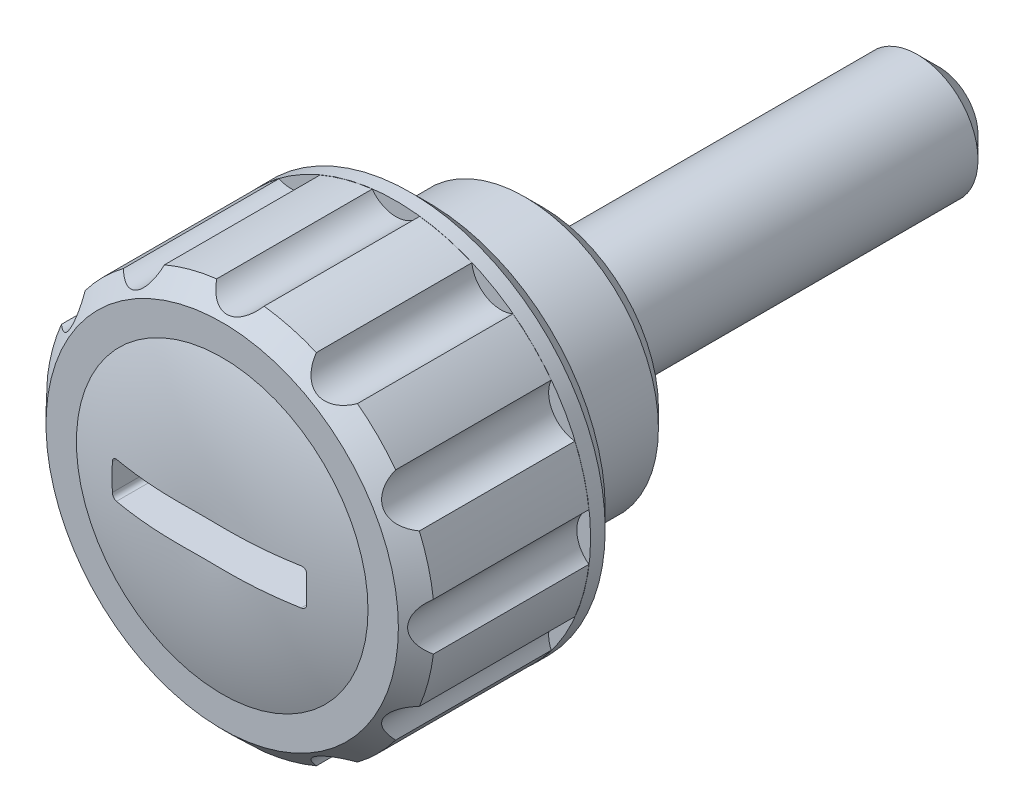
ISO-10303-21;
HEADER;
FILE_DESCRIPTION(('STEP AP214'),'2;1');
FILE_NAME('part.step','',(''),(''),'','','');
FILE_SCHEMA(('AUTOMOTIVE_DESIGN { 1 0 10303 214 1 1 1 1 }'));
ENDSEC;
DATA;
#1=APPLICATION_CONTEXT('core data for automotive mechanical design processes');
#2=APPLICATION_PROTOCOL_DEFINITION('international standard','automotive_design',2000,#1);
#3=PRODUCT_CONTEXT('',#1,'mechanical');
#4=PRODUCT('Part','Part','',(#3));
#5=PRODUCT_RELATED_PRODUCT_CATEGORY('part','',(#4));
#6=PRODUCT_DEFINITION_FORMATION('','',#4);
#7=PRODUCT_DEFINITION_CONTEXT('part definition',#1,'design');
#8=PRODUCT_DEFINITION('design','',#6,#7);
#9=PRODUCT_DEFINITION_SHAPE('','',#8);
#10=(LENGTH_UNIT() NAMED_UNIT(*) SI_UNIT(.MILLI.,.METRE.));
#11=(NAMED_UNIT(*) PLANE_ANGLE_UNIT() SI_UNIT($,.RADIAN.));
#12=(NAMED_UNIT(*) SI_UNIT($,.STERADIAN.) SOLID_ANGLE_UNIT());
#13=UNCERTAINTY_MEASURE_WITH_UNIT(LENGTH_MEASURE(1.E-05),#10,'distance_accuracy_value','');
#14=(GEOMETRIC_REPRESENTATION_CONTEXT(3) GLOBAL_UNCERTAINTY_ASSIGNED_CONTEXT((#13)) GLOBAL_UNIT_ASSIGNED_CONTEXT((#10,
#11,#12)) REPRESENTATION_CONTEXT('',''));
#15=CARTESIAN_POINT('',(0.,0.,0.));
#16=DIRECTION('',(0.,0.,1.));
#17=DIRECTION('',(1.,0.,0.));
#18=AXIS2_PLACEMENT_3D('',#15,#16,#17);
#19=CARTESIAN_POINT('',(0.,0.,-0.703698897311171));
#20=DIRECTION('',(0.,0.,1.));
#21=DIRECTION('',(1.,0.,0.));
#22=AXIS2_PLACEMENT_3D('',#19,#20,#21);
#23=DEGENERATE_TOROIDAL_SURFACE('',#22,1.1776626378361,15.,.T.);
#24=CARTESIAN_POINT('',(0.,0.,13.5));
#25=DIRECTION('',(0.,0.,1.));
#26=DIRECTION('',(1.,0.,0.));
#27=AXIS2_PLACEMENT_3D('',#24,#25,#26);
#28=CIRCLE('',#27,6.);
#29=CARTESIAN_POINT('',(6.,0.,13.5));
#30=VERTEX_POINT('',#29);
#31=EDGE_CURVE('E420',#30,#30,#28,.T.);
#32=ORIENTED_EDGE('',*,*,#31,.T.);
#33=EDGE_LOOP('',(#32));
#34=FACE_BOUND('',#33,.T.);
#35=CARTESIAN_POINT('',(-3.7998,-0.749999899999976,14.0521326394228));
#36=CARTESIAN_POINT('',(-3.81114880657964,-0.750020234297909,14.0500982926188));
#37=CARTESIAN_POINT('',(-3.82250108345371,-0.749057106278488,14.0480843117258));
#38=CARTESIAN_POINT('',(-3.84489426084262,-0.745224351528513,14.0441543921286));
#39=CARTESIAN_POINT('',(-3.85593522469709,-0.742355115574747,14.0422384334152));
#40=CARTESIAN_POINT('',(-3.87740011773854,-0.734767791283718,14.0385596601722));
#41=CARTESIAN_POINT('',(-3.88782359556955,-0.730048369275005,14.0367969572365));
#42=CARTESIAN_POINT('',(-3.90773653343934,-0.718887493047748,14.0334807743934));
#43=CARTESIAN_POINT('',(-3.91722631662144,-0.712446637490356,14.0319272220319));
#44=CARTESIAN_POINT('',(-3.93490505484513,-0.698084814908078,14.0290917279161));
#45=CARTESIAN_POINT('',(-3.9431055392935,-0.690178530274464,14.027807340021));
#46=CARTESIAN_POINT('',(-3.95806529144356,-0.673063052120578,14.025533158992));
#47=CARTESIAN_POINT('',(-3.96482436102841,-0.663853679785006,14.0245434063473));
#48=CARTESIAN_POINT('',(-3.97659283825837,-0.644555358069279,14.0229052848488));
#49=CARTESIAN_POINT('',(-3.98162854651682,-0.634482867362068,14.0222516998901));
#50=CARTESIAN_POINT('',(-3.98994131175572,-0.613624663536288,14.0212843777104));
#51=CARTESIAN_POINT('',(-3.99321964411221,-0.602839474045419,14.0209703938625));
#52=CARTESIAN_POINT('',(-3.99704991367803,-0.584948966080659,14.0207435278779));
#53=CARTESIAN_POINT('',(-3.99816189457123,-0.577959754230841,14.0207251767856));
#54=CARTESIAN_POINT('',(-3.99964030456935,-0.563913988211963,14.0208265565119));
#55=CARTESIAN_POINT('',(-4.00000779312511,-0.556857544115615,14.0209460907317));
#56=CARTESIAN_POINT('',(-3.9999999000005,-0.549800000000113,14.0211342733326));
#57=B_SPLINE_CURVE_WITH_KNOTS('',3,(#35,#36,#37,#38,#39,#40,#41,#42,#43,#44,#45,#46,#47,#48,#49,
#50,#51,#52,#53,#54,#55,#56),.UNSPECIFIED.,.F.,.F.,(4,2,2,2,2,2,2,2,2,2,4),(0.,
0.0345466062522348,0.0690861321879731,0.103650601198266,0.138203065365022,0.172426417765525,
0.206654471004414,0.240334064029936,0.273989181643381,0.295182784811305,0.316346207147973),.UNSPECIFIED.);
#58=CARTESIAN_POINT('',(-3.8,-0.75,14.0520967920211));
#59=VERTEX_POINT('',#58);
#60=CARTESIAN_POINT('',(-4.,-0.55,14.02112896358));
#61=VERTEX_POINT('',#60);
#62=EDGE_CURVE('E531',#59,#61,#57,.T.);
#63=ORIENTED_EDGE('',*,*,#62,.T.);
#64=CARTESIAN_POINT('',(-4.,0.,14.028388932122));
#65=CARTESIAN_POINT('',(-4.,0.339153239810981,14.0283961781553));
#66=CARTESIAN_POINT('',(-4.,0.678323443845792,14.0201840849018));
#67=CARTESIAN_POINT('',(-4.,1.35574448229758,13.9866878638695));
#68=CARTESIAN_POINT('',(-4.,1.69399552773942,13.9614080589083));
#69=CARTESIAN_POINT('',(-4.,2.36814839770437,13.8923714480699));
#70=CARTESIAN_POINT('',(-4.,2.7040529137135,13.8486414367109));
#71=CARTESIAN_POINT('',(-4.,3.37274568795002,13.7413643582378));
#72=CARTESIAN_POINT('',(-4.,3.70553346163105,13.6778142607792));
#73=CARTESIAN_POINT('',(-4.,4.45788889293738,13.5095576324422));
#74=CARTESIAN_POINT('',(-4.,4.87602372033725,13.3983308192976));
#75=CARTESIAN_POINT('',(-4.,5.70161656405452,13.1413580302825));
#76=CARTESIAN_POINT('',(-4.,6.10907328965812,12.9956079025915));
#77=CARTESIAN_POINT('',(-4.,6.91043852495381,12.6696375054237));
#78=CARTESIAN_POINT('',(-4.,7.30433371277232,12.4893844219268));
#79=CARTESIAN_POINT('',(-4.,8.07498519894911,12.0953512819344));
#80=CARTESIAN_POINT('',(-4.,8.45174183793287,11.8815718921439));
#81=CARTESIAN_POINT('',(-4.,9.18281763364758,11.4232419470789));
#82=CARTESIAN_POINT('',(-4.,9.53726091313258,11.1788894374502));
#83=CARTESIAN_POINT('',(-4.,10.2233955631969,10.6600773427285));
#84=CARTESIAN_POINT('',(-4.,10.5550867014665,10.3856174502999));
#85=CARTESIAN_POINT('',(-4.,11.1930381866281,9.8086212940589));
#86=CARTESIAN_POINT('',(-4.,11.4993002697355,9.50608695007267));
#87=CARTESIAN_POINT('',(-4.,12.0839658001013,8.87520844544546));
#88=CARTESIAN_POINT('',(-4.,12.3623701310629,8.54686510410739));
#89=CARTESIAN_POINT('',(-4.,12.8784698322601,7.8806109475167));
#90=CARTESIAN_POINT('',(-4.,13.1173543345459,7.54362037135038));
#91=CARTESIAN_POINT('',(-4.,13.5656684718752,6.85059247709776));
#92=CARTESIAN_POINT('',(-4.,13.7750989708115,6.49455571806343));
#93=CARTESIAN_POINT('',(-4.,14.1629376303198,5.76604322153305));
#94=CARTESIAN_POINT('',(-4.,14.3413507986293,5.39357014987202));
#95=CARTESIAN_POINT('',(-4.,14.6658865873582,4.63480988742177));
#96=CARTESIAN_POINT('',(-4.,14.8120091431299,4.24852266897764));
#97=CARTESIAN_POINT('',(-4.,15.0699099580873,3.46788913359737));
#98=CARTESIAN_POINT('',(-4.,15.1819394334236,3.07362578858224));
#99=CARTESIAN_POINT('',(-4.,15.3723250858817,2.2770527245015));
#100=CARTESIAN_POINT('',(-4.,15.4506814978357,1.87474306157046));
#101=CARTESIAN_POINT('',(-4.,15.5731575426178,1.06492658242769));
#102=CARTESIAN_POINT('',(-4.,15.617275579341,0.657419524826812));
#103=CARTESIAN_POINT('',(-4.,15.6709496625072,-0.159864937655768));
#104=CARTESIAN_POINT('',(-4.,15.6805056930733,-0.569642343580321));
#105=CARTESIAN_POINT('',(-4.,15.665001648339,-1.38774900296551));
#106=CARTESIAN_POINT('',(-4.,15.6400084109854,-1.7960795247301));
#107=CARTESIAN_POINT('',(-4.,15.5557048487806,-2.60918184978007));
#108=CARTESIAN_POINT('',(-4.,15.4963945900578,-3.01395365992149));
#109=CARTESIAN_POINT('',(-4.,15.3438918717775,-3.8170229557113));
#110=CARTESIAN_POINT('',(-4.,15.2507026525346,-4.21532105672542));
#111=CARTESIAN_POINT('',(-4.,15.0311128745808,-5.00265431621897));
#112=CARTESIAN_POINT('',(-4.,14.9047123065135,-5.39168947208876));
#113=CARTESIAN_POINT('',(-4.,14.619619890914,-6.15771427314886));
#114=CARTESIAN_POINT('',(-4.,14.4609300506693,-6.53470466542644));
#115=CARTESIAN_POINT('',(-4.,14.112398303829,-7.27399825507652));
#116=CARTESIAN_POINT('',(-4.,13.9225564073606,-7.63630145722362));
#117=CARTESIAN_POINT('',(-4.,13.5130367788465,-8.34375702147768));
#118=CARTESIAN_POINT('',(-4.,13.2933514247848,-8.68890497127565));
#119=CARTESIAN_POINT('',(-4.,12.825767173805,-9.35952806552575));
#120=CARTESIAN_POINT('',(-4.,12.5778682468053,-9.68500318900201));
#121=CARTESIAN_POINT('',(-4.,12.0550681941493,-10.3147088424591));
#122=CARTESIAN_POINT('',(-4.,11.7801085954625,-10.6188908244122));
#123=CARTESIAN_POINT('',(-4.,11.2056412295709,-11.2031141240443));
#124=CARTESIAN_POINT('',(-4.,10.9061334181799,-11.4831553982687));
#125=CARTESIAN_POINT('',(-4.,10.2849635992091,-12.0170071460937));
#126=CARTESIAN_POINT('',(-4.,9.96331753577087,-12.2708361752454));
#127=CARTESIAN_POINT('',(-4.,9.30001359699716,-12.7508263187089));
#128=CARTESIAN_POINT('',(-4.,8.95835585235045,-12.9769876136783));
#129=CARTESIAN_POINT('',(-4.,8.25506085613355,-13.4017235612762));
#130=CARTESIAN_POINT('',(-4.,7.89330122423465,-13.6000955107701));
#131=CARTESIAN_POINT('',(-4.,7.1546361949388,-13.9662854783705));
#132=CARTESIAN_POINT('',(-4.,6.77773047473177,-14.1341028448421));
#133=CARTESIAN_POINT('',(-4.,6.01113338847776,-14.4386630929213));
#134=CARTESIAN_POINT('',(-4.,5.62142902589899,-14.5753731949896));
#135=CARTESIAN_POINT('',(-4.,4.83241304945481,-14.817363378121));
#136=CARTESIAN_POINT('',(-4.,4.4331021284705,-14.9226457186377));
#137=CARTESIAN_POINT('',(-4.,3.77164652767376,-15.0703302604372));
#138=CARTESIAN_POINT('',(-4.,3.51147362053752,-15.1217585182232));
#139=CARTESIAN_POINT('',(-4.,2.98899804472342,-15.2123395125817));
#140=CARTESIAN_POINT('',(-4.,2.7266952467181,-15.2514914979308));
#141=CARTESIAN_POINT('',(-4.,1.93724201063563,-15.3514509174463));
#142=CARTESIAN_POINT('',(-4.,1.40777675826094,-15.3947116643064));
#143=CARTESIAN_POINT('',(-4.,0.612198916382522,-15.4285188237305));
#144=CARTESIAN_POINT('',(-4.,0.346571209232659,-15.4345998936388));
#145=CARTESIAN_POINT('',(-4.,-0.184756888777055,-15.4366600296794));
#146=CARTESIAN_POINT('',(-4.,-0.450457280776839,-15.4326389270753));
#147=CARTESIAN_POINT('',(-4.,-0.981374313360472,-15.4142959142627));
#148=CARTESIAN_POINT('',(-4.,-1.24659112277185,-15.3999788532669));
#149=CARTESIAN_POINT('',(-4.,-1.7762314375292,-15.3604541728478));
#150=CARTESIAN_POINT('',(-4.,-2.04065492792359,-15.3352463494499));
#151=CARTESIAN_POINT('',(-4.,-2.52470132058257,-15.2783376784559));
#152=CARTESIAN_POINT('',(-4.,-2.74453002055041,-15.248390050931));
#153=CARTESIAN_POINT('',(-4.,-3.18285214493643,-15.1800456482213));
#154=CARTESIAN_POINT('',(-4.,-3.40134562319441,-15.1416492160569));
#155=CARTESIAN_POINT('',(-4.,-4.05419633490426,-15.0133381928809));
#156=CARTESIAN_POINT('',(-4.,-4.48606739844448,-14.9102854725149));
#157=CARTESIAN_POINT('',(-4.,-5.33835432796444,-14.6682914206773));
#158=CARTESIAN_POINT('',(-4.,-5.75879820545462,-14.5294486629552));
#159=CARTESIAN_POINT('',(-4.,-6.58609234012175,-14.2156839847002));
#160=CARTESIAN_POINT('',(-4.,-6.99294114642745,-14.0407582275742));
#161=CARTESIAN_POINT('',(-4.,-7.79138450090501,-13.6547019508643));
#162=CARTESIAN_POINT('',(-4.,-8.18290123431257,-13.4434103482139));
#163=CARTESIAN_POINT('',(-4.,-8.94537896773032,-12.9865110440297));
#164=CARTESIAN_POINT('',(-4.,-9.31634014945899,-12.7409036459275));
#165=CARTESIAN_POINT('',(-4.,-10.0350527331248,-12.2167860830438));
#166=CARTESIAN_POINT('',(-4.,-10.3827705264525,-11.9382298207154));
#167=CARTESIAN_POINT('',(-4.,-11.0514362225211,-11.350662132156));
#168=CARTESIAN_POINT('',(-4.,-11.3723853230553,-11.0416520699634));
#169=CARTESIAN_POINT('',(-4.,-11.9642331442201,-10.4173353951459));
#170=CARTESIAN_POINT('',(-4.,-12.2370447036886,-10.1038391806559));
#171=CARTESIAN_POINT('',(-4.,-12.7549508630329,-9.4547474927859));
#172=CARTESIAN_POINT('',(-4.,-13.0000469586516,-9.11915321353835));
#173=CARTESIAN_POINT('',(-4.,-13.4605522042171,-8.42850547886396));
#174=CARTESIAN_POINT('',(-4.,-13.67598107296,-8.07346517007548));
#175=CARTESIAN_POINT('',(-4.,-14.0757477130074,-7.34628666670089));
#176=CARTESIAN_POINT('',(-4.,-14.2600853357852,-6.97414839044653));
#177=CARTESIAN_POINT('',(-4.,-14.5943069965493,-6.21997693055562));
#178=CARTESIAN_POINT('',(-4.,-14.7445728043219,-5.83811287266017));
#179=CARTESIAN_POINT('',(-4.,-15.0123145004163,-5.06306047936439));
#180=CARTESIAN_POINT('',(-4.,-15.1297907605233,-4.669872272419));
#181=CARTESIAN_POINT('',(-4.,-15.3311166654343,-3.87492033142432));
#182=CARTESIAN_POINT('',(-4.,-15.4149615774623,-3.47315539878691));
#183=CARTESIAN_POINT('',(-4.,-15.5483930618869,-2.66397544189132));
#184=CARTESIAN_POINT('',(-4.,-15.5979796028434,-2.25656041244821));
#185=CARTESIAN_POINT('',(-4.,-15.6624394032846,-1.44020146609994));
#186=CARTESIAN_POINT('',(-4.,-15.6774144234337,-1.03126558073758));
#187=CARTESIAN_POINT('',(-4.,-15.6728420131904,-0.213587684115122));
#188=CARTESIAN_POINT('',(-4.,-15.653294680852,0.19515432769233));
#189=CARTESIAN_POINT('',(-4.,-15.5798200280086,1.00952109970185));
#190=CARTESIAN_POINT('',(-4.,-15.5258939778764,1.41514597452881));
#191=CARTESIAN_POINT('',(-4.,-15.3840519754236,2.22040863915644));
#192=CARTESIAN_POINT('',(-4.,-15.2961360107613,2.62004642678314));
#193=CARTESIAN_POINT('',(-4.,-15.0869932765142,3.41032437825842));
#194=CARTESIAN_POINT('',(-4.,-14.9657808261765,3.8009683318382));
#195=CARTESIAN_POINT('',(-4.,-14.6909025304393,4.57066557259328));
#196=CARTESIAN_POINT('',(-4.,-14.5372367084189,4.94971886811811));
#197=CARTESIAN_POINT('',(-4.,-14.198563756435,5.6935427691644));
#198=CARTESIAN_POINT('',(-4.,-14.0135574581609,6.05831375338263));
#199=CARTESIAN_POINT('',(-4.,-13.6135344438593,6.77101064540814));
#200=CARTESIAN_POINT('',(-4.,-13.3985177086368,7.11893654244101));
#201=CARTESIAN_POINT('',(-4.,-12.9397392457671,7.79592064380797));
#202=CARTESIAN_POINT('',(-4.,-12.695942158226,8.12495488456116));
#203=CARTESIAN_POINT('',(-4.,-12.1815798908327,8.76138756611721));
#204=CARTESIAN_POINT('',(-4.,-11.91101469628,9.068785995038));
#205=CARTESIAN_POINT('',(-4.,-11.3450384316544,9.65985804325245));
#206=CARTESIAN_POINT('',(-4.,-11.049624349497,9.94352877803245));
#207=CARTESIAN_POINT('',(-4.,-10.4361166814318,10.4851767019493));
#208=CARTESIAN_POINT('',(-4.,-10.1180230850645,10.7431538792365));
#209=CARTESIAN_POINT('',(-4.,-9.45975657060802,11.2329803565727));
#210=CARTESIAN_POINT('',(-4.,-9.11947790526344,11.4646875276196));
#211=CARTESIAN_POINT('',(-4.,-8.42081797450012,11.8989645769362));
#212=CARTESIAN_POINT('',(-4.,-8.06243669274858,12.1015344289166));
#213=CARTESIAN_POINT('',(-4.,-7.33043234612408,12.476268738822));
#214=CARTESIAN_POINT('',(-4.,-6.95681985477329,12.6484538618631));
#215=CARTESIAN_POINT('',(-4.,-6.19684574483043,12.961845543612));
#216=CARTESIAN_POINT('',(-4.,-5.81048403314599,13.1030518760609));
#217=CARTESIAN_POINT('',(-4.,-4.98307663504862,13.3686004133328));
#218=CARTESIAN_POINT('',(-4.,-4.54082134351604,13.4891802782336));
#219=CARTESIAN_POINT('',(-4.,-3.64769934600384,13.6923551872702));
#220=CARTESIAN_POINT('',(-4.,-3.19683149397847,13.774945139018));
#221=CARTESIAN_POINT('',(-4.,-2.28933102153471,13.9045907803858));
#222=CARTESIAN_POINT('',(-4.,-1.83269032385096,13.9515893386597));
#223=CARTESIAN_POINT('',(-4.,-1.14623014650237,13.9979727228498));
#224=CARTESIAN_POINT('',(-4.,-0.917138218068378,14.0094147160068));
#225=CARTESIAN_POINT('',(-4.,-0.458700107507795,14.0246202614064));
#226=CARTESIAN_POINT('',(-4.,-0.229353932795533,14.0283840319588));
#227=CARTESIAN_POINT('',(-4.,0.,14.028388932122));
#228=B_SPLINE_CURVE_WITH_KNOTS('',3,(#64,#65,#66,#67,#68,#69,#70,#71,#72,#73,#74,#75,#76,#77,
#78,#79,#80,#81,#82,#83,#84,#85,#86,#87,#88,#89,#90,#91,#92,#93,#94,#95,#96,#97,#98,#99,#100,
#101,#102,#103,#104,#105,#106,#107,#108,#109,#110,#111,#112,#113,#114,#115,#116,#117,#118,#119,
#120,#121,#122,#123,#124,#125,#126,#127,#128,#129,#130,#131,#132,#133,#134,#135,#136,#137,#138,
#139,#140,#141,#142,#143,#144,#145,#146,#147,#148,#149,#150,#151,#152,#153,#154,#155,#156,#157,
#158,#159,#160,#161,#162,#163,#164,#165,#166,#167,#168,#169,#170,#171,#172,#173,#174,#175,#176,
#177,#178,#179,#180,#181,#182,#183,#184,#185,#186,#187,#188,#189,#190,#191,#192,#193,#194,#195,
#196,#197,#198,#199,#200,#201,#202,#203,#204,#205,#206,#207,#208,#209,#210,#211,#212,#213,#214,
#215,#216,#217,#218,#219,#220,#221,#222,#223,#224,#225,#226,#227),.UNSPECIFIED.,.T.,.F.,(4,2,2,
2,2,2,2,2,2,2,2,2,2,2,2,2,2,2,2,2,2,2,2,2,2,2,2,2,2,2,2,2,2,2,2,2,2,2,2,2,2,2,2,2,2,2,2,2,2,2,2,
2,2,2,2,2,2,2,2,2,2,2,2,2,2,2,2,2,2,2,2,2,2,2,2,2,2,2,2,2,2,4),(0.,1.01738294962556,
2.03450831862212,3.05016161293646,4.06597026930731,5.36249424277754,6.6591742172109,
7.95709358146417,9.25498713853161,10.5448707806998,11.8347675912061,13.1245762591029,
14.4143439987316,15.6520836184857,16.8897869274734,18.1272902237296,19.3647959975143,
20.5929491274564,21.8210936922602,23.0492955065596,24.2774978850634,25.5033275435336,
26.7291548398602,27.9548649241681,29.1805753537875,30.4062096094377,31.6318434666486,
32.8577909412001,34.0837397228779,35.3123982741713,36.5410590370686,37.7688439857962,
38.9966209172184,40.2329329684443,41.4692713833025,42.7069066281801,43.9444528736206,
44.7397910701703,45.5351779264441,47.1266553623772,47.9236225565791,48.7206030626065,
49.5172084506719,50.3138287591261,50.9792441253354,51.6446324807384,52.9749769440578,
54.301695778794,55.6285557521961,56.9614518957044,58.2943362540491,59.6291079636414,
60.9638199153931,62.2090674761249,63.4542478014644,64.6985964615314,65.9429510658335,
67.1725857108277,68.4022064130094,69.6320000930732,70.8617949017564,72.0879693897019,
73.3141403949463,74.5402660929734,75.7663922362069,76.9919919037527,78.2175906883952,
79.4431569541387,80.6687240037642,81.8958127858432,83.1229022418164,84.3501406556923,
85.5773796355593,86.8109699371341,88.0445613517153,89.2773105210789,90.510068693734,
91.8834796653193,93.2570746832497,94.632869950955,95.3208993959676,96.0089092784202),.UNSPECIFIED.);
#229=CARTESIAN_POINT('',(-4.,0.55,14.02112896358));
#230=VERTEX_POINT('',#229);
#231=EDGE_CURVE('E230',#61,#230,#228,.T.);
#232=ORIENTED_EDGE('',*,*,#231,.T.);
#233=CARTESIAN_POINT('',(-3.99999989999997,0.5498,14.0211342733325));
#234=CARTESIAN_POINT('',(-4.00002120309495,0.560882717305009,14.0208370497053));
#235=CARTESIAN_POINT('',(-3.99910147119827,0.571967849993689,14.0207119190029));
#236=CARTESIAN_POINT('',(-3.99545102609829,0.59382219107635,14.0208010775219));
#237=CARTESIAN_POINT('',(-3.99272233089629,0.604591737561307,14.021014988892));
#238=CARTESIAN_POINT('',(-3.98552323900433,0.625524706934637,14.0217769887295));
#239=CARTESIAN_POINT('',(-3.98105209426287,0.635687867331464,14.0223252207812));
#240=CARTESIAN_POINT('',(-3.97050578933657,0.655118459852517,14.0237373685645));
#241=CARTESIAN_POINT('',(-3.96443078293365,0.664385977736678,14.0246012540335));
#242=CARTESIAN_POINT('',(-3.95082544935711,0.681812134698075,14.0266217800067));
#243=CARTESIAN_POINT('',(-3.94328885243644,0.689965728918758,14.0277796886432));
#244=CARTESIAN_POINT('',(-3.92699598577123,0.704900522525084,14.030350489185));
#245=CARTESIAN_POINT('',(-3.91823946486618,0.711681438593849,14.0317634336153));
#246=CARTESIAN_POINT('',(-3.89962640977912,0.723780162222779,14.0348229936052));
#247=CARTESIAN_POINT('',(-3.88975612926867,0.729076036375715,14.0364726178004));
#248=CARTESIAN_POINT('',(-3.86929754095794,0.737941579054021,14.0399411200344));
#249=CARTESIAN_POINT('',(-3.858709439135,0.741511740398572,14.0417599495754));
#250=CARTESIAN_POINT('',(-3.84003688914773,0.746119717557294,14.0450054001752));
#251=CARTESIAN_POINT('',(-3.83204943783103,0.747581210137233,14.046405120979));
#252=CARTESIAN_POINT('',(-3.8159747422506,0.749525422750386,14.0492439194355));
#253=CARTESIAN_POINT('',(-3.80788765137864,0.750009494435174,14.0506829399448));
#254=CARTESIAN_POINT('',(-3.79980000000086,0.749999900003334,14.052132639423));
#255=B_SPLINE_CURVE_WITH_KNOTS('',3,(#233,#234,#235,#236,#237,#238,#239,#240,#241,#242,#243,
#244,#245,#246,#247,#248,#249,#250,#251,#252,#253,#254),.UNSPECIFIED.,.F.,.F.,(4,2,2,2,2,2,2,2,
2,2,4),(0.,0.0332152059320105,0.0663934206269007,0.0995858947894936,0.132775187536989,
0.166110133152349,0.199451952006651,0.233262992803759,0.267064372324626,0.291727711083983,
0.316356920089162),.UNSPECIFIED.);
#256=CARTESIAN_POINT('',(-3.79999999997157,0.75,14.0520967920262));
#257=VERTEX_POINT('',#256);
#258=EDGE_CURVE('E485',#230,#257,#255,.T.);
#259=ORIENTED_EDGE('',*,*,#258,.T.);
#260=CARTESIAN_POINT('',(0.,0.75,14.2902033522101));
#261=CARTESIAN_POINT('',(0.062509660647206,0.75,14.2902036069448));
#262=CARTESIAN_POINT('',(0.125019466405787,0.75,14.2904360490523));
#263=CARTESIAN_POINT('',(0.250036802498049,0.75,14.291252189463));
#264=CARTESIAN_POINT('',(0.312544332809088,0.75,14.2918358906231));
#265=CARTESIAN_POINT('',(0.437565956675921,0.75,14.2930988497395));
#266=CARTESIAN_POINT('',(0.500080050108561,0.75,14.2937781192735));
#267=CARTESIAN_POINT('',(0.625113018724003,0.75,14.2949804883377));
#268=CARTESIAN_POINT('',(0.687631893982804,0.75,14.2955035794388));
#269=CARTESIAN_POINT('',(0.875766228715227,0.75,14.2965328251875));
#270=CARTESIAN_POINT('',(1.00138686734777,0.75,14.2964891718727));
#271=CARTESIAN_POINT('',(1.25260493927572,0.75,14.2940460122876));
#272=CARTESIAN_POINT('',(1.37820237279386,0.75,14.2916465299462));
#273=CARTESIAN_POINT('',(1.75485708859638,0.75,14.2803277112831));
#274=CARTESIAN_POINT('',(2.00580900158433,0.75,14.2672884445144));
#275=CARTESIAN_POINT('',(2.50689880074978,0.75,14.2291477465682));
#276=CARTESIAN_POINT('',(2.75703633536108,0.75,14.2040416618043));
#277=CARTESIAN_POINT('',(3.25583549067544,0.75,14.1415504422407));
#278=CARTESIAN_POINT('',(3.5044966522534,0.75,14.1041616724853));
#279=CARTESIAN_POINT('',(4.16871083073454,0.75,13.9873107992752));
#280=CARTESIAN_POINT('',(4.58233519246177,0.75,13.8965497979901));
#281=CARTESIAN_POINT('',(5.40052634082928,0.75,13.6805066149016));
#282=CARTESIAN_POINT('',(5.80509101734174,0.75,13.5552164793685));
#283=CARTESIAN_POINT('',(6.60293944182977,0.75,13.2706758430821));
#284=CARTESIAN_POINT('',(6.99620137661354,0.75,13.1113641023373));
#285=CARTESIAN_POINT('',(7.76780860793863,0.75,12.760031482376));
#286=CARTESIAN_POINT('',(8.14615456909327,0.75,12.5680120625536));
#287=CARTESIAN_POINT('',(8.88446706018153,0.75,12.1530468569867));
#288=CARTESIAN_POINT('',(9.2444697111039,0.75,11.9301653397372));
#289=CARTESIAN_POINT('',(9.9443450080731,0.75,11.4547620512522));
#290=CARTESIAN_POINT('',(10.2842175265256,0.75,11.2022400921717));
#291=CARTESIAN_POINT('',(10.9411846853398,0.75,10.6695279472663));
#292=CARTESIAN_POINT('',(11.2582935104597,0.75,10.3893552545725));
#293=CARTESIAN_POINT('',(11.867695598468,0.75,9.80321084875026));
#294=CARTESIAN_POINT('',(12.1599889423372,0.75,9.49723921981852));
#295=CARTESIAN_POINT('',(12.7167806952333,0.75,8.86269415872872));
#296=CARTESIAN_POINT('',(12.9813643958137,0.75,8.53419556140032));
#297=CARTESIAN_POINT('',(13.4819097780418,0.75,7.85607214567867));
#298=CARTESIAN_POINT('',(13.7178715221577,0.75,7.50644737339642));
#299=CARTESIAN_POINT('',(14.1595322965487,0.75,6.78849443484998));
#300=CARTESIAN_POINT('',(14.3652260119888,0.75,6.42016299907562));
#301=CARTESIAN_POINT('',(14.7448367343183,0.75,5.66747355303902));
#302=CARTESIAN_POINT('',(14.9187537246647,0.75,5.28311553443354));
#303=CARTESIAN_POINT('',(15.2335050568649,0.75,4.50127546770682));
#304=CARTESIAN_POINT('',(15.3743535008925,0.75,4.10379909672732));
#305=CARTESIAN_POINT('',(15.6220611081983,0.75,3.29839291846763));
#306=CARTESIAN_POINT('',(15.7289202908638,0.75,2.89046311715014));
#307=CARTESIAN_POINT('',(15.9078821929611,0.75,2.06708280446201));
#308=CARTESIAN_POINT('',(15.9799876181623,0.75,1.65163288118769));
#309=CARTESIAN_POINT('',(16.0889414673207,0.75,0.816135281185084));
#310=CARTESIAN_POINT('',(16.1257898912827,0.75,0.396087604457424));
#311=CARTESIAN_POINT('',(16.163965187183,0.75,-0.445565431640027));
#312=CARTESIAN_POINT('',(16.1652965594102,0.75,-0.867170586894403));
#313=CARTESIAN_POINT('',(16.1324397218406,0.75,-1.7089944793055));
#314=CARTESIAN_POINT('',(16.0982515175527,0.75,-2.12921321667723));
#315=CARTESIAN_POINT('',(15.994590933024,0.75,-2.96533956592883));
#316=CARTESIAN_POINT('',(15.9251132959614,0.75,-3.38124652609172));
#317=CARTESIAN_POINT('',(15.751365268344,0.75,-4.20572862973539));
#318=CARTESIAN_POINT('',(15.6470948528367,0.75,-4.61430376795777));
#319=CARTESIAN_POINT('',(15.4044819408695,0.75,-5.42128714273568));
#320=CARTESIAN_POINT('',(15.2661335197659,0.75,-5.8196935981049));
#321=CARTESIAN_POINT('',(14.9563586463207,0.75,-6.6034316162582));
#322=CARTESIAN_POINT('',(14.7849322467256,0.75,-6.9887631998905));
#323=CARTESIAN_POINT('',(14.410318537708,0.75,-7.74341593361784));
#324=CARTESIAN_POINT('',(14.2071477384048,0.75,-8.11274527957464));
#325=CARTESIAN_POINT('',(13.7704245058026,0.75,-8.83298393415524));
#326=CARTESIAN_POINT('',(13.5368719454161,0.75,-9.18389316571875));
#327=CARTESIAN_POINT('',(13.0411762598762,0.75,-9.86461934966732));
#328=CARTESIAN_POINT('',(12.7790481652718,0.75,-10.1944472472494));
#329=CARTESIAN_POINT('',(12.2279683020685,0.75,-10.8308662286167));
#330=CARTESIAN_POINT('',(11.9390170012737,0.75,-11.1374577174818));
#331=CARTESIAN_POINT('',(11.3358371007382,0.75,-11.7257264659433));
#332=CARTESIAN_POINT('',(11.0215672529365,0.75,-12.0073614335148));
#333=CARTESIAN_POINT('',(10.3703891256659,0.75,-12.5431585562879));
#334=CARTESIAN_POINT('',(10.0334794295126,0.75,-12.7973189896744));
#335=CARTESIAN_POINT('',(9.33882156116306,0.75,-13.2767706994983));
#336=CARTESIAN_POINT('',(8.98103735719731,0.75,-13.5020097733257));
#337=CARTESIAN_POINT('',(8.24780759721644,0.75,-13.9214489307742));
#338=CARTESIAN_POINT('',(7.87236542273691,0.75,-14.1156549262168));
#339=CARTESIAN_POINT('',(7.10830459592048,0.75,-14.4708441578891));
#340=CARTESIAN_POINT('',(6.71975907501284,0.75,-14.6319846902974));
#341=CARTESIAN_POINT('',(5.93032689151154,0.75,-14.9212008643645));
#342=CARTESIAN_POINT('',(5.52943355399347,0.75,-15.049258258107));
#343=CARTESIAN_POINT('',(4.71037120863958,0.75,-15.2735305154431));
#344=CARTESIAN_POINT('',(4.29201779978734,0.75,-15.3690765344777));
#345=CARTESIAN_POINT('',(3.65997311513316,0.75,-15.485449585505));
#346=CARTESIAN_POINT('',(3.44867138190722,0.75,-15.5197366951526));
#347=CARTESIAN_POINT('',(3.02478880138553,0.75,-15.5793924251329));
#348=CARTESIAN_POINT('',(2.81220789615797,0.75,-15.6047606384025));
#349=CARTESIAN_POINT('',(2.38452719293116,0.75,-15.6468286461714));
#350=CARTESIAN_POINT('',(2.16942066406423,0.75,-15.6634594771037));
#351=CARTESIAN_POINT('',(1.73875062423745,0.75,-15.6880212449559));
#352=CARTESIAN_POINT('',(1.5231871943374,0.75,-15.6959536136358));
#353=CARTESIAN_POINT('',(1.19954465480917,0.75,-15.7021388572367));
#354=CARTESIAN_POINT('',(1.09150789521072,0.75,-15.7032466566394));
#355=CARTESIAN_POINT('',(0.875426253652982,0.75,-15.7039178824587));
#356=CARTESIAN_POINT('',(0.767381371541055,0.75,-15.7034812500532));
#357=CARTESIAN_POINT('',(0.551281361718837,0.75,-15.7017790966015));
#358=CARTESIAN_POINT('',(0.443226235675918,0.75,-15.7005134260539));
#359=CARTESIAN_POINT('',(0.281143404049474,0.75,-15.6989476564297));
#360=CARTESIAN_POINT('',(0.227117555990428,0.75,-15.698481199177));
#361=CARTESIAN_POINT('',(0.119064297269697,0.75,-15.6978197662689));
#362=CARTESIAN_POINT('',(0.0650368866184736,0.75,-15.6976247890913));
#363=CARTESIAN_POINT('',(-0.05800398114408,0.75,-15.6975761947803));
#364=CARTESIAN_POINT('',(-0.127017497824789,0.75,-15.6978322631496));
#365=CARTESIAN_POINT('',(-0.265042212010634,0.75,-15.6987649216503));
#366=CARTESIAN_POINT('',(-0.334053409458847,0.75,-15.6994415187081));
#367=CARTESIAN_POINT('',(-0.47207998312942,0.75,-15.7008610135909));
#368=CARTESIAN_POINT('',(-0.541095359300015,0.75,-15.7016039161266));
#369=CARTESIAN_POINT('',(-0.679127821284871,0.75,-15.7028300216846));
#370=CARTESIAN_POINT('',(-0.748144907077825,0.75,-15.7033132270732));
#371=CARTESIAN_POINT('',(-0.955164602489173,0.75,-15.7040009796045));
#372=CARTESIAN_POINT('',(-1.0931724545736,0.75,-15.7034443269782));
#373=CARTESIAN_POINT('',(-1.36914222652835,0.75,-15.6993084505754));
#374=CARTESIAN_POINT('',(-1.50710414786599,0.75,-15.6957293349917));
#375=CARTESIAN_POINT('',(-1.78256534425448,0.75,-15.685188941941));
#376=CARTESIAN_POINT('',(-1.92006492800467,0.75,-15.6782359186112));
#377=CARTESIAN_POINT('',(-2.19483905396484,0.75,-15.6607772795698));
#378=CARTESIAN_POINT('',(-2.33211359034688,0.75,-15.6502715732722));
#379=CARTESIAN_POINT('',(-2.743559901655,0.75,-15.6132836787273));
#380=CARTESIAN_POINT('',(-3.01726339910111,0.75,-15.581334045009));
#381=CARTESIAN_POINT('',(-3.55992465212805,0.75,-15.5030144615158));
#382=CARTESIAN_POINT('',(-3.82890277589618,0.75,-15.4567848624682));
#383=CARTESIAN_POINT('',(-4.36392755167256,0.75,-15.3498484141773));
#384=CARTESIAN_POINT('',(-4.62997463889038,0.75,-15.2891437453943));
#385=CARTESIAN_POINT('',(-5.15895710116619,0.75,-15.1532282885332));
#386=CARTESIAN_POINT('',(-5.42188447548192,0.75,-15.0779863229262));
#387=CARTESIAN_POINT('',(-5.94322863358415,0.75,-14.9132881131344));
#388=CARTESIAN_POINT('',(-6.20164546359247,0.75,-14.8238320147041));
#389=CARTESIAN_POINT('',(-6.85115229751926,0.75,-14.5789290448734));
#390=CARTESIAN_POINT('',(-7.23867684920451,0.75,-14.4139021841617));
#391=CARTESIAN_POINT('',(-7.99805018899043,0.75,-14.0520702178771));
#392=CARTESIAN_POINT('',(-8.36991500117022,0.75,-13.8552986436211));
#393=CARTESIAN_POINT('',(-9.09777056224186,0.75,-13.4300705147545));
#394=CARTESIAN_POINT('',(-9.45366504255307,0.75,-13.2014490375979));
#395=CARTESIAN_POINT('',(-10.1449857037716,0.75,-12.714880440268));
#396=CARTESIAN_POINT('',(-10.4804049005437,0.75,-12.4569233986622));
#397=CARTESIAN_POINT('',(-11.1277254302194,0.75,-11.9140206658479));
#398=CARTESIAN_POINT('',(-11.4396635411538,0.75,-11.6291188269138));
#399=CARTESIAN_POINT('',(-12.0383542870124,0.75,-11.0340393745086));
#400=CARTESIAN_POINT('',(-12.3251095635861,0.75,-10.7238644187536));
#401=CARTESIAN_POINT('',(-12.870898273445,0.75,-10.0810426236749));
#402=CARTESIAN_POINT('',(-13.1299839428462,0.75,-9.74844013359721));
#403=CARTESIAN_POINT('',(-13.619228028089,0.75,-9.06258526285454));
#404=CARTESIAN_POINT('',(-13.8493856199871,0.75,-8.70933229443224));
#405=CARTESIAN_POINT('',(-14.2791137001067,0.75,-7.98471878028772));
#406=CARTESIAN_POINT('',(-14.4786861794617,0.75,-7.61335941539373));
#407=CARTESIAN_POINT('',(-14.8458413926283,0.75,-6.85515348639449));
#408=CARTESIAN_POINT('',(-15.0134243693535,0.75,-6.46830703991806));
#409=CARTESIAN_POINT('',(-15.3155070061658,0.75,-5.6816225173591));
#410=CARTESIAN_POINT('',(-15.4499855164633,0.75,-5.2817763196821));
#411=CARTESIAN_POINT('',(-15.6847633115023,0.75,-4.47217121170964));
#412=CARTESIAN_POINT('',(-15.7850625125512,0.75,-4.06241227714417));
#413=CARTESIAN_POINT('',(-15.9507352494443,0.75,-3.23605764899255));
#414=CARTESIAN_POINT('',(-16.0161221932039,0.75,-2.81946464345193));
#415=CARTESIAN_POINT('',(-16.1115638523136,0.75,-1.98225120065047));
#416=CARTESIAN_POINT('',(-16.1416186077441,0.75,-1.56163076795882));
#417=CARTESIAN_POINT('',(-16.1661796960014,0.75,-0.719438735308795));
#418=CARTESIAN_POINT('',(-16.1606932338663,0.75,-0.297867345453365));
#419=CARTESIAN_POINT('',(-16.114227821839,0.75,0.543314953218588));
#420=CARTESIAN_POINT('',(-16.0732488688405,0.75,0.962925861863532));
#421=CARTESIAN_POINT('',(-15.9560905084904,0.75,1.79720001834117));
#422=CARTESIAN_POINT('',(-15.8799114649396,0.75,2.21186331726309));
#423=CARTESIAN_POINT('',(-15.6928948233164,0.75,3.03329916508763));
#424=CARTESIAN_POINT('',(-15.582057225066,0.75,3.44007171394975));
#425=CARTESIAN_POINT('',(-15.3264932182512,0.75,4.24289288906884));
#426=CARTESIAN_POINT('',(-15.181761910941,0.75,4.63893995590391));
#427=CARTESIAN_POINT('',(-14.8594487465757,0.75,5.41743335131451));
#428=CARTESIAN_POINT('',(-14.68186687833,0.75,5.79987967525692));
#429=CARTESIAN_POINT('',(-14.2950896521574,0.75,6.54850360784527));
#430=CARTESIAN_POINT('',(-14.0858900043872,0.75,6.91467900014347));
#431=CARTESIAN_POINT('',(-13.6373836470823,0.75,7.62810226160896));
#432=CARTESIAN_POINT('',(-13.3980769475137,0.75,7.97535013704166));
#433=CARTESIAN_POINT('',(-12.8911539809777,0.75,8.64832469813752));
#434=CARTESIAN_POINT('',(-12.6235482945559,0.75,8.97405935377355));
#435=CARTESIAN_POINT('',(-12.0618570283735,0.75,9.60183607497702));
#436=CARTESIAN_POINT('',(-11.767771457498,0.75,9.9038781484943));
#437=CARTESIAN_POINT('',(-11.1552973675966,0.75,10.4820455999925));
#438=CARTESIAN_POINT('',(-10.8369156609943,0.75,10.758178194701));
#439=CARTESIAN_POINT('',(-10.1780402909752,0.75,11.2826657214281));
#440=CARTESIAN_POINT('',(-9.83754661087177,0.75,11.5310206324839));
#441=CARTESIAN_POINT('',(-9.13645925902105,0.75,11.9984683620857));
#442=CARTESIAN_POINT('',(-8.775842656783,0.75,12.2175267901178));
#443=CARTESIAN_POINT('',(-8.03744530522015,0.75,12.6244922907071));
#444=CARTESIAN_POINT('',(-7.65966465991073,0.75,12.8123995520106));
#445=CARTESIAN_POINT('',(-6.88907462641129,0.75,13.1559939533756));
#446=CARTESIAN_POINT('',(-6.49624456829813,0.75,13.3116347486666));
#447=CARTESIAN_POINT('',(-5.69887180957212,0.75,13.589295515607));
#448=CARTESIAN_POINT('',(-5.29432853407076,0.75,13.7113138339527));
#449=CARTESIAN_POINT('',(-4.47763909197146,0.75,13.9206164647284));
#450=CARTESIAN_POINT('',(-4.06552036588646,0.75,14.0080072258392));
#451=CARTESIAN_POINT('',(-3.44313498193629,0.75,14.1131515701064));
#452=CARTESIAN_POINT('',(-3.2349769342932,0.75,14.1438756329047));
#453=CARTESIAN_POINT('',(-2.81757605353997,0.75,14.1967187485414));
#454=CARTESIAN_POINT('',(-2.60833331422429,0.75,14.2188385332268));
#455=CARTESIAN_POINT('',(-2.19967651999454,0.75,14.2537079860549));
#456=CARTESIAN_POINT('',(-2.00029743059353,0.75,14.2668729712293));
#457=CARTESIAN_POINT('',(-1.60124974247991,0.75,14.2858621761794));
#458=CARTESIAN_POINT('',(-1.40158124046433,0.75,14.291688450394));
#459=CARTESIAN_POINT('',(-1.10202038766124,0.75,14.2957506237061));
#460=CARTESIAN_POINT('',(-1.00214989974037,0.75,14.2963250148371));
#461=CARTESIAN_POINT('',(-0.80240752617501,0.75,14.296275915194));
#462=CARTESIAN_POINT('',(-0.702535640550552,0.75,14.2956523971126));
#463=CARTESIAN_POINT('',(-0.502793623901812,0.75,14.2938528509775));
#464=CARTESIAN_POINT('',(-0.402923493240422,0.75,14.2926767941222));
#465=CARTESIAN_POINT('',(-0.2031790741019,0.75,14.290858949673));
#466=CARTESIAN_POINT('',(-0.103304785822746,0.75,14.2902171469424));
#467=CARTESIAN_POINT('',(-0.00228680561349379,0.75,14.2902034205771));
#468=CARTESIAN_POINT('',(-0.0011434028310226,0.75,14.2902033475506));
#469=CARTESIAN_POINT('',(0.,0.75,14.2902033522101));
#470=B_SPLINE_CURVE_WITH_KNOTS('',3,(#260,#261,#262,#263,#264,#265,#266,#267,#268,#269,#270,
#271,#272,#273,#274,#275,#276,#277,#278,#279,#280,#281,#282,#283,#284,#285,#286,#287,#288,#289,
#290,#291,#292,#293,#294,#295,#296,#297,#298,#299,#300,#301,#302,#303,#304,#305,#306,#307,#308,
#309,#310,#311,#312,#313,#314,#315,#316,#317,#318,#319,#320,#321,#322,#323,#324,#325,#326,#327,
#328,#329,#330,#331,#332,#333,#334,#335,#336,#337,#338,#339,#340,#341,#342,#343,#344,#345,#346,
#347,#348,#349,#350,#351,#352,#353,#354,#355,#356,#357,#358,#359,#360,#361,#362,#363,#364,#365,
#366,#367,#368,#369,#370,#371,#372,#373,#374,#375,#376,#377,#378,#379,#380,#381,#382,#383,#384,
#385,#386,#387,#388,#389,#390,#391,#392,#393,#394,#395,#396,#397,#398,#399,#400,#401,#402,#403,
#404,#405,#406,#407,#408,#409,#410,#411,#412,#413,#414,#415,#416,#417,#418,#419,#420,#421,#422,
#423,#424,#425,#426,#427,#428,#429,#430,#431,#432,#433,#434,#435,#436,#437,#438,#439,#440,#441,
#442,#443,#444,#445,#446,#447,#448,#449,#450,#451,#452,#453,#454,#455,#456,#457,#458,#459,#460,
#461,#462,#463,#464,#465,#466,#467,#468,#469),.UNSPECIFIED.,.T.,.F.,(4,2,2,2,2,2,2,2,2,2,2,2,2,
2,2,2,2,2,2,2,2,2,2,2,2,2,2,2,2,2,2,2,2,2,2,2,2,2,2,2,2,2,2,2,2,2,2,2,2,2,2,2,2,2,2,2,2,2,2,2,2,
2,2,2,2,2,2,2,2,2,2,2,2,2,2,2,2,2,2,2,2,2,2,2,2,2,2,2,2,2,2,2,2,2,2,2,2,2,2,2,2,2,2,2,4),(0.,
0.187528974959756,0.375059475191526,0.562612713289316,0.750176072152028,1.12702058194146,
1.50386126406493,2.25744605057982,3.0113216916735,3.76542063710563,5.034211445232,
6.30329476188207,7.57468202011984,8.84601256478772,10.1147343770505,11.3834642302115,
12.651396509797,13.9193246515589,15.1832276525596,16.4471278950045,17.7112498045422,
18.9753723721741,20.2389548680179,21.5025366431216,22.7660200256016,24.029503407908,
25.292826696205,26.556149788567,27.8196611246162,29.0831733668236,30.3469054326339,
31.6106354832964,32.873710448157,34.1367906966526,35.3992097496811,36.6616067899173,
37.9261037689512,39.1906799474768,40.4575075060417,41.7240934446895,42.9845067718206,
44.2456138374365,45.5312858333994,46.1733270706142,46.8153976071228,47.4624625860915,
48.109421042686,48.4335381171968,48.7576675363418,49.081855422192,49.2439386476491,
49.4060209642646,49.613060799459,49.8201040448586,50.0271620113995,50.2342180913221,
50.6482198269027,51.0622067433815,51.4751859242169,51.8881756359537,52.7144278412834,
53.5328045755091,54.3510581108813,55.1710864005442,55.9911062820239,57.2531212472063,
58.5138117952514,59.7812913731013,61.0492009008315,62.3150813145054,63.580828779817,
64.8441428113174,66.1074928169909,67.3707605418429,68.6340186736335,69.8980817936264,
71.1621480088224,72.425728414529,73.6893073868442,74.9526302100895,76.2159531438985,
77.4792630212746,78.7425729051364,80.0060654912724,81.2695585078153,82.5332231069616,
83.7968872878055,85.060080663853,86.3232736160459,87.5861136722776,88.8489546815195,
90.1132653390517,91.3775683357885,92.6436748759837,93.909843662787,95.1720893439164,
95.8031823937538,96.4342217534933,97.0335229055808,97.632656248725,97.932266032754,
98.2318826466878,98.5315148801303,98.831138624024,98.8345688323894),.UNSPECIFIED.);
#471=CARTESIAN_POINT('',(3.8,0.75,14.0520967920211));
#472=VERTEX_POINT('',#471);
#473=EDGE_CURVE('E496',#257,#472,#470,.T.);
#474=ORIENTED_EDGE('',*,*,#473,.T.);
#475=CARTESIAN_POINT('',(3.7998,0.749999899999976,14.0521326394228));
#476=CARTESIAN_POINT('',(3.81114880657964,0.750020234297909,14.0500982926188));
#477=CARTESIAN_POINT('',(3.82250108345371,0.749057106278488,14.0480843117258));
#478=CARTESIAN_POINT('',(3.84489426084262,0.745224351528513,14.0441543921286));
#479=CARTESIAN_POINT('',(3.85593522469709,0.742355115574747,14.0422384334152));
#480=CARTESIAN_POINT('',(3.87740011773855,0.734767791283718,14.0385596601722));
#481=CARTESIAN_POINT('',(3.88782359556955,0.730048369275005,14.0367969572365));
#482=CARTESIAN_POINT('',(3.90773653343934,0.718887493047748,14.0334807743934));
#483=CARTESIAN_POINT('',(3.91722631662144,0.712446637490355,14.0319272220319));
#484=CARTESIAN_POINT('',(3.93490505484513,0.698084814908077,14.0290917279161));
#485=CARTESIAN_POINT('',(3.9431055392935,0.690178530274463,14.027807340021));
#486=CARTESIAN_POINT('',(3.95806529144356,0.673063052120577,14.025533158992));
#487=CARTESIAN_POINT('',(3.96482436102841,0.663853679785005,14.0245434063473));
#488=CARTESIAN_POINT('',(3.97659283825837,0.644555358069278,14.0229052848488));
#489=CARTESIAN_POINT('',(3.98162854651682,0.634482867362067,14.0222516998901));
#490=CARTESIAN_POINT('',(3.98994131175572,0.613624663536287,14.0212843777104));
#491=CARTESIAN_POINT('',(3.99321964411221,0.602839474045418,14.0209703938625));
#492=CARTESIAN_POINT('',(3.99704991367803,0.584948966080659,14.0207435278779));
#493=CARTESIAN_POINT('',(3.99816189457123,0.577959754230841,14.0207251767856));
#494=CARTESIAN_POINT('',(3.99964030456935,0.563913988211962,14.0208265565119));
#495=CARTESIAN_POINT('',(4.00000779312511,0.556857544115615,14.0209460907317));
#496=CARTESIAN_POINT('',(3.9999999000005,0.549800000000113,14.0211342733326));
#497=B_SPLINE_CURVE_WITH_KNOTS('',3,(#475,#476,#477,#478,#479,#480,#481,#482,#483,#484,#485,
#486,#487,#488,#489,#490,#491,#492,#493,#494,#495,#496),.UNSPECIFIED.,.F.,.F.,(4,2,2,2,2,2,2,2,
2,2,4),(0.,0.0345466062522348,0.0690861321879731,0.103650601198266,0.138203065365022,
0.172426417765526,0.206654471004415,0.240334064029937,0.273989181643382,0.295182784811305,
0.316346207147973),.UNSPECIFIED.);
#498=CARTESIAN_POINT('',(4.,0.55,14.02112896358));
#499=VERTEX_POINT('',#498);
#500=EDGE_CURVE('E503',#472,#499,#497,.T.);
#501=ORIENTED_EDGE('',*,*,#500,.T.);
#502=CARTESIAN_POINT('',(4.,0.,14.028388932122));
#503=CARTESIAN_POINT('',(4.,-0.339153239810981,14.0283961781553));
#504=CARTESIAN_POINT('',(4.,-0.678323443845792,14.0201840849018));
#505=CARTESIAN_POINT('',(4.,-1.35574448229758,13.9866878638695));
#506=CARTESIAN_POINT('',(4.,-1.69399552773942,13.9614080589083));
#507=CARTESIAN_POINT('',(4.,-2.36814839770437,13.8923714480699));
#508=CARTESIAN_POINT('',(4.,-2.7040529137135,13.8486414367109));
#509=CARTESIAN_POINT('',(4.,-3.37274568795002,13.7413643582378));
#510=CARTESIAN_POINT('',(4.,-3.70553346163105,13.6778142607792));
#511=CARTESIAN_POINT('',(4.,-4.45788889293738,13.5095576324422));
#512=CARTESIAN_POINT('',(4.,-4.87602372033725,13.3983308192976));
#513=CARTESIAN_POINT('',(4.,-5.70161656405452,13.1413580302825));
#514=CARTESIAN_POINT('',(4.,-6.10907328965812,12.9956079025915));
#515=CARTESIAN_POINT('',(4.,-6.91043852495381,12.6696375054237));
#516=CARTESIAN_POINT('',(4.,-7.30433371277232,12.4893844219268));
#517=CARTESIAN_POINT('',(4.,-8.07498519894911,12.0953512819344));
#518=CARTESIAN_POINT('',(4.,-8.45174183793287,11.8815718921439));
#519=CARTESIAN_POINT('',(4.,-9.18281763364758,11.4232419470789));
#520=CARTESIAN_POINT('',(4.,-9.53726091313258,11.1788894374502));
#521=CARTESIAN_POINT('',(4.,-10.2233955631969,10.6600773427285));
#522=CARTESIAN_POINT('',(4.,-10.5550867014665,10.3856174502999));
#523=CARTESIAN_POINT('',(4.,-11.1930381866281,9.8086212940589));
#524=CARTESIAN_POINT('',(4.,-11.4993002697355,9.50608695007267));
#525=CARTESIAN_POINT('',(4.,-12.0839658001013,8.87520844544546));
#526=CARTESIAN_POINT('',(4.,-12.3623701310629,8.54686510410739));
#527=CARTESIAN_POINT('',(4.,-12.8784698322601,7.8806109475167));
#528=CARTESIAN_POINT('',(4.,-13.1173543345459,7.54362037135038));
#529=CARTESIAN_POINT('',(4.,-13.5656684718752,6.85059247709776));
#530=CARTESIAN_POINT('',(4.,-13.7750989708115,6.49455571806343));
#531=CARTESIAN_POINT('',(4.,-14.1629376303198,5.76604322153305));
#532=CARTESIAN_POINT('',(4.,-14.3413507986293,5.39357014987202));
#533=CARTESIAN_POINT('',(4.,-14.6658865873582,4.63480988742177));
#534=CARTESIAN_POINT('',(4.,-14.8120091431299,4.24852266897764));
#535=CARTESIAN_POINT('',(4.,-15.0699099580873,3.46788913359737));
#536=CARTESIAN_POINT('',(4.,-15.1819394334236,3.07362578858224));
#537=CARTESIAN_POINT('',(4.,-15.3723250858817,2.2770527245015));
#538=CARTESIAN_POINT('',(4.,-15.4506814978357,1.87474306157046));
#539=CARTESIAN_POINT('',(4.,-15.5731575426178,1.06492658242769));
#540=CARTESIAN_POINT('',(4.,-15.617275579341,0.657419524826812));
#541=CARTESIAN_POINT('',(4.,-15.6709496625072,-0.159864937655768));
#542=CARTESIAN_POINT('',(4.,-15.6805056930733,-0.569642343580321));
#543=CARTESIAN_POINT('',(4.,-15.665001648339,-1.38774900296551));
#544=CARTESIAN_POINT('',(4.,-15.6400084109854,-1.7960795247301));
#545=CARTESIAN_POINT('',(4.,-15.5557048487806,-2.60918184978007));
#546=CARTESIAN_POINT('',(4.,-15.4963945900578,-3.01395365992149));
#547=CARTESIAN_POINT('',(4.,-15.3438918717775,-3.8170229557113));
#548=CARTESIAN_POINT('',(4.,-15.2507026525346,-4.21532105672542));
#549=CARTESIAN_POINT('',(4.,-15.0311128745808,-5.00265431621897));
#550=CARTESIAN_POINT('',(4.,-14.9047123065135,-5.39168947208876));
#551=CARTESIAN_POINT('',(4.,-14.619619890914,-6.15771427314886));
#552=CARTESIAN_POINT('',(4.,-14.4609300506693,-6.53470466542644));
#553=CARTESIAN_POINT('',(4.,-14.112398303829,-7.27399825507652));
#554=CARTESIAN_POINT('',(4.,-13.9225564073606,-7.63630145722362));
#555=CARTESIAN_POINT('',(4.,-13.5130367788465,-8.34375702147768));
#556=CARTESIAN_POINT('',(4.,-13.2933514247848,-8.68890497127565));
#557=CARTESIAN_POINT('',(4.,-12.825767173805,-9.35952806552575));
#558=CARTESIAN_POINT('',(4.,-12.5778682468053,-9.68500318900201));
#559=CARTESIAN_POINT('',(4.,-12.0550681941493,-10.3147088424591));
#560=CARTESIAN_POINT('',(4.,-11.7801085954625,-10.6188908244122));
#561=CARTESIAN_POINT('',(4.,-11.2056412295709,-11.2031141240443));
#562=CARTESIAN_POINT('',(4.,-10.9061334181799,-11.4831553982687));
#563=CARTESIAN_POINT('',(4.,-10.2849635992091,-12.0170071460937));
#564=CARTESIAN_POINT('',(4.,-9.96331753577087,-12.2708361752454));
#565=CARTESIAN_POINT('',(4.,-9.30001359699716,-12.7508263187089));
#566=CARTESIAN_POINT('',(4.,-8.95835585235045,-12.9769876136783));
#567=CARTESIAN_POINT('',(4.,-8.25506085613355,-13.4017235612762));
#568=CARTESIAN_POINT('',(4.,-7.89330122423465,-13.6000955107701));
#569=CARTESIAN_POINT('',(4.,-7.1546361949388,-13.9662854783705));
#570=CARTESIAN_POINT('',(4.,-6.77773047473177,-14.1341028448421));
#571=CARTESIAN_POINT('',(4.,-6.01113338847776,-14.4386630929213));
#572=CARTESIAN_POINT('',(4.,-5.62142902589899,-14.5753731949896));
#573=CARTESIAN_POINT('',(4.,-4.83241304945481,-14.817363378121));
#574=CARTESIAN_POINT('',(4.,-4.4331021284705,-14.9226457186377));
#575=CARTESIAN_POINT('',(4.,-3.77164652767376,-15.0703302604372));
#576=CARTESIAN_POINT('',(4.,-3.51147362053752,-15.1217585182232));
#577=CARTESIAN_POINT('',(4.,-2.98899804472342,-15.2123395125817));
#578=CARTESIAN_POINT('',(4.,-2.7266952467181,-15.2514914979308));
#579=CARTESIAN_POINT('',(4.,-1.93724201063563,-15.3514509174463));
#580=CARTESIAN_POINT('',(4.,-1.40777675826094,-15.3947116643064));
#581=CARTESIAN_POINT('',(4.,-0.612198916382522,-15.4285188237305));
#582=CARTESIAN_POINT('',(4.,-0.346571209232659,-15.4345998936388));
#583=CARTESIAN_POINT('',(4.,0.184756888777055,-15.4366600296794));
#584=CARTESIAN_POINT('',(4.,0.450457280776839,-15.4326389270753));
#585=CARTESIAN_POINT('',(4.,0.981374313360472,-15.4142959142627));
#586=CARTESIAN_POINT('',(4.,1.24659112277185,-15.3999788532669));
#587=CARTESIAN_POINT('',(4.,1.7762314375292,-15.3604541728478));
#588=CARTESIAN_POINT('',(4.,2.04065492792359,-15.3352463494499));
#589=CARTESIAN_POINT('',(4.,2.52470132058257,-15.2783376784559));
#590=CARTESIAN_POINT('',(4.,2.74453002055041,-15.248390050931));
#591=CARTESIAN_POINT('',(4.,3.18285214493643,-15.1800456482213));
#592=CARTESIAN_POINT('',(4.,3.40134562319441,-15.1416492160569));
#593=CARTESIAN_POINT('',(4.,4.05419633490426,-15.0133381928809));
#594=CARTESIAN_POINT('',(4.,4.48606739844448,-14.9102854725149));
#595=CARTESIAN_POINT('',(4.,5.33835432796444,-14.6682914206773));
#596=CARTESIAN_POINT('',(4.,5.75879820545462,-14.5294486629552));
#597=CARTESIAN_POINT('',(4.,6.58609234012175,-14.2156839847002));
#598=CARTESIAN_POINT('',(4.,6.99294114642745,-14.0407582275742));
#599=CARTESIAN_POINT('',(4.,7.79138450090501,-13.6547019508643));
#600=CARTESIAN_POINT('',(4.,8.18290123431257,-13.4434103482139));
#601=CARTESIAN_POINT('',(4.,8.94537896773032,-12.9865110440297));
#602=CARTESIAN_POINT('',(4.,9.31634014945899,-12.7409036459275));
#603=CARTESIAN_POINT('',(4.,10.0350527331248,-12.2167860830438));
#604=CARTESIAN_POINT('',(4.,10.3827705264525,-11.9382298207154));
#605=CARTESIAN_POINT('',(4.,11.0514362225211,-11.350662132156));
#606=CARTESIAN_POINT('',(4.,11.3723853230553,-11.0416520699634));
#607=CARTESIAN_POINT('',(4.,11.9642331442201,-10.4173353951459));
#608=CARTESIAN_POINT('',(4.,12.2370447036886,-10.1038391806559));
#609=CARTESIAN_POINT('',(4.,12.7549508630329,-9.4547474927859));
#610=CARTESIAN_POINT('',(4.,13.0000469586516,-9.11915321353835));
#611=CARTESIAN_POINT('',(4.,13.4605522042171,-8.42850547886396));
#612=CARTESIAN_POINT('',(4.,13.67598107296,-8.07346517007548));
#613=CARTESIAN_POINT('',(4.,14.0757477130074,-7.34628666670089));
#614=CARTESIAN_POINT('',(4.,14.2600853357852,-6.97414839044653));
#615=CARTESIAN_POINT('',(4.,14.5943069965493,-6.21997693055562));
#616=CARTESIAN_POINT('',(4.,14.7445728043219,-5.83811287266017));
#617=CARTESIAN_POINT('',(4.,15.0123145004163,-5.06306047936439));
#618=CARTESIAN_POINT('',(4.,15.1297907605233,-4.669872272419));
#619=CARTESIAN_POINT('',(4.,15.3311166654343,-3.87492033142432));
#620=CARTESIAN_POINT('',(4.,15.4149615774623,-3.47315539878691));
#621=CARTESIAN_POINT('',(4.,15.5483930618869,-2.66397544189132));
#622=CARTESIAN_POINT('',(4.,15.5979796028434,-2.25656041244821));
#623=CARTESIAN_POINT('',(4.,15.6624394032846,-1.44020146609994));
#624=CARTESIAN_POINT('',(4.,15.6774144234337,-1.03126558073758));
#625=CARTESIAN_POINT('',(4.,15.6728420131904,-0.213587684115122));
#626=CARTESIAN_POINT('',(4.,15.653294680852,0.19515432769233));
#627=CARTESIAN_POINT('',(4.,15.5798200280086,1.00952109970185));
#628=CARTESIAN_POINT('',(4.,15.5258939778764,1.41514597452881));
#629=CARTESIAN_POINT('',(4.,15.3840519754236,2.22040863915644));
#630=CARTESIAN_POINT('',(4.,15.2961360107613,2.62004642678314));
#631=CARTESIAN_POINT('',(4.,15.0869932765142,3.41032437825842));
#632=CARTESIAN_POINT('',(4.,14.9657808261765,3.8009683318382));
#633=CARTESIAN_POINT('',(4.,14.6909025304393,4.57066557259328));
#634=CARTESIAN_POINT('',(4.,14.5372367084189,4.94971886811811));
#635=CARTESIAN_POINT('',(4.,14.198563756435,5.6935427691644));
#636=CARTESIAN_POINT('',(4.,14.0135574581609,6.05831375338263));
#637=CARTESIAN_POINT('',(4.,13.6135344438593,6.77101064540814));
#638=CARTESIAN_POINT('',(4.,13.3985177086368,7.11893654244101));
#639=CARTESIAN_POINT('',(4.,12.9397392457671,7.79592064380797));
#640=CARTESIAN_POINT('',(4.,12.695942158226,8.12495488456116));
#641=CARTESIAN_POINT('',(4.,12.1815798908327,8.76138756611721));
#642=CARTESIAN_POINT('',(4.,11.91101469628,9.068785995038));
#643=CARTESIAN_POINT('',(4.,11.3450384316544,9.65985804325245));
#644=CARTESIAN_POINT('',(4.,11.049624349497,9.94352877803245));
#645=CARTESIAN_POINT('',(4.,10.4361166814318,10.4851767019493));
#646=CARTESIAN_POINT('',(4.,10.1180230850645,10.7431538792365));
#647=CARTESIAN_POINT('',(4.,9.45975657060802,11.2329803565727));
#648=CARTESIAN_POINT('',(4.,9.11947790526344,11.4646875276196));
#649=CARTESIAN_POINT('',(4.,8.42081797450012,11.8989645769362));
#650=CARTESIAN_POINT('',(4.,8.06243669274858,12.1015344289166));
#651=CARTESIAN_POINT('',(4.,7.33043234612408,12.476268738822));
#652=CARTESIAN_POINT('',(4.,6.95681985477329,12.6484538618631));
#653=CARTESIAN_POINT('',(4.,6.19684574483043,12.961845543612));
#654=CARTESIAN_POINT('',(4.,5.81048403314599,13.1030518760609));
#655=CARTESIAN_POINT('',(4.,4.98307663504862,13.3686004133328));
#656=CARTESIAN_POINT('',(4.,4.54082134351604,13.4891802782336));
#657=CARTESIAN_POINT('',(4.,3.64769934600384,13.6923551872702));
#658=CARTESIAN_POINT('',(4.,3.19683149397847,13.774945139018));
#659=CARTESIAN_POINT('',(4.,2.28933102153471,13.9045907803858));
#660=CARTESIAN_POINT('',(4.,1.83269032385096,13.9515893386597));
#661=CARTESIAN_POINT('',(4.,1.14623014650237,13.9979727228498));
#662=CARTESIAN_POINT('',(4.,0.917138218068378,14.0094147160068));
#663=CARTESIAN_POINT('',(4.,0.458700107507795,14.0246202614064));
#664=CARTESIAN_POINT('',(4.,0.229353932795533,14.0283840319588));
#665=CARTESIAN_POINT('',(4.,0.,14.028388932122));
#666=B_SPLINE_CURVE_WITH_KNOTS('',3,(#502,#503,#504,#505,#506,#507,#508,#509,#510,#511,#512,
#513,#514,#515,#516,#517,#518,#519,#520,#521,#522,#523,#524,#525,#526,#527,#528,#529,#530,#531,
#532,#533,#534,#535,#536,#537,#538,#539,#540,#541,#542,#543,#544,#545,#546,#547,#548,#549,#550,
#551,#552,#553,#554,#555,#556,#557,#558,#559,#560,#561,#562,#563,#564,#565,#566,#567,#568,#569,
#570,#571,#572,#573,#574,#575,#576,#577,#578,#579,#580,#581,#582,#583,#584,#585,#586,#587,#588,
#589,#590,#591,#592,#593,#594,#595,#596,#597,#598,#599,#600,#601,#602,#603,#604,#605,#606,#607,
#608,#609,#610,#611,#612,#613,#614,#615,#616,#617,#618,#619,#620,#621,#622,#623,#624,#625,#626,
#627,#628,#629,#630,#631,#632,#633,#634,#635,#636,#637,#638,#639,#640,#641,#642,#643,#644,#645,
#646,#647,#648,#649,#650,#651,#652,#653,#654,#655,#656,#657,#658,#659,#660,#661,#662,#663,#664,
#665),.UNSPECIFIED.,.T.,.F.,(4,2,2,2,2,2,2,2,2,2,2,2,2,2,2,2,2,2,2,2,2,2,2,2,2,2,2,2,2,2,2,2,2,
2,2,2,2,2,2,2,2,2,2,2,2,2,2,2,2,2,2,2,2,2,2,2,2,2,2,2,2,2,2,2,2,2,2,2,2,2,2,2,2,2,2,2,2,2,2,2,2,
4),(0.,1.01738294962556,2.03450831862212,3.05016161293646,4.06597026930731,5.36249424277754,
6.6591742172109,7.95709358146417,9.25498713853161,10.5448707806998,11.8347675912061,
13.1245762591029,14.4143439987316,15.6520836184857,16.8897869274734,18.1272902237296,
19.3647959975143,20.5929491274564,21.8210936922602,23.0492955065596,24.2774978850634,
25.5033275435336,26.7291548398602,27.9548649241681,29.1805753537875,30.4062096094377,
31.6318434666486,32.8577909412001,34.0837397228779,35.3123982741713,36.5410590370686,
37.7688439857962,38.9966209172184,40.2329329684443,41.4692713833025,42.7069066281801,
43.9444528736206,44.7397910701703,45.5351779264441,47.1266553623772,47.9236225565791,
48.7206030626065,49.5172084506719,50.3138287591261,50.9792441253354,51.6446324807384,
52.9749769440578,54.301695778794,55.6285557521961,56.9614518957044,58.2943362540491,
59.6291079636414,60.9638199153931,62.2090674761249,63.4542478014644,64.6985964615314,
65.9429510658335,67.1725857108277,68.4022064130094,69.6320000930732,70.8617949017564,
72.0879693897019,73.3141403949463,74.5402660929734,75.7663922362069,76.9919919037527,
78.2175906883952,79.4431569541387,80.6687240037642,81.8958127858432,83.1229022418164,
84.3501406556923,85.5773796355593,86.8109699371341,88.0445613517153,89.2773105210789,
90.510068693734,91.8834796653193,93.2570746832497,94.632869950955,95.3208993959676,
96.0089092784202),.UNSPECIFIED.);
#667=CARTESIAN_POINT('',(4.,-0.55,14.0211289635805));
#668=VERTEX_POINT('',#667);
#669=EDGE_CURVE('E511',#499,#668,#666,.T.);
#670=ORIENTED_EDGE('',*,*,#669,.T.);
#671=CARTESIAN_POINT('',(3.99999989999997,-0.5498,14.0211342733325));
#672=CARTESIAN_POINT('',(4.00002120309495,-0.560882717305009,14.0208370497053));
#673=CARTESIAN_POINT('',(3.99910147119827,-0.571967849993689,14.0207119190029));
#674=CARTESIAN_POINT('',(3.99545102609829,-0.59382219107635,14.0208010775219));
#675=CARTESIAN_POINT('',(3.99272233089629,-0.604591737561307,14.021014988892));
#676=CARTESIAN_POINT('',(3.98552323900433,-0.625524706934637,14.0217769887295));
#677=CARTESIAN_POINT('',(3.98105209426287,-0.635687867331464,14.0223252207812));
#678=CARTESIAN_POINT('',(3.97050578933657,-0.655118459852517,14.0237373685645));
#679=CARTESIAN_POINT('',(3.96443078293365,-0.664385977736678,14.0246012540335));
#680=CARTESIAN_POINT('',(3.95082544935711,-0.681812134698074,14.0266217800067));
#681=CARTESIAN_POINT('',(3.94328885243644,-0.689965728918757,14.0277796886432));
#682=CARTESIAN_POINT('',(3.92699598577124,-0.704900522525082,14.030350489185));
#683=CARTESIAN_POINT('',(3.91823946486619,-0.711681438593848,14.0317634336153));
#684=CARTESIAN_POINT('',(3.89962640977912,-0.723780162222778,14.0348229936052));
#685=CARTESIAN_POINT('',(3.88975612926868,-0.729076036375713,14.0364726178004));
#686=CARTESIAN_POINT('',(3.86929754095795,-0.73794157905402,14.0399411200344));
#687=CARTESIAN_POINT('',(3.858709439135,-0.741511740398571,14.0417599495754));
#688=CARTESIAN_POINT('',(3.84003688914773,-0.746119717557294,14.0450054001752));
#689=CARTESIAN_POINT('',(3.83204943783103,-0.747581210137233,14.046405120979));
#690=CARTESIAN_POINT('',(3.81597474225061,-0.749525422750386,14.0492439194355));
#691=CARTESIAN_POINT('',(3.80788765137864,-0.750009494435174,14.0506829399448));
#692=CARTESIAN_POINT('',(3.79980000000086,-0.749999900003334,14.052132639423));
#693=B_SPLINE_CURVE_WITH_KNOTS('',3,(#671,#672,#673,#674,#675,#676,#677,#678,#679,#680,#681,
#682,#683,#684,#685,#686,#687,#688,#689,#690,#691,#692),.UNSPECIFIED.,.F.,.F.,(4,2,2,2,2,2,2,2,
2,2,4),(0.,0.0332152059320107,0.0663934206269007,0.0995858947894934,0.132775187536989,
0.166110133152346,0.199451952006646,0.233262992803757,0.267064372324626,0.291727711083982,
0.316356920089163),.UNSPECIFIED.);
#694=CARTESIAN_POINT('',(3.8,-0.75,14.0520967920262));
#695=VERTEX_POINT('',#694);
#696=EDGE_CURVE('E518',#668,#695,#693,.T.);
#697=ORIENTED_EDGE('',*,*,#696,.T.);
#698=CARTESIAN_POINT('',(0.,-0.75,14.2902033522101));
#699=CARTESIAN_POINT('',(-0.062509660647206,-0.75,14.2902036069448));
#700=CARTESIAN_POINT('',(-0.125019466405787,-0.75,14.2904360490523));
#701=CARTESIAN_POINT('',(-0.250036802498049,-0.75,14.291252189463));
#702=CARTESIAN_POINT('',(-0.312544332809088,-0.75,14.2918358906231));
#703=CARTESIAN_POINT('',(-0.437565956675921,-0.75,14.2930988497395));
#704=CARTESIAN_POINT('',(-0.500080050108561,-0.75,14.2937781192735));
#705=CARTESIAN_POINT('',(-0.625113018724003,-0.75,14.2949804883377));
#706=CARTESIAN_POINT('',(-0.687631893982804,-0.75,14.2955035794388));
#707=CARTESIAN_POINT('',(-0.875766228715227,-0.75,14.2965328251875));
#708=CARTESIAN_POINT('',(-1.00138686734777,-0.75,14.2964891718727));
#709=CARTESIAN_POINT('',(-1.25260493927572,-0.75,14.2940460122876));
#710=CARTESIAN_POINT('',(-1.37820237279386,-0.75,14.2916465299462));
#711=CARTESIAN_POINT('',(-1.75485708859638,-0.75,14.2803277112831));
#712=CARTESIAN_POINT('',(-2.00580900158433,-0.75,14.2672884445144));
#713=CARTESIAN_POINT('',(-2.50689880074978,-0.75,14.2291477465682));
#714=CARTESIAN_POINT('',(-2.75703633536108,-0.75,14.2040416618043));
#715=CARTESIAN_POINT('',(-3.25583549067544,-0.75,14.1415504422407));
#716=CARTESIAN_POINT('',(-3.5044966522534,-0.75,14.1041616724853));
#717=CARTESIAN_POINT('',(-4.16871083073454,-0.75,13.9873107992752));
#718=CARTESIAN_POINT('',(-4.58233519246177,-0.75,13.8965497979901));
#719=CARTESIAN_POINT('',(-5.40052634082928,-0.75,13.6805066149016));
#720=CARTESIAN_POINT('',(-5.80509101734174,-0.75,13.5552164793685));
#721=CARTESIAN_POINT('',(-6.60293944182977,-0.75,13.2706758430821));
#722=CARTESIAN_POINT('',(-6.99620137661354,-0.75,13.1113641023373));
#723=CARTESIAN_POINT('',(-7.76780860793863,-0.75,12.760031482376));
#724=CARTESIAN_POINT('',(-8.14615456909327,-0.75,12.5680120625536));
#725=CARTESIAN_POINT('',(-8.88446706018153,-0.75,12.1530468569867));
#726=CARTESIAN_POINT('',(-9.2444697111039,-0.75,11.9301653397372));
#727=CARTESIAN_POINT('',(-9.9443450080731,-0.75,11.4547620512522));
#728=CARTESIAN_POINT('',(-10.2842175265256,-0.75,11.2022400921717));
#729=CARTESIAN_POINT('',(-10.9411846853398,-0.75,10.6695279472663));
#730=CARTESIAN_POINT('',(-11.2582935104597,-0.75,10.3893552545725));
#731=CARTESIAN_POINT('',(-11.867695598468,-0.75,9.80321084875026));
#732=CARTESIAN_POINT('',(-12.1599889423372,-0.75,9.49723921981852));
#733=CARTESIAN_POINT('',(-12.7167806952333,-0.75,8.86269415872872));
#734=CARTESIAN_POINT('',(-12.9813643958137,-0.75,8.53419556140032));
#735=CARTESIAN_POINT('',(-13.4819097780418,-0.75,7.85607214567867));
#736=CARTESIAN_POINT('',(-13.7178715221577,-0.75,7.50644737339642));
#737=CARTESIAN_POINT('',(-14.1595322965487,-0.75,6.78849443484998));
#738=CARTESIAN_POINT('',(-14.3652260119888,-0.75,6.42016299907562));
#739=CARTESIAN_POINT('',(-14.7448367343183,-0.75,5.66747355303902));
#740=CARTESIAN_POINT('',(-14.9187537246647,-0.75,5.28311553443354));
#741=CARTESIAN_POINT('',(-15.2335050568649,-0.75,4.50127546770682));
#742=CARTESIAN_POINT('',(-15.3743535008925,-0.75,4.10379909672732));
#743=CARTESIAN_POINT('',(-15.6220611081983,-0.75,3.29839291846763));
#744=CARTESIAN_POINT('',(-15.7289202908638,-0.75,2.89046311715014));
#745=CARTESIAN_POINT('',(-15.9078821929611,-0.75,2.06708280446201));
#746=CARTESIAN_POINT('',(-15.9799876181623,-0.75,1.65163288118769));
#747=CARTESIAN_POINT('',(-16.0889414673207,-0.75,0.816135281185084));
#748=CARTESIAN_POINT('',(-16.1257898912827,-0.75,0.396087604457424));
#749=CARTESIAN_POINT('',(-16.163965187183,-0.75,-0.445565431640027));
#750=CARTESIAN_POINT('',(-16.1652965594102,-0.75,-0.867170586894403));
#751=CARTESIAN_POINT('',(-16.1324397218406,-0.75,-1.7089944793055));
#752=CARTESIAN_POINT('',(-16.0982515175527,-0.75,-2.12921321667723));
#753=CARTESIAN_POINT('',(-15.994590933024,-0.75,-2.96533956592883));
#754=CARTESIAN_POINT('',(-15.9251132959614,-0.75,-3.38124652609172));
#755=CARTESIAN_POINT('',(-15.751365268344,-0.75,-4.20572862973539));
#756=CARTESIAN_POINT('',(-15.6470948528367,-0.75,-4.61430376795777));
#757=CARTESIAN_POINT('',(-15.4044819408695,-0.75,-5.42128714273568));
#758=CARTESIAN_POINT('',(-15.2661335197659,-0.75,-5.8196935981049));
#759=CARTESIAN_POINT('',(-14.9563586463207,-0.75,-6.6034316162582));
#760=CARTESIAN_POINT('',(-14.7849322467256,-0.75,-6.9887631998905));
#761=CARTESIAN_POINT('',(-14.410318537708,-0.75,-7.74341593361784));
#762=CARTESIAN_POINT('',(-14.2071477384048,-0.75,-8.11274527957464));
#763=CARTESIAN_POINT('',(-13.7704245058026,-0.75,-8.83298393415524));
#764=CARTESIAN_POINT('',(-13.5368719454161,-0.75,-9.18389316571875));
#765=CARTESIAN_POINT('',(-13.0411762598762,-0.75,-9.86461934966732));
#766=CARTESIAN_POINT('',(-12.7790481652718,-0.75,-10.1944472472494));
#767=CARTESIAN_POINT('',(-12.2279683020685,-0.75,-10.8308662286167));
#768=CARTESIAN_POINT('',(-11.9390170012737,-0.75,-11.1374577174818));
#769=CARTESIAN_POINT('',(-11.3358371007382,-0.75,-11.7257264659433));
#770=CARTESIAN_POINT('',(-11.0215672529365,-0.75,-12.0073614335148));
#771=CARTESIAN_POINT('',(-10.3703891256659,-0.75,-12.5431585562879));
#772=CARTESIAN_POINT('',(-10.0334794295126,-0.75,-12.7973189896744));
#773=CARTESIAN_POINT('',(-9.33882156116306,-0.75,-13.2767706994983));
#774=CARTESIAN_POINT('',(-8.98103735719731,-0.75,-13.5020097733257));
#775=CARTESIAN_POINT('',(-8.24780759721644,-0.75,-13.9214489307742));
#776=CARTESIAN_POINT('',(-7.87236542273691,-0.75,-14.1156549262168));
#777=CARTESIAN_POINT('',(-7.10830459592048,-0.75,-14.4708441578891));
#778=CARTESIAN_POINT('',(-6.71975907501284,-0.75,-14.6319846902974));
#779=CARTESIAN_POINT('',(-5.93032689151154,-0.75,-14.9212008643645));
#780=CARTESIAN_POINT('',(-5.52943355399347,-0.75,-15.049258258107));
#781=CARTESIAN_POINT('',(-4.71037120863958,-0.75,-15.2735305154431));
#782=CARTESIAN_POINT('',(-4.29201779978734,-0.75,-15.3690765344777));
#783=CARTESIAN_POINT('',(-3.65997311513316,-0.75,-15.485449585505));
#784=CARTESIAN_POINT('',(-3.44867138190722,-0.75,-15.5197366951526));
#785=CARTESIAN_POINT('',(-3.02478880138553,-0.75,-15.5793924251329));
#786=CARTESIAN_POINT('',(-2.81220789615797,-0.75,-15.6047606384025));
#787=CARTESIAN_POINT('',(-2.38452719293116,-0.75,-15.6468286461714));
#788=CARTESIAN_POINT('',(-2.16942066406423,-0.75,-15.6634594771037));
#789=CARTESIAN_POINT('',(-1.73875062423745,-0.75,-15.6880212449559));
#790=CARTESIAN_POINT('',(-1.5231871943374,-0.75,-15.6959536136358));
#791=CARTESIAN_POINT('',(-1.19954465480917,-0.75,-15.7021388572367));
#792=CARTESIAN_POINT('',(-1.09150789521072,-0.75,-15.7032466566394));
#793=CARTESIAN_POINT('',(-0.875426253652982,-0.75,-15.7039178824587));
#794=CARTESIAN_POINT('',(-0.767381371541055,-0.75,-15.7034812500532));
#795=CARTESIAN_POINT('',(-0.551281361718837,-0.75,-15.7017790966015));
#796=CARTESIAN_POINT('',(-0.443226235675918,-0.75,-15.7005134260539));
#797=CARTESIAN_POINT('',(-0.281143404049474,-0.75,-15.6989476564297));
#798=CARTESIAN_POINT('',(-0.227117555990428,-0.75,-15.698481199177));
#799=CARTESIAN_POINT('',(-0.119064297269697,-0.75,-15.6978197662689));
#800=CARTESIAN_POINT('',(-0.0650368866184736,-0.75,-15.6976247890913));
#801=CARTESIAN_POINT('',(0.05800398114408,-0.75,-15.6975761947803));
#802=CARTESIAN_POINT('',(0.127017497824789,-0.75,-15.6978322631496));
#803=CARTESIAN_POINT('',(0.265042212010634,-0.75,-15.6987649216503));
#804=CARTESIAN_POINT('',(0.334053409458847,-0.75,-15.6994415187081));
#805=CARTESIAN_POINT('',(0.47207998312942,-0.75,-15.7008610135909));
#806=CARTESIAN_POINT('',(0.541095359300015,-0.75,-15.7016039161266));
#807=CARTESIAN_POINT('',(0.679127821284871,-0.75,-15.7028300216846));
#808=CARTESIAN_POINT('',(0.748144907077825,-0.75,-15.7033132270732));
#809=CARTESIAN_POINT('',(0.955164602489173,-0.75,-15.7040009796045));
#810=CARTESIAN_POINT('',(1.0931724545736,-0.75,-15.7034443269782));
#811=CARTESIAN_POINT('',(1.36914222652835,-0.75,-15.6993084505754));
#812=CARTESIAN_POINT('',(1.50710414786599,-0.75,-15.6957293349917));
#813=CARTESIAN_POINT('',(1.78256534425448,-0.75,-15.685188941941));
#814=CARTESIAN_POINT('',(1.92006492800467,-0.75,-15.6782359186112));
#815=CARTESIAN_POINT('',(2.19483905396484,-0.75,-15.6607772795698));
#816=CARTESIAN_POINT('',(2.33211359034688,-0.75,-15.6502715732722));
#817=CARTESIAN_POINT('',(2.743559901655,-0.75,-15.6132836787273));
#818=CARTESIAN_POINT('',(3.01726339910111,-0.75,-15.581334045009));
#819=CARTESIAN_POINT('',(3.55992465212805,-0.75,-15.5030144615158));
#820=CARTESIAN_POINT('',(3.82890277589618,-0.75,-15.4567848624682));
#821=CARTESIAN_POINT('',(4.36392755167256,-0.75,-15.3498484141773));
#822=CARTESIAN_POINT('',(4.62997463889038,-0.75,-15.2891437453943));
#823=CARTESIAN_POINT('',(5.15895710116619,-0.75,-15.1532282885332));
#824=CARTESIAN_POINT('',(5.42188447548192,-0.75,-15.0779863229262));
#825=CARTESIAN_POINT('',(5.94322863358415,-0.75,-14.9132881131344));
#826=CARTESIAN_POINT('',(6.20164546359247,-0.75,-14.8238320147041));
#827=CARTESIAN_POINT('',(6.85115229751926,-0.75,-14.5789290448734));
#828=CARTESIAN_POINT('',(7.23867684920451,-0.75,-14.4139021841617));
#829=CARTESIAN_POINT('',(7.99805018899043,-0.75,-14.0520702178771));
#830=CARTESIAN_POINT('',(8.36991500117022,-0.75,-13.8552986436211));
#831=CARTESIAN_POINT('',(9.09777056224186,-0.75,-13.4300705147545));
#832=CARTESIAN_POINT('',(9.45366504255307,-0.75,-13.2014490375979));
#833=CARTESIAN_POINT('',(10.1449857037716,-0.75,-12.714880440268));
#834=CARTESIAN_POINT('',(10.4804049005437,-0.75,-12.4569233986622));
#835=CARTESIAN_POINT('',(11.1277254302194,-0.75,-11.9140206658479));
#836=CARTESIAN_POINT('',(11.4396635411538,-0.75,-11.6291188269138));
#837=CARTESIAN_POINT('',(12.0383542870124,-0.75,-11.0340393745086));
#838=CARTESIAN_POINT('',(12.3251095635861,-0.75,-10.7238644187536));
#839=CARTESIAN_POINT('',(12.870898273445,-0.75,-10.0810426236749));
#840=CARTESIAN_POINT('',(13.1299839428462,-0.75,-9.74844013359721));
#841=CARTESIAN_POINT('',(13.619228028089,-0.75,-9.06258526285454));
#842=CARTESIAN_POINT('',(13.8493856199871,-0.75,-8.70933229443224));
#843=CARTESIAN_POINT('',(14.2791137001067,-0.75,-7.98471878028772));
#844=CARTESIAN_POINT('',(14.4786861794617,-0.75,-7.61335941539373));
#845=CARTESIAN_POINT('',(14.8458413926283,-0.75,-6.85515348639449));
#846=CARTESIAN_POINT('',(15.0134243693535,-0.75,-6.46830703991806));
#847=CARTESIAN_POINT('',(15.3155070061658,-0.75,-5.6816225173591));
#848=CARTESIAN_POINT('',(15.4499855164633,-0.75,-5.2817763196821));
#849=CARTESIAN_POINT('',(15.6847633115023,-0.75,-4.47217121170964));
#850=CARTESIAN_POINT('',(15.7850625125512,-0.75,-4.06241227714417));
#851=CARTESIAN_POINT('',(15.9507352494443,-0.75,-3.23605764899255));
#852=CARTESIAN_POINT('',(16.0161221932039,-0.75,-2.81946464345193));
#853=CARTESIAN_POINT('',(16.1115638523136,-0.75,-1.98225120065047));
#854=CARTESIAN_POINT('',(16.1416186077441,-0.75,-1.56163076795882));
#855=CARTESIAN_POINT('',(16.1661796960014,-0.75,-0.719438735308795));
#856=CARTESIAN_POINT('',(16.1606932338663,-0.75,-0.297867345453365));
#857=CARTESIAN_POINT('',(16.114227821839,-0.75,0.543314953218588));
#858=CARTESIAN_POINT('',(16.0732488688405,-0.75,0.962925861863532));
#859=CARTESIAN_POINT('',(15.9560905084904,-0.75,1.79720001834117));
#860=CARTESIAN_POINT('',(15.8799114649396,-0.75,2.21186331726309));
#861=CARTESIAN_POINT('',(15.6928948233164,-0.75,3.03329916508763));
#862=CARTESIAN_POINT('',(15.582057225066,-0.75,3.44007171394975));
#863=CARTESIAN_POINT('',(15.3264932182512,-0.75,4.24289288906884));
#864=CARTESIAN_POINT('',(15.181761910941,-0.75,4.63893995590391));
#865=CARTESIAN_POINT('',(14.8594487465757,-0.75,5.41743335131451));
#866=CARTESIAN_POINT('',(14.68186687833,-0.75,5.79987967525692));
#867=CARTESIAN_POINT('',(14.2950896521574,-0.75,6.54850360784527));
#868=CARTESIAN_POINT('',(14.0858900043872,-0.75,6.91467900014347));
#869=CARTESIAN_POINT('',(13.6373836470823,-0.75,7.62810226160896));
#870=CARTESIAN_POINT('',(13.3980769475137,-0.75,7.97535013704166));
#871=CARTESIAN_POINT('',(12.8911539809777,-0.75,8.64832469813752));
#872=CARTESIAN_POINT('',(12.6235482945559,-0.75,8.97405935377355));
#873=CARTESIAN_POINT('',(12.0618570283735,-0.75,9.60183607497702));
#874=CARTESIAN_POINT('',(11.767771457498,-0.75,9.9038781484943));
#875=CARTESIAN_POINT('',(11.1552973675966,-0.75,10.4820455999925));
#876=CARTESIAN_POINT('',(10.8369156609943,-0.75,10.758178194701));
#877=CARTESIAN_POINT('',(10.1780402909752,-0.75,11.2826657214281));
#878=CARTESIAN_POINT('',(9.83754661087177,-0.75,11.5310206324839));
#879=CARTESIAN_POINT('',(9.13645925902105,-0.75,11.9984683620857));
#880=CARTESIAN_POINT('',(8.775842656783,-0.75,12.2175267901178));
#881=CARTESIAN_POINT('',(8.03744530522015,-0.75,12.6244922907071));
#882=CARTESIAN_POINT('',(7.65966465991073,-0.75,12.8123995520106));
#883=CARTESIAN_POINT('',(6.88907462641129,-0.75,13.1559939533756));
#884=CARTESIAN_POINT('',(6.49624456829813,-0.75,13.3116347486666));
#885=CARTESIAN_POINT('',(5.69887180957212,-0.75,13.589295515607));
#886=CARTESIAN_POINT('',(5.29432853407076,-0.75,13.7113138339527));
#887=CARTESIAN_POINT('',(4.47763909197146,-0.75,13.9206164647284));
#888=CARTESIAN_POINT('',(4.06552036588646,-0.75,14.0080072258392));
#889=CARTESIAN_POINT('',(3.44313498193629,-0.75,14.1131515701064));
#890=CARTESIAN_POINT('',(3.2349769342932,-0.75,14.1438756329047));
#891=CARTESIAN_POINT('',(2.81757605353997,-0.75,14.1967187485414));
#892=CARTESIAN_POINT('',(2.60833331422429,-0.75,14.2188385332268));
#893=CARTESIAN_POINT('',(2.19967651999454,-0.75,14.2537079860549));
#894=CARTESIAN_POINT('',(2.00029743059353,-0.75,14.2668729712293));
#895=CARTESIAN_POINT('',(1.60124974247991,-0.75,14.2858621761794));
#896=CARTESIAN_POINT('',(1.40158124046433,-0.75,14.291688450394));
#897=CARTESIAN_POINT('',(1.10202038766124,-0.75,14.2957506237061));
#898=CARTESIAN_POINT('',(1.00214989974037,-0.75,14.2963250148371));
#899=CARTESIAN_POINT('',(0.80240752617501,-0.75,14.296275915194));
#900=CARTESIAN_POINT('',(0.702535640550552,-0.75,14.2956523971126));
#901=CARTESIAN_POINT('',(0.502793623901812,-0.75,14.2938528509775));
#902=CARTESIAN_POINT('',(0.402923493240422,-0.75,14.2926767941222));
#903=CARTESIAN_POINT('',(0.2031790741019,-0.75,14.290858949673));
#904=CARTESIAN_POINT('',(0.103304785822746,-0.75,14.2902171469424));
#905=CARTESIAN_POINT('',(0.00228680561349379,-0.75,14.2902034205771));
#906=CARTESIAN_POINT('',(0.0011434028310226,-0.75,14.2902033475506));
#907=CARTESIAN_POINT('',(0.,-0.75,14.2902033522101));
#908=B_SPLINE_CURVE_WITH_KNOTS('',3,(#698,#699,#700,#701,#702,#703,#704,#705,#706,#707,#708,
#709,#710,#711,#712,#713,#714,#715,#716,#717,#718,#719,#720,#721,#722,#723,#724,#725,#726,#727,
#728,#729,#730,#731,#732,#733,#734,#735,#736,#737,#738,#739,#740,#741,#742,#743,#744,#745,#746,
#747,#748,#749,#750,#751,#752,#753,#754,#755,#756,#757,#758,#759,#760,#761,#762,#763,#764,#765,
#766,#767,#768,#769,#770,#771,#772,#773,#774,#775,#776,#777,#778,#779,#780,#781,#782,#783,#784,
#785,#786,#787,#788,#789,#790,#791,#792,#793,#794,#795,#796,#797,#798,#799,#800,#801,#802,#803,
#804,#805,#806,#807,#808,#809,#810,#811,#812,#813,#814,#815,#816,#817,#818,#819,#820,#821,#822,
#823,#824,#825,#826,#827,#828,#829,#830,#831,#832,#833,#834,#835,#836,#837,#838,#839,#840,#841,
#842,#843,#844,#845,#846,#847,#848,#849,#850,#851,#852,#853,#854,#855,#856,#857,#858,#859,#860,
#861,#862,#863,#864,#865,#866,#867,#868,#869,#870,#871,#872,#873,#874,#875,#876,#877,#878,#879,
#880,#881,#882,#883,#884,#885,#886,#887,#888,#889,#890,#891,#892,#893,#894,#895,#896,#897,#898,
#899,#900,#901,#902,#903,#904,#905,#906,#907),.UNSPECIFIED.,.T.,.F.,(4,2,2,2,2,2,2,2,2,2,2,2,2,
2,2,2,2,2,2,2,2,2,2,2,2,2,2,2,2,2,2,2,2,2,2,2,2,2,2,2,2,2,2,2,2,2,2,2,2,2,2,2,2,2,2,2,2,2,2,2,2,
2,2,2,2,2,2,2,2,2,2,2,2,2,2,2,2,2,2,2,2,2,2,2,2,2,2,2,2,2,2,2,2,2,2,2,2,2,2,2,2,2,2,2,4),(0.,
0.187528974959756,0.375059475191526,0.562612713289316,0.750176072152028,1.12702058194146,
1.50386126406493,2.25744605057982,3.0113216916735,3.76542063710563,5.034211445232,
6.30329476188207,7.57468202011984,8.84601256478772,10.1147343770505,11.3834642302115,
12.651396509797,13.9193246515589,15.1832276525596,16.4471278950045,17.7112498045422,
18.9753723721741,20.2389548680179,21.5025366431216,22.7660200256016,24.029503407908,
25.292826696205,26.556149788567,27.8196611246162,29.0831733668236,30.3469054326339,
31.6106354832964,32.873710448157,34.1367906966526,35.3992097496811,36.6616067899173,
37.9261037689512,39.1906799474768,40.4575075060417,41.7240934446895,42.9845067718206,
44.2456138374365,45.5312858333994,46.1733270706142,46.8153976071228,47.4624625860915,
48.109421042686,48.4335381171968,48.7576675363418,49.081855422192,49.2439386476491,
49.4060209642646,49.613060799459,49.8201040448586,50.0271620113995,50.2342180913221,
50.6482198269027,51.0622067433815,51.4751859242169,51.8881756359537,52.7144278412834,
53.5328045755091,54.3510581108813,55.1710864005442,55.9911062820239,57.2531212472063,
58.5138117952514,59.7812913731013,61.0492009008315,62.3150813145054,63.580828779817,
64.8441428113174,66.1074928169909,67.3707605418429,68.6340186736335,69.8980817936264,
71.1621480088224,72.425728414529,73.6893073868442,74.9526302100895,76.2159531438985,
77.4792630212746,78.7425729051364,80.0060654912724,81.2695585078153,82.5332231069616,
83.7968872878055,85.060080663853,86.3232736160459,87.5861136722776,88.8489546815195,
90.1132653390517,91.3775683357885,92.6436748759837,93.909843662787,95.1720893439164,
95.8031823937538,96.4342217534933,97.0335229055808,97.632656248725,97.932266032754,
98.2318826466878,98.5315148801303,98.831138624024,98.8345688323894),.UNSPECIFIED.);
#909=EDGE_CURVE('E525',#695,#59,#908,.T.);
#910=ORIENTED_EDGE('',*,*,#909,.T.);
#911=EDGE_LOOP('',(#63,#232,#259,#474,#501,#670,#697,#910));
#912=FACE_BOUND('',#911,.T.);
#913=ADVANCED_FACE('F14',(#34,#912),#23,.T.);
#914=CARTESIAN_POINT('',(0.,0.,0.));
#915=DIRECTION('',(0.,0.,1.));
#916=DIRECTION('',(1.,0.,0.));
#917=AXIS2_PLACEMENT_3D('',#914,#915,#916);
#918=PLANE('',#917);
#919=CARTESIAN_POINT('',(0.,0.,0.));
#920=DIRECTION('',(0.,0.,1.));
#921=DIRECTION('',(1.,0.,0.));
#922=AXIS2_PLACEMENT_3D('',#919,#920,#921);
#923=CIRCLE('',#922,3.33333333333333);
#924=CARTESIAN_POINT('',(3.33333333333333,0.,0.));
#925=VERTEX_POINT('',#924);
#926=EDGE_CURVE('E447',#925,#925,#923,.T.);
#927=ORIENTED_EDGE('',*,*,#926,.F.);
#928=EDGE_LOOP('',(#927));
#929=FACE_BOUND('',#928,.T.);
#930=CARTESIAN_POINT('',(0.,0.,0.));
#931=DIRECTION('',(0.,0.,1.));
#932=DIRECTION('',(1.,0.,0.));
#933=AXIS2_PLACEMENT_3D('',#930,#931,#932);
#934=CIRCLE('',#933,2.5);
#935=CARTESIAN_POINT('',(2.5,0.,0.));
#936=VERTEX_POINT('',#935);
#937=EDGE_CURVE('E249',#936,#936,#934,.T.);
#938=ORIENTED_EDGE('',*,*,#937,.T.);
#939=EDGE_LOOP('',(#938));
#940=FACE_BOUND('',#939,.T.);
#941=ADVANCED_FACE('F479',(#929,#940),#918,.F.);
#942=CARTESIAN_POINT('',(0.,0.,14.25));
#943=DIRECTION('',(0.,0.,1.));
#944=DIRECTION('',(1.,0.,0.));
#945=AXIS2_PLACEMENT_3D('',#942,#943,#944);
#946=CYLINDRICAL_SURFACE('',#945,3.33333333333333);
#947=CARTESIAN_POINT('',(0.,0.,0.3));
#948=DIRECTION('',(0.,0.,1.));
#949=DIRECTION('',(1.,0.,0.));
#950=AXIS2_PLACEMENT_3D('',#947,#948,#949);
#951=CIRCLE('',#950,3.33333333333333);
#952=CARTESIAN_POINT('',(3.33333333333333,0.,0.3));
#953=VERTEX_POINT('',#952);
#954=EDGE_CURVE('E444',#953,#953,#951,.T.);
#955=ORIENTED_EDGE('',*,*,#954,.F.);
#956=EDGE_LOOP('',(#955));
#957=FACE_BOUND('',#956,.T.);
#958=ORIENTED_EDGE('',*,*,#926,.T.);
#959=EDGE_LOOP('',(#958));
#960=FACE_BOUND('',#959,.T.);
#961=ADVANCED_FACE('F1134',(#957,#960),#946,.T.);
#962=CARTESIAN_POINT('',(0.,3.33333333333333,0.3));
#963=DIRECTION('',(0.,0.,1.));
#964=DIRECTION('',(1.,0.,0.));
#965=AXIS2_PLACEMENT_3D('',#962,#963,#964);
#966=PLANE('',#965);
#967=CARTESIAN_POINT('',(0.,0.,0.3));
#968=DIRECTION('',(0.,0.,1.));
#969=DIRECTION('',(1.,0.,0.));
#970=AXIS2_PLACEMENT_3D('',#967,#968,#969);
#971=CIRCLE('',#970,4.75);
#972=CARTESIAN_POINT('',(4.75,0.,0.3));
#973=VERTEX_POINT('',#972);
#974=EDGE_CURVE('E441',#973,#973,#971,.T.);
#975=ORIENTED_EDGE('',*,*,#974,.F.);
#976=EDGE_LOOP('',(#975));
#977=FACE_BOUND('',#976,.T.);
#978=ORIENTED_EDGE('',*,*,#954,.T.);
#979=EDGE_LOOP('',(#978));
#980=FACE_BOUND('',#979,.T.);
#981=ADVANCED_FACE('F1125',(#977,#980),#966,.F.);
#982=CARTESIAN_POINT('',(0.,0.,0.3));
#983=DIRECTION('',(0.,0.,1.));
#984=DIRECTION('',(1.,0.,0.));
#985=AXIS2_PLACEMENT_3D('',#982,#983,#984);
#986=CONICAL_SURFACE('',#985,4.75,0.785398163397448);
#987=CARTESIAN_POINT('',(0.,0.,1.05));
#988=DIRECTION('',(0.,0.,1.));
#989=DIRECTION('',(1.,0.,0.));
#990=AXIS2_PLACEMENT_3D('',#987,#988,#989);
#991=CIRCLE('',#990,5.5);
#992=CARTESIAN_POINT('',(5.5,0.,1.05));
#993=VERTEX_POINT('',#992);
#994=EDGE_CURVE('E438',#993,#993,#991,.T.);
#995=ORIENTED_EDGE('',*,*,#994,.F.);
#996=EDGE_LOOP('',(#995));
#997=FACE_BOUND('',#996,.T.);
#998=ORIENTED_EDGE('',*,*,#974,.T.);
#999=EDGE_LOOP('',(#998));
#1000=FACE_BOUND('',#999,.T.);
#1001=ADVANCED_FACE('F1116',(#997,#1000),#986,.T.);
#1002=CARTESIAN_POINT('',(0.,0.,14.25));
#1003=DIRECTION('',(0.,0.,1.));
#1004=DIRECTION('',(1.,0.,0.));
#1005=AXIS2_PLACEMENT_3D('',#1002,#1003,#1004);
#1006=CYLINDRICAL_SURFACE('',#1005,5.5);
#1007=CARTESIAN_POINT('',(0.,0.,5.));
#1008=DIRECTION('',(0.,0.,1.));
#1009=DIRECTION('',(1.,0.,0.));
#1010=AXIS2_PLACEMENT_3D('',#1007,#1008,#1009);
#1011=CIRCLE('',#1010,5.5);
#1012=CARTESIAN_POINT('',(5.5,0.,5.));
#1013=VERTEX_POINT('',#1012);
#1014=EDGE_CURVE('E435',#1013,#1013,#1011,.T.);
#1015=ORIENTED_EDGE('',*,*,#1014,.F.);
#1016=EDGE_LOOP('',(#1015));
#1017=FACE_BOUND('',#1016,.T.);
#1018=ORIENTED_EDGE('',*,*,#994,.T.);
#1019=EDGE_LOOP('',(#1018));
#1020=FACE_BOUND('',#1019,.T.);
#1021=ADVANCED_FACE('F1107',(#1017,#1020),#1006,.T.);
#1022=CARTESIAN_POINT('',(0.,5.5,5.));
#1023=DIRECTION('',(0.,0.,1.));
#1024=DIRECTION('',(1.,0.,0.));
#1025=AXIS2_PLACEMENT_3D('',#1022,#1023,#1024);
#1026=PLANE('',#1025);
#1027=CARTESIAN_POINT('',(0.,0.,5.));
#1028=DIRECTION('',(0.,0.,1.));
#1029=DIRECTION('',(1.,0.,0.));
#1030=AXIS2_PLACEMENT_3D('',#1027,#1028,#1029);
#1031=CIRCLE('',#1030,5.78947368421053);
#1032=CARTESIAN_POINT('',(5.78947368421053,0.,5.));
#1033=VERTEX_POINT('',#1032);
#1034=EDGE_CURVE('E432',#1033,#1033,#1031,.T.);
#1035=ORIENTED_EDGE('',*,*,#1034,.F.);
#1036=EDGE_LOOP('',(#1035));
#1037=FACE_BOUND('',#1036,.T.);
#1038=ORIENTED_EDGE('',*,*,#1014,.T.);
#1039=EDGE_LOOP('',(#1038));
#1040=FACE_BOUND('',#1039,.T.);
#1041=ADVANCED_FACE('F1098',(#1037,#1040),#1026,.F.);
#1042=CARTESIAN_POINT('',(0.,0.,14.25));
#1043=DIRECTION('',(0.,0.,1.));
#1044=DIRECTION('',(1.,0.,0.));
#1045=AXIS2_PLACEMENT_3D('',#1042,#1043,#1044);
#1046=CYLINDRICAL_SURFACE('',#1045,5.78947368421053);
#1047=CARTESIAN_POINT('',(0.,0.,9.25));
#1048=DIRECTION('',(0.,0.,1.));
#1049=DIRECTION('',(1.,0.,0.));
#1050=AXIS2_PLACEMENT_3D('',#1047,#1048,#1049);
#1051=CIRCLE('',#1050,5.78947368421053);
#1052=CARTESIAN_POINT('',(5.78947368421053,0.,9.25));
#1053=VERTEX_POINT('',#1052);
#1054=EDGE_CURVE('E429',#1053,#1053,#1051,.T.);
#1055=ORIENTED_EDGE('',*,*,#1054,.F.);
#1056=EDGE_LOOP('',(#1055));
#1057=FACE_BOUND('',#1056,.T.);
#1058=ORIENTED_EDGE('',*,*,#1034,.T.);
#1059=EDGE_LOOP('',(#1058));
#1060=FACE_BOUND('',#1059,.T.);
#1061=ADVANCED_FACE('F1089',(#1057,#1060),#1046,.T.);
#1062=CARTESIAN_POINT('',(0.,5.78947368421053,9.25));
#1063=DIRECTION('',(0.,0.,1.));
#1064=DIRECTION('',(1.,0.,0.));
#1065=AXIS2_PLACEMENT_3D('',#1062,#1063,#1064);
#1066=PLANE('',#1065);
#1067=CARTESIAN_POINT('',(0.,0.,9.25));
#1068=DIRECTION('',(0.,0.,1.));
#1069=DIRECTION('',(1.,0.,0.));
#1070=AXIS2_PLACEMENT_3D('',#1067,#1068,#1069);
#1071=CIRCLE('',#1070,6.95652173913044);
#1072=CARTESIAN_POINT('',(6.95652173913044,0.,9.25));
#1073=VERTEX_POINT('',#1072);
#1074=EDGE_CURVE('E426',#1073,#1073,#1071,.T.);
#1075=ORIENTED_EDGE('',*,*,#1074,.F.);
#1076=EDGE_LOOP('',(#1075));
#1077=FACE_BOUND('',#1076,.T.);
#1078=ORIENTED_EDGE('',*,*,#1054,.T.);
#1079=EDGE_LOOP('',(#1078));
#1080=FACE_BOUND('',#1079,.T.);
#1081=ADVANCED_FACE('F1081',(#1077,#1080),#1066,.F.);
#1082=CARTESIAN_POINT('',(0.,0.,14.25));
#1083=DIRECTION('',(0.,0.,1.));
#1084=DIRECTION('',(1.,0.,0.));
#1085=AXIS2_PLACEMENT_3D('',#1082,#1083,#1084);
#1086=CYLINDRICAL_SURFACE('',#1085,6.95652173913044);
#1087=CARTESIAN_POINT('',(0.,0.,5.));
#1088=DIRECTION('',(0.,0.,1.));
#1089=DIRECTION('',(1.,0.,0.));
#1090=AXIS2_PLACEMENT_3D('',#1087,#1088,#1089);
#1091=CIRCLE('',#1090,6.95652173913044);
#1092=CARTESIAN_POINT('',(6.95652173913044,0.,5.));
#1093=VERTEX_POINT('',#1092);
#1094=EDGE_CURVE('E287',#1093,#1093,#1091,.T.);
#1095=ORIENTED_EDGE('',*,*,#1094,.F.);
#1096=EDGE_LOOP('',(#1095));
#1097=FACE_BOUND('',#1096,.T.);
#1098=ORIENTED_EDGE('',*,*,#1074,.T.);
#1099=EDGE_LOOP('',(#1098));
#1100=FACE_BOUND('',#1099,.T.);
#1101=ADVANCED_FACE('F560',(#1097,#1100),#1086,.F.);
#1102=CARTESIAN_POINT('',(0.,6.95652173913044,6.35));
#1103=DIRECTION('',(0.,0.,1.));
#1104=DIRECTION('',(1.,0.,0.));
#1105=AXIS2_PLACEMENT_3D('',#1102,#1103,#1104);
#1106=PLANE('',#1105);
#1107=CARTESIAN_POINT('',(0.,0.,6.35));
#1108=DIRECTION('',(0.,0.,1.));
#1109=DIRECTION('',(1.,0.,0.));
#1110=AXIS2_PLACEMENT_3D('',#1107,#1108,#1109);
#1111=CIRCLE('',#1110,8.01);
#1112=CARTESIAN_POINT('',(8.01,0.,6.35));
#1113=VERTEX_POINT('',#1112);
#1114=EDGE_CURVE('E284',#1113,#1113,#1111,.T.);
#1115=ORIENTED_EDGE('',*,*,#1114,.T.);
#1116=EDGE_LOOP('',(#1115));
#1117=FACE_BOUND('',#1116,.T.);
#1118=CARTESIAN_POINT('',(-8.64,0.,6.35));
#1119=DIRECTION('',(0.,0.,1.));
#1120=DIRECTION('',(1.,0.,0.));
#1121=AXIS2_PLACEMENT_3D('',#1118,#1119,#1120);
#1122=CIRCLE('',#1121,1.2);
#1123=CARTESIAN_POINT('',(-7.94037037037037,-0.974945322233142,6.35));
#1124=VERTEX_POINT('',#1123);
#1125=CARTESIAN_POINT('',(-7.94037037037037,0.974945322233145,6.35));
#1126=VERTEX_POINT('',#1125);
#1127=EDGE_CURVE('E415',#1124,#1126,#1122,.T.);
#1128=ORIENTED_EDGE('',*,*,#1127,.T.);
#1129=CARTESIAN_POINT('',(0.,0.,6.35));
#1130=DIRECTION('',(0.,0.,1.));
#1131=DIRECTION('',(1.,0.,0.));
#1132=AXIS2_PLACEMENT_3D('',#1129,#1130,#1131);
#1133=CIRCLE('',#1132,8.);
#1134=CARTESIAN_POINT('',(-7.36403511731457,3.12585776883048,6.35));
#1135=VERTEX_POINT('',#1134);
#1136=EDGE_CURVE('E413',#1135,#1126,#1133,.T.);
#1137=ORIENTED_EDGE('',*,*,#1136,.F.);
#1138=CARTESIAN_POINT('',(-7.48245948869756,4.32,6.35));
#1139=DIRECTION('',(0.,0.,1.));
#1140=DIRECTION('',(1.,0.,0.));
#1141=AXIS2_PLACEMENT_3D('',#1138,#1139,#1140);
#1142=CIRCLE('',#1141,1.2);
#1143=CARTESIAN_POINT('',(-6.38908979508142,4.8145126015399,6.35));
#1144=VERTEX_POINT('',#1143);
#1145=EDGE_CURVE('E410',#1135,#1144,#1142,.T.);
#1146=ORIENTED_EDGE('',*,*,#1145,.T.);
#1147=CARTESIAN_POINT('',(0.,0.,6.35));
#1148=DIRECTION('',(0.,0.,1.));
#1149=DIRECTION('',(1.,0.,0.));
#1150=AXIS2_PLACEMENT_3D('',#1147,#1148,#1149);
#1151=CIRCLE('',#1150,8.);
#1152=CARTESIAN_POINT('',(-4.8145126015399,6.38908979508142,6.35));
#1153=VERTEX_POINT('',#1152);
#1154=EDGE_CURVE('E408',#1153,#1144,#1151,.T.);
#1155=ORIENTED_EDGE('',*,*,#1154,.F.);
#1156=CARTESIAN_POINT('',(-4.32,7.48245948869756,6.35));
#1157=DIRECTION('',(0.,0.,1.));
#1158=DIRECTION('',(1.,0.,0.));
#1159=AXIS2_PLACEMENT_3D('',#1156,#1157,#1158);
#1160=CIRCLE('',#1159,1.2);
#1161=CARTESIAN_POINT('',(-3.12585776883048,7.36403511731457,6.35));
#1162=VERTEX_POINT('',#1161);
#1163=EDGE_CURVE('E405',#1153,#1162,#1160,.T.);
#1164=ORIENTED_EDGE('',*,*,#1163,.T.);
#1165=CARTESIAN_POINT('',(0.,1.26634813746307E-13,6.35));
#1166=DIRECTION('',(0.,0.,1.));
#1167=DIRECTION('',(1.,0.,0.));
#1168=AXIS2_PLACEMENT_3D('',#1165,#1166,#1167);
#1169=CIRCLE('',#1168,7.99999999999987);
#1170=CARTESIAN_POINT('',(-0.974945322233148,7.94037037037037,6.35));
#1171=VERTEX_POINT('',#1170);
#1172=EDGE_CURVE('E403',#1171,#1162,#1169,.T.);
#1173=ORIENTED_EDGE('',*,*,#1172,.F.);
#1174=CARTESIAN_POINT('',(0.,8.64,6.35));
#1175=DIRECTION('',(0.,0.,1.));
#1176=DIRECTION('',(1.,0.,0.));
#1177=AXIS2_PLACEMENT_3D('',#1174,#1175,#1176);
#1178=CIRCLE('',#1177,1.2);
#1179=CARTESIAN_POINT('',(0.974945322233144,7.94037037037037,6.35));
#1180=VERTEX_POINT('',#1179);
#1181=EDGE_CURVE('E401',#1171,#1180,#1178,.T.);
#1182=ORIENTED_EDGE('',*,*,#1181,.T.);
#1183=CARTESIAN_POINT('',(0.,0.,6.35));
#1184=DIRECTION('',(0.,0.,1.));
#1185=DIRECTION('',(1.,0.,0.));
#1186=AXIS2_PLACEMENT_3D('',#1183,#1184,#1185);
#1187=CIRCLE('',#1186,8.);
#1188=CARTESIAN_POINT('',(3.12585776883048,7.36403511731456,6.35));
#1189=VERTEX_POINT('',#1188);
#1190=EDGE_CURVE('E398',#1189,#1180,#1187,.T.);
#1191=ORIENTED_EDGE('',*,*,#1190,.F.);
#1192=CARTESIAN_POINT('',(4.32,7.48245948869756,6.35));
#1193=DIRECTION('',(0.,0.,1.));
#1194=DIRECTION('',(1.,0.,0.));
#1195=AXIS2_PLACEMENT_3D('',#1192,#1193,#1194);
#1196=CIRCLE('',#1195,1.2);
#1197=CARTESIAN_POINT('',(4.8145126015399,6.38908979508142,6.35));
#1198=VERTEX_POINT('',#1197);
#1199=EDGE_CURVE('E395',#1189,#1198,#1196,.T.);
#1200=ORIENTED_EDGE('',*,*,#1199,.T.);
#1201=CARTESIAN_POINT('',(0.,0.,6.35));
#1202=DIRECTION('',(0.,0.,1.));
#1203=DIRECTION('',(1.,0.,0.));
#1204=AXIS2_PLACEMENT_3D('',#1201,#1202,#1203);
#1205=CIRCLE('',#1204,7.9999999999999);
#1206=CARTESIAN_POINT('',(6.38908979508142,4.81451260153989,6.35));
#1207=VERTEX_POINT('',#1206);
#1208=EDGE_CURVE('E393',#1207,#1198,#1205,.T.);
#1209=ORIENTED_EDGE('',*,*,#1208,.F.);
#1210=CARTESIAN_POINT('',(7.48245948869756,4.32,6.35));
#1211=DIRECTION('',(0.,0.,1.));
#1212=DIRECTION('',(1.,0.,0.));
#1213=AXIS2_PLACEMENT_3D('',#1210,#1211,#1212);
#1214=CIRCLE('',#1213,1.2);
#1215=CARTESIAN_POINT('',(7.36403511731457,3.12585776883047,6.35));
#1216=VERTEX_POINT('',#1215);
#1217=EDGE_CURVE('E390',#1207,#1216,#1214,.T.);
#1218=ORIENTED_EDGE('',*,*,#1217,.T.);
#1219=CARTESIAN_POINT('',(1.12757025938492E-13,0.,6.35));
#1220=DIRECTION('',(0.,0.,1.));
#1221=DIRECTION('',(1.,0.,0.));
#1222=AXIS2_PLACEMENT_3D('',#1219,#1220,#1221);
#1223=CIRCLE('',#1222,7.99999999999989);
#1224=CARTESIAN_POINT('',(7.94037037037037,0.97494532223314,6.35));
#1225=VERTEX_POINT('',#1224);
#1226=EDGE_CURVE('E388',#1225,#1216,#1223,.T.);
#1227=ORIENTED_EDGE('',*,*,#1226,.F.);
#1228=CARTESIAN_POINT('',(8.64,0.,6.35));
#1229=DIRECTION('',(0.,0.,1.));
#1230=DIRECTION('',(1.,0.,0.));
#1231=AXIS2_PLACEMENT_3D('',#1228,#1229,#1230);
#1232=CIRCLE('',#1231,1.2);
#1233=CARTESIAN_POINT('',(7.94037037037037,-0.974945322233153,6.35));
#1234=VERTEX_POINT('',#1233);
#1235=EDGE_CURVE('E385',#1225,#1234,#1232,.T.);
#1236=ORIENTED_EDGE('',*,*,#1235,.T.);
#1237=CARTESIAN_POINT('',(1.17093834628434E-13,0.,6.35));
#1238=DIRECTION('',(0.,0.,1.));
#1239=DIRECTION('',(1.,0.,0.));
#1240=AXIS2_PLACEMENT_3D('',#1237,#1238,#1239);
#1241=CIRCLE('',#1240,7.99999999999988);
#1242=CARTESIAN_POINT('',(7.36403511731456,-3.12585776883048,6.35));
#1243=VERTEX_POINT('',#1242);
#1244=EDGE_CURVE('E383',#1243,#1234,#1241,.T.);
#1245=ORIENTED_EDGE('',*,*,#1244,.F.);
#1246=CARTESIAN_POINT('',(7.48245948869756,-4.32,6.35));
#1247=DIRECTION('',(0.,0.,1.));
#1248=DIRECTION('',(1.,0.,0.));
#1249=AXIS2_PLACEMENT_3D('',#1246,#1247,#1248);
#1250=CIRCLE('',#1249,1.2);
#1251=CARTESIAN_POINT('',(6.38908979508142,-4.8145126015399,6.35));
#1252=VERTEX_POINT('',#1251);
#1253=EDGE_CURVE('E380',#1243,#1252,#1250,.T.);
#1254=ORIENTED_EDGE('',*,*,#1253,.T.);
#1255=CARTESIAN_POINT('',(0.,0.,6.35));
#1256=DIRECTION('',(0.,0.,1.));
#1257=DIRECTION('',(1.,0.,0.));
#1258=AXIS2_PLACEMENT_3D('',#1255,#1256,#1257);
#1259=CIRCLE('',#1258,8.);
#1260=CARTESIAN_POINT('',(4.81451260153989,-6.38908979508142,6.35));
#1261=VERTEX_POINT('',#1260);
#1262=EDGE_CURVE('E378',#1261,#1252,#1259,.T.);
#1263=ORIENTED_EDGE('',*,*,#1262,.F.);
#1264=CARTESIAN_POINT('',(4.32,-7.48245948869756,6.35));
#1265=DIRECTION('',(0.,0.,1.));
#1266=DIRECTION('',(1.,0.,0.));
#1267=AXIS2_PLACEMENT_3D('',#1264,#1265,#1266);
#1268=CIRCLE('',#1267,1.2);
#1269=CARTESIAN_POINT('',(3.12585776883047,-7.36403511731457,6.35));
#1270=VERTEX_POINT('',#1269);
#1271=EDGE_CURVE('E375',#1261,#1270,#1268,.T.);
#1272=ORIENTED_EDGE('',*,*,#1271,.T.);
#1273=CARTESIAN_POINT('',(0.,-1.54390389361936E-13,6.35));
#1274=DIRECTION('',(0.,0.,1.));
#1275=DIRECTION('',(1.,0.,0.));
#1276=AXIS2_PLACEMENT_3D('',#1273,#1274,#1275);
#1277=CIRCLE('',#1276,7.99999999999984);
#1278=CARTESIAN_POINT('',(0.974945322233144,-7.94037037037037,6.35));
#1279=VERTEX_POINT('',#1278);
#1280=EDGE_CURVE('E373',#1279,#1270,#1277,.T.);
#1281=ORIENTED_EDGE('',*,*,#1280,.F.);
#1282=CARTESIAN_POINT('',(0.,-8.64,6.35));
#1283=DIRECTION('',(0.,0.,1.));
#1284=DIRECTION('',(1.,0.,0.));
#1285=AXIS2_PLACEMENT_3D('',#1282,#1283,#1284);
#1286=CIRCLE('',#1285,1.2);
#1287=CARTESIAN_POINT('',(-0.974945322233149,-7.94037037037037,6.35));
#1288=VERTEX_POINT('',#1287);
#1289=EDGE_CURVE('E370',#1279,#1288,#1286,.T.);
#1290=ORIENTED_EDGE('',*,*,#1289,.T.);
#1291=CARTESIAN_POINT('',(0.,0.,6.35));
#1292=DIRECTION('',(0.,0.,1.));
#1293=DIRECTION('',(1.,0.,0.));
#1294=AXIS2_PLACEMENT_3D('',#1291,#1292,#1293);
#1295=CIRCLE('',#1294,8.);
#1296=CARTESIAN_POINT('',(-3.12585776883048,-7.36403511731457,6.35));
#1297=VERTEX_POINT('',#1296);
#1298=EDGE_CURVE('E368',#1297,#1288,#1295,.T.);
#1299=ORIENTED_EDGE('',*,*,#1298,.F.);
#1300=CARTESIAN_POINT('',(-4.32,-7.48245948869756,6.35));
#1301=DIRECTION('',(0.,0.,1.));
#1302=DIRECTION('',(1.,0.,0.));
#1303=AXIS2_PLACEMENT_3D('',#1300,#1301,#1302);
#1304=CIRCLE('',#1303,1.2);
#1305=CARTESIAN_POINT('',(-4.8145126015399,-6.38908979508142,6.35));
#1306=VERTEX_POINT('',#1305);
#1307=EDGE_CURVE('E365',#1297,#1306,#1304,.T.);
#1308=ORIENTED_EDGE('',*,*,#1307,.T.);
#1309=CARTESIAN_POINT('',(0.,0.,6.35));
#1310=DIRECTION('',(0.,0.,1.));
#1311=DIRECTION('',(1.,0.,0.));
#1312=AXIS2_PLACEMENT_3D('',#1309,#1310,#1311);
#1313=CIRCLE('',#1312,8.);
#1314=CARTESIAN_POINT('',(-6.38908979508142,-4.81451260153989,6.35));
#1315=VERTEX_POINT('',#1314);
#1316=EDGE_CURVE('E363',#1315,#1306,#1313,.T.);
#1317=ORIENTED_EDGE('',*,*,#1316,.F.);
#1318=CARTESIAN_POINT('',(-7.48245948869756,-4.32,6.35));
#1319=DIRECTION('',(0.,0.,1.));
#1320=DIRECTION('',(1.,0.,0.));
#1321=AXIS2_PLACEMENT_3D('',#1318,#1319,#1320);
#1322=CIRCLE('',#1321,1.2);
#1323=CARTESIAN_POINT('',(-7.36403511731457,-3.12585776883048,6.35));
#1324=VERTEX_POINT('',#1323);
#1325=EDGE_CURVE('E360',#1315,#1324,#1322,.T.);
#1326=ORIENTED_EDGE('',*,*,#1325,.T.);
#1327=CARTESIAN_POINT('',(-1.52655665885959E-13,0.,6.35));
#1328=DIRECTION('',(0.,0.,1.));
#1329=DIRECTION('',(1.,0.,0.));
#1330=AXIS2_PLACEMENT_3D('',#1327,#1328,#1329);
#1331=CIRCLE('',#1330,7.99999999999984);
#1332=EDGE_CURVE('E418',#1124,#1324,#1331,.T.);
#1333=ORIENTED_EDGE('',*,*,#1332,.F.);
#1334=EDGE_LOOP('',(#1128,#1137,#1146,#1155,#1164,#1173,#1182,#1191,#1200,#1209,#1218,#1227,
#1236,#1245,#1254,#1263,#1272,#1281,#1290,#1299,#1308,#1317,#1326,#1333));
#1335=FACE_BOUND('',#1334,.T.);
#1336=ADVANCED_FACE('F557',(#1117,#1335),#1106,.T.);
#1337=CARTESIAN_POINT('',(0.,7.26,5.));
#1338=DIRECTION('',(0.,0.,-1.));
#1339=DIRECTION('',(-1.,0.,0.));
#1340=AXIS2_PLACEMENT_3D('',#1337,#1338,#1339);
#1341=PLANE('',#1340);
#1342=ORIENTED_EDGE('',*,*,#1094,.T.);
#1343=EDGE_LOOP('',(#1342));
#1344=FACE_BOUND('',#1343,.T.);
#1345=CARTESIAN_POINT('',(0.,0.,5.));
#1346=DIRECTION('',(0.,0.,1.));
#1347=DIRECTION('',(1.,0.,0.));
#1348=AXIS2_PLACEMENT_3D('',#1345,#1346,#1347);
#1349=CIRCLE('',#1348,7.26);
#1350=CARTESIAN_POINT('',(7.26,0.,5.));
#1351=VERTEX_POINT('',#1350);
#1352=EDGE_CURVE('E233',#1351,#1351,#1349,.T.);
#1353=ORIENTED_EDGE('',*,*,#1352,.F.);
#1354=EDGE_LOOP('',(#1353));
#1355=FACE_BOUND('',#1354,.T.);
#1356=ADVANCED_FACE('F555',(#1344,#1355),#1341,.T.);
#1357=CARTESIAN_POINT('',(0.,0.,13.5));
#1358=DIRECTION('',(0.,0.,1.));
#1359=DIRECTION('',(1.,0.,0.));
#1360=AXIS2_PLACEMENT_3D('',#1357,#1358,#1359);
#1361=CYLINDRICAL_SURFACE('',#1360,8.01);
#1362=CARTESIAN_POINT('',(0.,0.,5.75));
#1363=DIRECTION('',(0.,0.,1.));
#1364=DIRECTION('',(1.,0.,0.));
#1365=AXIS2_PLACEMENT_3D('',#1362,#1363,#1364);
#1366=CIRCLE('',#1365,8.01);
#1367=CARTESIAN_POINT('',(8.01,0.,5.75));
#1368=VERTEX_POINT('',#1367);
#1369=EDGE_CURVE('E281',#1368,#1368,#1366,.T.);
#1370=ORIENTED_EDGE('',*,*,#1369,.T.);
#1371=EDGE_LOOP('',(#1370));
#1372=FACE_BOUND('',#1371,.T.);
#1373=ORIENTED_EDGE('',*,*,#1114,.F.);
#1374=EDGE_LOOP('',(#1373));
#1375=FACE_BOUND('',#1374,.T.);
#1376=ADVANCED_FACE('F551',(#1372,#1375),#1361,.T.);
#1377=CARTESIAN_POINT('',(0.,0.,5.75));
#1378=DIRECTION('',(0.,0.,1.));
#1379=DIRECTION('',(1.,0.,0.));
#1380=AXIS2_PLACEMENT_3D('',#1377,#1378,#1379);
#1381=CONICAL_SURFACE('',#1380,8.01,0.785398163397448);
#1382=ORIENTED_EDGE('',*,*,#1352,.T.);
#1383=EDGE_LOOP('',(#1382));
#1384=FACE_BOUND('',#1383,.T.);
#1385=ORIENTED_EDGE('',*,*,#1369,.F.);
#1386=EDGE_LOOP('',(#1385));
#1387=FACE_BOUND('',#1386,.T.);
#1388=ADVANCED_FACE('F548',(#1384,#1387),#1381,.T.);
#1389=CARTESIAN_POINT('',(0.,7.25,13.5));
#1390=DIRECTION('',(0.,0.,-1.));
#1391=DIRECTION('',(-1.,0.,0.));
#1392=AXIS2_PLACEMENT_3D('',#1389,#1390,#1391);
#1393=PLANE('',#1392);
#1394=ORIENTED_EDGE('',*,*,#31,.F.);
#1395=EDGE_LOOP('',(#1394));
#1396=FACE_BOUND('',#1395,.T.);
#1397=CARTESIAN_POINT('',(0.,0.,13.5));
#1398=DIRECTION('',(0.,0.,1.));
#1399=DIRECTION('',(1.,0.,0.));
#1400=AXIS2_PLACEMENT_3D('',#1397,#1398,#1399);
#1401=CIRCLE('',#1400,7.25);
#1402=CARTESIAN_POINT('',(7.25,0.,13.5));
#1403=VERTEX_POINT('',#1402);
#1404=EDGE_CURVE('E423',#1403,#1403,#1401,.T.);
#1405=ORIENTED_EDGE('',*,*,#1404,.T.);
#1406=EDGE_LOOP('',(#1405));
#1407=FACE_BOUND('',#1406,.T.);
#1408=ADVANCED_FACE('F481',(#1396,#1407),#1393,.F.);
#1409=CARTESIAN_POINT('',(0.,0.,11.75));
#1410=DIRECTION('',(0.,0.,-1.));
#1411=DIRECTION('',(-1.,0.,0.));
#1412=AXIS2_PLACEMENT_3D('',#1409,#1410,#1411);
#1413=CONICAL_SURFACE('',#1412,9.,0.785398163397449);
#1414=ORIENTED_EDGE('',*,*,#1404,.F.);
#1415=EDGE_LOOP('',(#1414));
#1416=FACE_BOUND('',#1415,.T.);
#1417=CARTESIAN_POINT('',(0.,0.,12.75));
#1418=DIRECTION('',(0.,0.,-1.));
#1419=DIRECTION('',(-1.,0.,0.));
#1420=AXIS2_PLACEMENT_3D('',#1417,#1418,#1419);
#1421=CIRCLE('',#1420,8.);
#1422=CARTESIAN_POINT('',(-7.94037037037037,0.974945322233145,12.75));
#1423=VERTEX_POINT('',#1422);
#1424=CARTESIAN_POINT('',(-7.36403511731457,3.12585776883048,12.75));
#1425=VERTEX_POINT('',#1424);
#1426=EDGE_CURVE('E578',#1423,#1425,#1421,.T.);
#1427=ORIENTED_EDGE('',*,*,#1426,.F.);
#1428=CARTESIAN_POINT('',(-7.94057037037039,0.975088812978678,12.7497840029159));
#1429=CARTESIAN_POINT('',(-7.90968957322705,0.952923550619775,12.7831310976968));
#1430=CARTESIAN_POINT('',(-7.87946053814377,0.929030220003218,12.815989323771));
#1431=CARTESIAN_POINT('',(-7.82052659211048,0.877502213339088,12.880430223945));
#1432=CARTESIAN_POINT('',(-7.79182855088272,0.849852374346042,12.9120070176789));
#1433=CARTESIAN_POINT('',(-7.73603175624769,0.790271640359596,12.9737542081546));
#1434=CARTESIAN_POINT('',(-7.70896282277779,0.758283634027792,13.0038970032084));
#1435=CARTESIAN_POINT('',(-7.657447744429,0.690224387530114,13.0615719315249));
#1436=CARTESIAN_POINT('',(-7.63299674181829,0.654160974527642,13.0891088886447));
#1437=CARTESIAN_POINT('',(-7.58587103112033,0.575368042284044,13.14243759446));
#1438=CARTESIAN_POINT('',(-7.56340444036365,0.532362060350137,13.1680109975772));
#1439=CARTESIAN_POINT('',(-7.52319538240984,0.441802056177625,13.2139702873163));
#1440=CARTESIAN_POINT('',(-7.50543466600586,0.39426660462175,13.234376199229));
#1441=CARTESIAN_POINT('',(-7.4755126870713,0.294469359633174,13.2688527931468));
#1442=CARTESIAN_POINT('',(-7.46342608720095,0.242154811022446,13.2828389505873));
#1443=CARTESIAN_POINT('',(-7.4463699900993,0.134851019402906,13.3025992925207));
#1444=CARTESIAN_POINT('',(-7.44139401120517,0.0798642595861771,13.3083809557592));
#1445=CARTESIAN_POINT('',(-7.43928370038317,-0.0222726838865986,13.3108320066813));
#1446=CARTESIAN_POINT('',(-7.44109699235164,-0.0693771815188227,13.3087243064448));
#1447=CARTESIAN_POINT('',(-7.45011649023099,-0.162353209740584,13.298259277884));
#1448=CARTESIAN_POINT('',(-7.45732376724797,-0.208224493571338,13.2899007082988));
#1449=CARTESIAN_POINT('',(-7.47617158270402,-0.295679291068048,13.2681047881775));
#1450=CARTESIAN_POINT('',(-7.48761944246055,-0.33736136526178,13.254888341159));
#1451=CARTESIAN_POINT('',(-7.5142876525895,-0.41781591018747,13.2242092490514));
#1452=CARTESIAN_POINT('',(-7.52950854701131,-0.456587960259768,13.2067459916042));
#1453=CARTESIAN_POINT('',(-7.57250068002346,-0.551817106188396,13.1576288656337));
#1454=CARTESIAN_POINT('',(-7.60252148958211,-0.60598836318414,13.1235111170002));
#1455=CARTESIAN_POINT('',(-7.66819773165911,-0.706562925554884,13.0494651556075));
#1456=CARTESIAN_POINT('',(-7.70387590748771,-0.752933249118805,13.0095135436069));
#1457=CARTESIAN_POINT('',(-7.77253186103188,-0.830468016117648,12.9332916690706));
#1458=CARTESIAN_POINT('',(-7.80484143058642,-0.862867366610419,12.8976514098));
#1459=CARTESIAN_POINT('',(-7.87136090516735,-0.922583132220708,12.824796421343));
#1460=CARTESIAN_POINT('',(-7.90554979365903,-0.949944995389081,12.7875999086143));
#1461=CARTESIAN_POINT('',(-7.94057037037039,-0.975088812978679,12.7497840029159));
#1462=B_SPLINE_CURVE_WITH_KNOTS('',3,(#1428,#1429,#1430,#1431,#1432,#1433,#1434,#1435,#1436,
#1437,#1438,#1439,#1440,#1441,#1442,#1443,#1444,#1445,#1446,#1447,#1448,#1449,#1450,#1451,#1452,
#1453,#1454,#1455,#1456,#1457,#1458,#1459,#1460,#1461),.UNSPECIFIED.,.F.,.F.,(4,2,2,2,2,2,2,2,2,
2,2,2,2,2,2,2,4),(0.,0.151717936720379,0.304067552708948,0.458663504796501,0.612967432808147,
0.77696595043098,0.940318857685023,1.10576483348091,1.27105990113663,1.41187037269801,
1.55270881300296,1.68780653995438,1.82292375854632,2.03386670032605,2.24568022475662,
2.41940268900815,2.59147151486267),.UNSPECIFIED.);
#1463=CARTESIAN_POINT('',(-7.94037037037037,-0.974945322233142,12.75));
#1464=VERTEX_POINT('',#1463);
#1465=EDGE_CURVE('E571',#1423,#1464,#1462,.T.);
#1466=ORIENTED_EDGE('',*,*,#1465,.T.);
#1467=CARTESIAN_POINT('',(0.,0.,12.7500000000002));
#1468=DIRECTION('',(0.,0.,-1.));
#1469=DIRECTION('',(-1.,0.,0.));
#1470=AXIS2_PLACEMENT_3D('',#1467,#1468,#1469);
#1471=CIRCLE('',#1470,7.99999999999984);
#1472=CARTESIAN_POINT('',(-7.36403511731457,-3.12585776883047,12.75));
#1473=VERTEX_POINT('',#1472);
#1474=EDGE_CURVE('E615',#1473,#1464,#1471,.T.);
#1475=ORIENTED_EDGE('',*,*,#1474,.F.);
#1476=CARTESIAN_POINT('',(-7.36423511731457,-3.1258379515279,12.7498236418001));
#1477=CARTESIAN_POINT('',(-7.32640866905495,-3.1295946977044,12.783170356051));
#1478=CARTESIAN_POINT('',(-7.28828265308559,-3.13517392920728,12.8160281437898));
#1479=CARTESIAN_POINT('',(-7.2114799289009,-3.15033469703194,12.8804680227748));
#1480=CARTESIAN_POINT('',(-7.17280158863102,-3.15993280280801,12.91204423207));
#1481=CARTESIAN_POINT('',(-7.0946894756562,-3.18363635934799,12.9737900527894));
#1482=CARTESIAN_POINT('',(-7.05525297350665,-3.19780618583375,13.0039320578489));
#1483=CARTESIAN_POINT('',(-6.97660992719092,-3.23099360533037,13.0616051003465));
#1484=CARTESIAN_POINT('',(-6.9374030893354,-3.25000198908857,13.0891409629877));
#1485=CARTESIAN_POINT('',(-6.85719662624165,-3.29467930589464,13.142465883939));
#1486=CARTESIAN_POINT('',(-6.81623899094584,-3.32069148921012,13.1680367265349));
#1487=CARTESIAN_POINT('',(-6.73614117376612,-3.37901622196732,13.2139908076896));
#1488=CARTESIAN_POINT('',(-6.69699447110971,-3.4113035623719,13.2343940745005));
#1489=CARTESIAN_POINT('',(-6.62118746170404,-3.48277049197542,13.2688653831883));
#1490=CARTESIAN_POINT('',(-6.584565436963,-3.52203308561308,13.2828489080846));
#1491=CARTESIAN_POINT('',(-6.51614768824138,-3.60643240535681,13.3026043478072));
#1492=CARTESIAN_POINT('',(-6.48434759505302,-3.65156374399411,13.3083837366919));
#1493=CARTESIAN_POINT('',(-6.43145576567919,-3.7389606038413,13.310831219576));
#1494=CARTESIAN_POINT('',(-6.40947559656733,-3.780660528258,13.3087220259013));
#1495=CARTESIAN_POINT('',(-6.37080198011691,-3.8656886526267,13.2982544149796));
#1496=CARTESIAN_POINT('',(-6.35410958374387,-3.90901717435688,13.2898947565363));
#1497=CARTESIAN_POINT('',(-6.32670722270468,-3.99417866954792,13.2680967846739));
#1498=CARTESIAN_POINT('',(-6.31578128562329,-4.03600067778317,13.2548791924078));
#1499=CARTESIAN_POINT('',(-6.29865129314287,-4.11901098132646,13.2241979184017));
#1500=CARTESIAN_POINT('',(-6.29244792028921,-4.16019918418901,13.2067336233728));
#1501=CARTESIAN_POINT('',(-6.28206793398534,-4.26416787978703,13.1576132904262));
#1502=CARTESIAN_POINT('',(-6.28098265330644,-4.32609340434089,13.1234932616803));
#1503=CARTESIAN_POINT('',(-6.28757607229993,-4.44603409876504,13.0494427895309));
#1504=CARTESIAN_POINT('',(-6.29529095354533,-4.50403207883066,13.0094889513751));
#1505=CARTESIAN_POINT('',(-6.3159824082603,-4.6054964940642,12.9332722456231));
#1506=CARTESIAN_POINT('',(-6.32776150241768,-4.64969914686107,12.8976400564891));
#1507=CARTESIAN_POINT('',(-6.35550491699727,-4.73465428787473,12.8248019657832));
#1508=CARTESIAN_POINT('',(-6.37142834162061,-4.77543560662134,12.7876142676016));
#1509=CARTESIAN_POINT('',(-6.38918027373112,-4.81471260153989,12.7498073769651));
#1510=B_SPLINE_CURVE_WITH_KNOTS('',3,(#1476,#1477,#1478,#1479,#1480,#1481,#1482,#1483,#1484,
#1485,#1486,#1487,#1488,#1489,#1490,#1491,#1492,#1493,#1494,#1495,#1496,#1497,#1498,#1499,#1500,
#1501,#1502,#1503,#1504,#1505,#1506,#1507,#1508,#1509),.UNSPECIFIED.,.F.,.F.,(4,2,2,2,2,2,2,2,2,
2,2,2,2,2,2,2,4),(0.,0.151718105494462,0.304067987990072,0.458664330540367,0.612968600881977,
0.776960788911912,0.940307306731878,1.10574664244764,1.27103516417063,1.41184239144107,
1.55267758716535,1.68777657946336,1.82289509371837,2.03384499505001,2.24566534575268,
2.41934716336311,2.59137612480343),.UNSPECIFIED.);
#1511=CARTESIAN_POINT('',(-6.38908979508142,-4.81451260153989,12.75));
#1512=VERTEX_POINT('',#1511);
#1513=EDGE_CURVE('E450',#1473,#1512,#1510,.T.);
#1514=ORIENTED_EDGE('',*,*,#1513,.T.);
#1515=CARTESIAN_POINT('',(0.,0.,12.75));
#1516=DIRECTION('',(0.,0.,-1.));
#1517=DIRECTION('',(-1.,0.,0.));
#1518=AXIS2_PLACEMENT_3D('',#1515,#1516,#1517);
#1519=CIRCLE('',#1518,8.);
#1520=CARTESIAN_POINT('',(-4.8145126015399,-6.38908979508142,12.75));
#1521=VERTEX_POINT('',#1520);
#1522=EDGE_CURVE('E459',#1521,#1512,#1519,.T.);
#1523=ORIENTED_EDGE('',*,*,#1522,.F.);
#1524=CARTESIAN_POINT('',(-4.8147126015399,-6.38918027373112,12.7498073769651));
#1525=CARTESIAN_POINT('',(-4.78007595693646,-6.37352002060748,12.7831542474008));
#1526=CARTESIAN_POINT('',(-4.74426863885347,-6.35928827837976,12.8160122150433));
#1527=CARTESIAN_POINT('',(-4.67017594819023,-6.33401548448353,12.8804525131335));
#1528=CARTESIAN_POINT('',(-4.63188087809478,-6.32298796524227,12.9120289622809));
#1529=CARTESIAN_POINT('',(-4.55238285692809,-6.30445860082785,12.973775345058));
#1530=CARTESIAN_POINT('',(-4.51114535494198,-6.29701113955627,13.0039176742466));
#1531=CARTESIAN_POINT('',(-4.42644559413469,-6.28642938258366,13.0615914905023));
#1532=CARTESIAN_POINT('',(-4.38298768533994,-6.28328696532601,13.0891278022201));
#1533=CARTESIAN_POINT('',(-4.29118817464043,-6.28187376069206,13.1424542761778));
#1534=CARTESIAN_POINT('',(-4.24271126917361,-6.28392131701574,13.1680261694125));
#1535=CARTESIAN_POINT('',(-4.14418105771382,-6.29438152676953,13.2139823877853));
#1536=CARTESIAN_POINT('',(-4.09413470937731,-6.30276908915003,13.234386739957));
#1537=CARTESIAN_POINT('',(-3.99274893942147,-6.32675643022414,13.2688602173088));
#1538=CARTESIAN_POINT('',(-3.94140116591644,-6.34244723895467,13.2828448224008));
#1539=CARTESIAN_POINT('',(-3.83994807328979,-6.38132941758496,13.3026022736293));
#1540=CARTESIAN_POINT('',(-3.78984166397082,-6.40451393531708,13.3083825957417));
#1541=CARTESIAN_POINT('',(-3.70033582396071,-6.45375547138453,13.3108315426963));
#1542=CARTESIAN_POINT('',(-3.66044977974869,-6.47887837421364,13.3087229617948));
#1543=CARTESIAN_POINT('',(-3.58444196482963,-6.53317784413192,13.2982564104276));
#1544=CARTESIAN_POINT('',(-3.54832094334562,-6.56235521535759,13.2898971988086));
#1545=CARTESIAN_POINT('',(-3.48200812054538,-6.62240574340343,13.2681000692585));
#1546=CARTESIAN_POINT('',(-3.45163470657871,-6.65316137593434,13.2548829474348));
#1547=CARTESIAN_POINT('',(-3.39529396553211,-6.71648483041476,13.2242025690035));
#1548=CARTESIAN_POINT('',(-3.36932727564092,-6.74905291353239,13.2067386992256));
#1549=CARTESIAN_POINT('',(-3.30835313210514,-6.83390135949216,13.1576196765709));
#1550=CARTESIAN_POINT('',(-3.27645022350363,-6.88698697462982,13.1235005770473));
#1551=CARTESIAN_POINT('',(-3.22218923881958,-6.99415380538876,13.0494519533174));
#1552=CARTESIAN_POINT('',(-3.19987109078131,-7.04823822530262,13.0094990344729));
#1553=CARTESIAN_POINT('',(-3.16705734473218,-7.14645323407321,12.9332841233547));
#1554=CARTESIAN_POINT('',(-3.15515658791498,-7.19062265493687,12.8976528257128));
#1555=CARTESIAN_POINT('',(-3.13670454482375,-7.2780662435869,12.824816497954));
#1556=CARTESIAN_POINT('',(-3.13010342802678,-7.32134493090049,12.7876296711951));
#1557=CARTESIAN_POINT('',(-3.1258379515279,-7.36423511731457,12.7498236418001));
#1558=B_SPLINE_CURVE_WITH_KNOTS('',3,(#1524,#1525,#1526,#1527,#1528,#1529,#1530,#1531,#1532,
#1533,#1534,#1535,#1536,#1537,#1538,#1539,#1540,#1541,#1542,#1543,#1544,#1545,#1546,#1547,#1548,
#1549,#1550,#1551,#1552,#1553,#1554,#1555,#1556,#1557),.UNSPECIFIED.,.F.,.F.,(4,2,2,2,2,2,2,2,2,
2,2,2,2,2,2,2,4),(0.,0.15171803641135,0.304067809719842,0.458663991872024,0.612968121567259,
0.7769629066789,0.940312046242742,1.10575410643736,1.27104531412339,1.4118538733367,
1.55269039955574,1.68778886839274,1.8229068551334,2.03385393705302,2.24567145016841,
2.41935018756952,2.59137610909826),.UNSPECIFIED.);
#1559=CARTESIAN_POINT('',(-3.12585776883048,-7.36403511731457,12.75));
#1560=VERTEX_POINT('',#1559);
#1561=EDGE_CURVE('E738',#1521,#1560,#1558,.T.);
#1562=ORIENTED_EDGE('',*,*,#1561,.T.);
#1563=CARTESIAN_POINT('',(0.,0.,12.75));
#1564=DIRECTION('',(0.,0.,-1.));
#1565=DIRECTION('',(-1.,0.,0.));
#1566=AXIS2_PLACEMENT_3D('',#1563,#1564,#1565);
#1567=CIRCLE('',#1566,8.);
#1568=CARTESIAN_POINT('',(-0.974945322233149,-7.94037037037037,12.75));
#1569=VERTEX_POINT('',#1568);
#1570=EDGE_CURVE('E725',#1569,#1560,#1567,.T.);
#1571=ORIENTED_EDGE('',*,*,#1570,.F.);
#1572=CARTESIAN_POINT('',(-0.975088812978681,-7.94057037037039,12.7497840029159));
#1573=CARTESIAN_POINT('',(-0.952923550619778,-7.90968957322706,12.7831310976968));
#1574=CARTESIAN_POINT('',(-0.929030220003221,-7.87946053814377,12.815989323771));
#1575=CARTESIAN_POINT('',(-0.877502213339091,-7.82052659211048,12.880430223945));
#1576=CARTESIAN_POINT('',(-0.849852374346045,-7.79182855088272,12.9120070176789));
#1577=CARTESIAN_POINT('',(-0.7902716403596,-7.73603175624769,12.9737542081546));
#1578=CARTESIAN_POINT('',(-0.758283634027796,-7.70896282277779,13.0038970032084));
#1579=CARTESIAN_POINT('',(-0.690224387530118,-7.657447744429,13.0615719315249));
#1580=CARTESIAN_POINT('',(-0.654160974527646,-7.63299674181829,13.0891088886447));
#1581=CARTESIAN_POINT('',(-0.575368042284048,-7.58587103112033,13.14243759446));
#1582=CARTESIAN_POINT('',(-0.532362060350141,-7.56340444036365,13.1680109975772));
#1583=CARTESIAN_POINT('',(-0.441802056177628,-7.52319538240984,13.2139702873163));
#1584=CARTESIAN_POINT('',(-0.394266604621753,-7.50543466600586,13.234376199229));
#1585=CARTESIAN_POINT('',(-0.294469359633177,-7.4755126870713,13.2688527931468));
#1586=CARTESIAN_POINT('',(-0.242154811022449,-7.46342608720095,13.2828389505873));
#1587=CARTESIAN_POINT('',(-0.134851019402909,-7.4463699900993,13.3025992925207));
#1588=CARTESIAN_POINT('',(-0.0798642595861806,-7.44139401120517,13.3083809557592));
#1589=CARTESIAN_POINT('',(0.0222726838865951,-7.43928370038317,13.3108320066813));
#1590=CARTESIAN_POINT('',(0.0693771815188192,-7.44109699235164,13.3087243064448));
#1591=CARTESIAN_POINT('',(0.162353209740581,-7.45011649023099,13.298259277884));
#1592=CARTESIAN_POINT('',(0.208224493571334,-7.45732376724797,13.2899007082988));
#1593=CARTESIAN_POINT('',(0.295679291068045,-7.47617158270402,13.2681047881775));
#1594=CARTESIAN_POINT('',(0.337361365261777,-7.48761944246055,13.254888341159));
#1595=CARTESIAN_POINT('',(0.417815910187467,-7.5142876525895,13.2242092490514));
#1596=CARTESIAN_POINT('',(0.456587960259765,-7.52950854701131,13.2067459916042));
#1597=CARTESIAN_POINT('',(0.551817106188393,-7.57250068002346,13.1576288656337));
#1598=CARTESIAN_POINT('',(0.605988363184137,-7.60252148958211,13.1235111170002));
#1599=CARTESIAN_POINT('',(0.70656292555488,-7.66819773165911,13.0494651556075));
#1600=CARTESIAN_POINT('',(0.752933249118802,-7.70387590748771,13.0095135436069));
#1601=CARTESIAN_POINT('',(0.830468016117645,-7.77253186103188,12.9332916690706));
#1602=CARTESIAN_POINT('',(0.862867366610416,-7.80484143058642,12.8976514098));
#1603=CARTESIAN_POINT('',(0.922583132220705,-7.87136090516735,12.824796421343));
#1604=CARTESIAN_POINT('',(0.949944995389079,-7.90554979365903,12.7875999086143));
#1605=CARTESIAN_POINT('',(0.975088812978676,-7.94057037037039,12.7497840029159));
#1606=B_SPLINE_CURVE_WITH_KNOTS('',3,(#1572,#1573,#1574,#1575,#1576,#1577,#1578,#1579,#1580,
#1581,#1582,#1583,#1584,#1585,#1586,#1587,#1588,#1589,#1590,#1591,#1592,#1593,#1594,#1595,#1596,
#1597,#1598,#1599,#1600,#1601,#1602,#1603,#1604,#1605),.UNSPECIFIED.,.F.,.F.,(4,2,2,2,2,2,2,2,2,
2,2,2,2,2,2,2,4),(0.,0.151717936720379,0.304067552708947,0.4586635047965,0.612967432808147,
0.77696595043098,0.940318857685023,1.10576483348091,1.27105990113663,1.41187037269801,
1.55270881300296,1.68780653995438,1.82292375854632,2.03386670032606,2.24568022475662,
2.41940268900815,2.59147151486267),.UNSPECIFIED.);
#1607=CARTESIAN_POINT('',(0.974945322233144,-7.94037037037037,12.75));
#1608=VERTEX_POINT('',#1607);
#1609=EDGE_CURVE('E718',#1569,#1608,#1606,.T.);
#1610=ORIENTED_EDGE('',*,*,#1609,.T.);
#1611=CARTESIAN_POINT('',(0.,0.,12.7500000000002));
#1612=DIRECTION('',(0.,0.,-1.));
#1613=DIRECTION('',(-1.,0.,0.));
#1614=AXIS2_PLACEMENT_3D('',#1611,#1612,#1613);
#1615=CIRCLE('',#1614,7.99999999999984);
#1616=CARTESIAN_POINT('',(3.12585776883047,-7.36403511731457,12.7500000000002));
#1617=VERTEX_POINT('',#1616);
#1618=EDGE_CURVE('E716',#1617,#1608,#1615,.T.);
#1619=ORIENTED_EDGE('',*,*,#1618,.F.);
#1620=CARTESIAN_POINT('',(3.12583795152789,-7.36423511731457,12.7498236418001));
#1621=CARTESIAN_POINT('',(3.1295946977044,-7.32640866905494,12.7831703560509));
#1622=CARTESIAN_POINT('',(3.13517392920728,-7.28828265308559,12.8160281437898));
#1623=CARTESIAN_POINT('',(3.15033469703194,-7.2114799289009,12.8804680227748));
#1624=CARTESIAN_POINT('',(3.15993280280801,-7.17280158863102,12.91204423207));
#1625=CARTESIAN_POINT('',(3.18363635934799,-7.0946894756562,12.9737900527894));
#1626=CARTESIAN_POINT('',(3.19780618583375,-7.05525297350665,13.0039320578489));
#1627=CARTESIAN_POINT('',(3.23099360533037,-6.97660992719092,13.0616051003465));
#1628=CARTESIAN_POINT('',(3.25000198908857,-6.9374030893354,13.0891409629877));
#1629=CARTESIAN_POINT('',(3.29467930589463,-6.85719662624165,13.142465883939));
#1630=CARTESIAN_POINT('',(3.32069148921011,-6.81623899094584,13.1680367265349));
#1631=CARTESIAN_POINT('',(3.37901622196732,-6.73614117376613,13.2139908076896));
#1632=CARTESIAN_POINT('',(3.4113035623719,-6.69699447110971,13.2343940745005));
#1633=CARTESIAN_POINT('',(3.48277049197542,-6.62118746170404,13.2688653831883));
#1634=CARTESIAN_POINT('',(3.52203308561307,-6.584565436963,13.2828489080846));
#1635=CARTESIAN_POINT('',(3.6064324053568,-6.51614768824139,13.3026043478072));
#1636=CARTESIAN_POINT('',(3.6515637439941,-6.48434759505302,13.3083837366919));
#1637=CARTESIAN_POINT('',(3.7389606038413,-6.43145576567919,13.310831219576));
#1638=CARTESIAN_POINT('',(3.78066052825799,-6.40947559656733,13.3087220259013));
#1639=CARTESIAN_POINT('',(3.8656886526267,-6.37080198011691,13.2982544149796));
#1640=CARTESIAN_POINT('',(3.90901717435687,-6.35410958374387,13.2898947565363));
#1641=CARTESIAN_POINT('',(3.99417866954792,-6.32670722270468,13.2680967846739));
#1642=CARTESIAN_POINT('',(4.03600067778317,-6.31578128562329,13.2548791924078));
#1643=CARTESIAN_POINT('',(4.11901098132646,-6.29865129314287,13.2241979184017));
#1644=CARTESIAN_POINT('',(4.16019918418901,-6.29244792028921,13.2067336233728));
#1645=CARTESIAN_POINT('',(4.26416787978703,-6.28206793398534,13.1576132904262));
#1646=CARTESIAN_POINT('',(4.32609340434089,-6.28098265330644,13.1234932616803));
#1647=CARTESIAN_POINT('',(4.44603409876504,-6.28757607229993,13.0494427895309));
#1648=CARTESIAN_POINT('',(4.50403207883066,-6.29529095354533,13.0094889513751));
#1649=CARTESIAN_POINT('',(4.6054964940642,-6.3159824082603,12.9332722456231));
#1650=CARTESIAN_POINT('',(4.64969914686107,-6.32776150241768,12.8976400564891));
#1651=CARTESIAN_POINT('',(4.73465428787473,-6.35550491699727,12.8248019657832));
#1652=CARTESIAN_POINT('',(4.77543560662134,-6.37142834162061,12.7876142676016));
#1653=CARTESIAN_POINT('',(4.81471260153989,-6.38918027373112,12.7498073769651));
#1654=B_SPLINE_CURVE_WITH_KNOTS('',3,(#1620,#1621,#1622,#1623,#1624,#1625,#1626,#1627,#1628,
#1629,#1630,#1631,#1632,#1633,#1634,#1635,#1636,#1637,#1638,#1639,#1640,#1641,#1642,#1643,#1644,
#1645,#1646,#1647,#1648,#1649,#1650,#1651,#1652,#1653),.UNSPECIFIED.,.F.,.F.,(4,2,2,2,2,2,2,2,2,
2,2,2,2,2,2,2,4),(0.,0.151718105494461,0.304067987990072,0.458664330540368,0.612968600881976,
0.776960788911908,0.940307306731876,1.10574664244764,1.27103516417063,1.41184239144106,
1.55267758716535,1.68777657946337,1.82289509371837,2.03384499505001,2.24566534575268,
2.41934716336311,2.59137612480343),.UNSPECIFIED.);
#1655=CARTESIAN_POINT('',(4.81451260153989,-6.38908979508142,12.75));
#1656=VERTEX_POINT('',#1655);
#1657=EDGE_CURVE('E709',#1617,#1656,#1654,.T.);
#1658=ORIENTED_EDGE('',*,*,#1657,.T.);
#1659=CARTESIAN_POINT('',(0.,0.,12.75));
#1660=DIRECTION('',(0.,0.,-1.));
#1661=DIRECTION('',(-1.,0.,0.));
#1662=AXIS2_PLACEMENT_3D('',#1659,#1660,#1661);
#1663=CIRCLE('',#1662,8.);
#1664=CARTESIAN_POINT('',(6.38908979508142,-4.8145126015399,12.75));
#1665=VERTEX_POINT('',#1664);
#1666=EDGE_CURVE('E691',#1665,#1656,#1663,.T.);
#1667=ORIENTED_EDGE('',*,*,#1666,.F.);
#1668=CARTESIAN_POINT('',(6.38918027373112,-4.8147126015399,12.7498073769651));
#1669=CARTESIAN_POINT('',(6.37352002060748,-4.78007595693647,12.7831542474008));
#1670=CARTESIAN_POINT('',(6.35928827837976,-4.74426863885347,12.8160122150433));
#1671=CARTESIAN_POINT('',(6.33401548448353,-4.67017594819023,12.8804525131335));
#1672=CARTESIAN_POINT('',(6.32298796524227,-4.63188087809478,12.9120289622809));
#1673=CARTESIAN_POINT('',(6.30445860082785,-4.55238285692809,12.973775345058));
#1674=CARTESIAN_POINT('',(6.29701113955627,-4.51114535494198,13.0039176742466));
#1675=CARTESIAN_POINT('',(6.28642938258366,-4.4264455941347,13.0615914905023));
#1676=CARTESIAN_POINT('',(6.283286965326,-4.38298768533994,13.0891278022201));
#1677=CARTESIAN_POINT('',(6.28187376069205,-4.29118817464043,13.1424542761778));
#1678=CARTESIAN_POINT('',(6.28392131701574,-4.24271126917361,13.1680261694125));
#1679=CARTESIAN_POINT('',(6.29438152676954,-4.14418105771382,13.2139823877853));
#1680=CARTESIAN_POINT('',(6.30276908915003,-4.09413470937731,13.234386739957));
#1681=CARTESIAN_POINT('',(6.32675643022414,-3.99274893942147,13.2688602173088));
#1682=CARTESIAN_POINT('',(6.34244723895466,-3.94140116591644,13.2828448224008));
#1683=CARTESIAN_POINT('',(6.38132941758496,-3.8399480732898,13.3026022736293));
#1684=CARTESIAN_POINT('',(6.40451393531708,-3.78984166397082,13.3083825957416));
#1685=CARTESIAN_POINT('',(6.45375547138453,-3.70033582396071,13.3108315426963));
#1686=CARTESIAN_POINT('',(6.47887837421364,-3.66044977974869,13.3087229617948));
#1687=CARTESIAN_POINT('',(6.53317784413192,-3.58444196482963,13.2982564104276));
#1688=CARTESIAN_POINT('',(6.56235521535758,-3.54832094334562,13.2898971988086));
#1689=CARTESIAN_POINT('',(6.62240574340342,-3.48200812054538,13.2681000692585));
#1690=CARTESIAN_POINT('',(6.65316137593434,-3.45163470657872,13.2548829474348));
#1691=CARTESIAN_POINT('',(6.71648483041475,-3.39529396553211,13.2242025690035));
#1692=CARTESIAN_POINT('',(6.74905291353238,-3.36932727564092,13.2067386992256));
#1693=CARTESIAN_POINT('',(6.83390135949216,-3.30835313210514,13.1576196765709));
#1694=CARTESIAN_POINT('',(6.88698697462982,-3.27645022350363,13.1235005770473));
#1695=CARTESIAN_POINT('',(6.99415380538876,-3.22218923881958,13.0494519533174));
#1696=CARTESIAN_POINT('',(7.04823822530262,-3.19987109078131,13.0094990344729));
#1697=CARTESIAN_POINT('',(7.14645323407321,-3.16705734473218,12.9332841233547));
#1698=CARTESIAN_POINT('',(7.19062265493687,-3.15515658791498,12.8976528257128));
#1699=CARTESIAN_POINT('',(7.2780662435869,-3.13670454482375,12.824816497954));
#1700=CARTESIAN_POINT('',(7.32134493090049,-3.13010342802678,12.7876296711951));
#1701=CARTESIAN_POINT('',(7.36423511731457,-3.1258379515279,12.7498236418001));
#1702=B_SPLINE_CURVE_WITH_KNOTS('',3,(#1668,#1669,#1670,#1671,#1672,#1673,#1674,#1675,#1676,
#1677,#1678,#1679,#1680,#1681,#1682,#1683,#1684,#1685,#1686,#1687,#1688,#1689,#1690,#1691,#1692,
#1693,#1694,#1695,#1696,#1697,#1698,#1699,#1700,#1701),.UNSPECIFIED.,.F.,.F.,(4,2,2,2,2,2,2,2,2,
2,2,2,2,2,2,2,4),(0.,0.151718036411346,0.304067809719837,0.458663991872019,0.612968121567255,
0.7769629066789,0.940312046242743,1.10575410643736,1.27104531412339,1.4118538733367,
1.55269039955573,1.68778886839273,1.82290685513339,2.03385393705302,2.24567145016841,
2.41935018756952,2.59137610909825),.UNSPECIFIED.);
#1703=CARTESIAN_POINT('',(7.36403511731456,-3.12585776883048,12.75));
#1704=VERTEX_POINT('',#1703);
#1705=EDGE_CURVE('E684',#1665,#1704,#1702,.T.);
#1706=ORIENTED_EDGE('',*,*,#1705,.T.);
#1707=CARTESIAN_POINT('',(0.,0.,12.7500000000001));
#1708=DIRECTION('',(0.,0.,-1.));
#1709=DIRECTION('',(-1.,0.,0.));
#1710=AXIS2_PLACEMENT_3D('',#1707,#1708,#1709);
#1711=CIRCLE('',#1710,7.99999999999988);
#1712=CARTESIAN_POINT('',(7.94037037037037,-0.974945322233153,12.7500000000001));
#1713=VERTEX_POINT('',#1712);
#1714=EDGE_CURVE('E682',#1713,#1704,#1711,.T.);
#1715=ORIENTED_EDGE('',*,*,#1714,.F.);
#1716=CARTESIAN_POINT('',(7.94057037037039,-0.975088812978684,12.7497840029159));
#1717=CARTESIAN_POINT('',(7.90968957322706,-0.952923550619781,12.7831310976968));
#1718=CARTESIAN_POINT('',(7.87946053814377,-0.929030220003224,12.815989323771));
#1719=CARTESIAN_POINT('',(7.82052659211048,-0.877502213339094,12.880430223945));
#1720=CARTESIAN_POINT('',(7.79182855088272,-0.849852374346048,12.9120070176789));
#1721=CARTESIAN_POINT('',(7.73603175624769,-0.790271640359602,12.9737542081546));
#1722=CARTESIAN_POINT('',(7.70896282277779,-0.758283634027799,13.0038970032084));
#1723=CARTESIAN_POINT('',(7.657447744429,-0.690224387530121,13.0615719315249));
#1724=CARTESIAN_POINT('',(7.63299674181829,-0.65416097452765,13.0891088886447));
#1725=CARTESIAN_POINT('',(7.58587103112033,-0.575368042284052,13.14243759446));
#1726=CARTESIAN_POINT('',(7.56340444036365,-0.532362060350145,13.1680109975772));
#1727=CARTESIAN_POINT('',(7.52319538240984,-0.441802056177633,13.2139702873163));
#1728=CARTESIAN_POINT('',(7.50543466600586,-0.394266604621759,13.234376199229));
#1729=CARTESIAN_POINT('',(7.4755126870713,-0.294469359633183,13.2688527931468));
#1730=CARTESIAN_POINT('',(7.46342608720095,-0.242154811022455,13.2828389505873));
#1731=CARTESIAN_POINT('',(7.4463699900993,-0.134851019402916,13.3025992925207));
#1732=CARTESIAN_POINT('',(7.44139401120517,-0.0798642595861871,13.3083809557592));
#1733=CARTESIAN_POINT('',(7.43928370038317,0.0222726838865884,13.3108320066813));
#1734=CARTESIAN_POINT('',(7.44109699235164,0.0693771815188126,13.3087243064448));
#1735=CARTESIAN_POINT('',(7.45011649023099,0.162353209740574,13.298259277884));
#1736=CARTESIAN_POINT('',(7.45732376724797,0.208224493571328,13.2899007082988));
#1737=CARTESIAN_POINT('',(7.47617158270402,0.295679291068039,13.2681047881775));
#1738=CARTESIAN_POINT('',(7.48761944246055,0.337361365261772,13.254888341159));
#1739=CARTESIAN_POINT('',(7.5142876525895,0.417815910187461,13.2242092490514));
#1740=CARTESIAN_POINT('',(7.52950854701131,0.456587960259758,13.2067459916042));
#1741=CARTESIAN_POINT('',(7.57250068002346,0.551817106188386,13.1576288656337));
#1742=CARTESIAN_POINT('',(7.60252148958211,0.605988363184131,13.1235111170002));
#1743=CARTESIAN_POINT('',(7.6681977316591,0.706562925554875,13.0494651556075));
#1744=CARTESIAN_POINT('',(7.70387590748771,0.752933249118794,13.0095135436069));
#1745=CARTESIAN_POINT('',(7.77253186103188,0.830468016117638,12.9332916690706));
#1746=CARTESIAN_POINT('',(7.80484143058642,0.862867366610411,12.8976514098));
#1747=CARTESIAN_POINT('',(7.87136090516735,0.922583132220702,12.824796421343));
#1748=CARTESIAN_POINT('',(7.90554979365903,0.949944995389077,12.7875999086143));
#1749=CARTESIAN_POINT('',(7.94057037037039,0.975088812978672,12.7497840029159));
#1750=B_SPLINE_CURVE_WITH_KNOTS('',3,(#1716,#1717,#1718,#1719,#1720,#1721,#1722,#1723,#1724,
#1725,#1726,#1727,#1728,#1729,#1730,#1731,#1732,#1733,#1734,#1735,#1736,#1737,#1738,#1739,#1740,
#1741,#1742,#1743,#1744,#1745,#1746,#1747,#1748,#1749),.UNSPECIFIED.,.F.,.F.,(4,2,2,2,2,2,2,2,2,
2,2,2,2,2,2,2,4),(0.,0.151717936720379,0.304067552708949,0.4586635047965,0.612967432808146,
0.776965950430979,0.940318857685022,1.1057648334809,1.27105990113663,1.41187037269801,
1.55270881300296,1.68780653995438,1.82292375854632,2.03386670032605,2.24568022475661,
2.41940268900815,2.59147151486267),.UNSPECIFIED.);
#1751=CARTESIAN_POINT('',(7.94037037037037,0.97494532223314,12.75));
#1752=VERTEX_POINT('',#1751);
#1753=EDGE_CURVE('E675',#1713,#1752,#1750,.T.);
#1754=ORIENTED_EDGE('',*,*,#1753,.T.);
#1755=CARTESIAN_POINT('',(0.,0.,12.7500000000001));
#1756=DIRECTION('',(0.,0.,-1.));
#1757=DIRECTION('',(-1.,0.,0.));
#1758=AXIS2_PLACEMENT_3D('',#1755,#1756,#1757);
#1759=CIRCLE('',#1758,7.99999999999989);
#1760=CARTESIAN_POINT('',(7.36403511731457,3.12585776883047,12.7500000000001));
#1761=VERTEX_POINT('',#1760);
#1762=EDGE_CURVE('E657',#1761,#1752,#1759,.T.);
#1763=ORIENTED_EDGE('',*,*,#1762,.F.);
#1764=CARTESIAN_POINT('',(7.36423511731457,3.12583795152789,12.7498236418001));
#1765=CARTESIAN_POINT('',(7.32640866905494,3.1295946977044,12.7831703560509));
#1766=CARTESIAN_POINT('',(7.28828265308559,3.13517392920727,12.8160281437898));
#1767=CARTESIAN_POINT('',(7.2114799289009,3.15033469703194,12.8804680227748));
#1768=CARTESIAN_POINT('',(7.17280158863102,3.15993280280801,12.91204423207));
#1769=CARTESIAN_POINT('',(7.0946894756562,3.18363635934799,12.9737900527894));
#1770=CARTESIAN_POINT('',(7.05525297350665,3.19780618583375,13.0039320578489));
#1771=CARTESIAN_POINT('',(6.97660992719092,3.23099360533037,13.0616051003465));
#1772=CARTESIAN_POINT('',(6.9374030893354,3.25000198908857,13.0891409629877));
#1773=CARTESIAN_POINT('',(6.85719662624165,3.29467930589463,13.142465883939));
#1774=CARTESIAN_POINT('',(6.81623899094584,3.32069148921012,13.1680367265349));
#1775=CARTESIAN_POINT('',(6.73614117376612,3.37901622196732,13.2139908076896));
#1776=CARTESIAN_POINT('',(6.6969944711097,3.4113035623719,13.2343940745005));
#1777=CARTESIAN_POINT('',(6.62118746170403,3.48277049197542,13.2688653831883));
#1778=CARTESIAN_POINT('',(6.584565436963,3.52203308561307,13.2828489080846));
#1779=CARTESIAN_POINT('',(6.51614768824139,3.60643240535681,13.3026043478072));
#1780=CARTESIAN_POINT('',(6.48434759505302,3.6515637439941,13.3083837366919));
#1781=CARTESIAN_POINT('',(6.43145576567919,3.7389606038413,13.310831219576));
#1782=CARTESIAN_POINT('',(6.40947559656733,3.78066052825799,13.3087220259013));
#1783=CARTESIAN_POINT('',(6.37080198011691,3.8656886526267,13.2982544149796));
#1784=CARTESIAN_POINT('',(6.35410958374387,3.90901717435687,13.2898947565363));
#1785=CARTESIAN_POINT('',(6.32670722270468,3.99417866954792,13.2680967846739));
#1786=CARTESIAN_POINT('',(6.31578128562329,4.03600067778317,13.2548791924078));
#1787=CARTESIAN_POINT('',(6.29865129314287,4.11901098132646,13.2241979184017));
#1788=CARTESIAN_POINT('',(6.29244792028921,4.16019918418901,13.2067336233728));
#1789=CARTESIAN_POINT('',(6.28206793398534,4.26416787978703,13.1576132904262));
#1790=CARTESIAN_POINT('',(6.28098265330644,4.32609340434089,13.1234932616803));
#1791=CARTESIAN_POINT('',(6.28757607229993,4.44603409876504,13.0494427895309));
#1792=CARTESIAN_POINT('',(6.29529095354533,4.50403207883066,13.0094889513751));
#1793=CARTESIAN_POINT('',(6.3159824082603,4.6054964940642,12.9332722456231));
#1794=CARTESIAN_POINT('',(6.32776150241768,4.64969914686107,12.8976400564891));
#1795=CARTESIAN_POINT('',(6.35550491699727,4.73465428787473,12.8248019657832));
#1796=CARTESIAN_POINT('',(6.37142834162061,4.77543560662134,12.7876142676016));
#1797=CARTESIAN_POINT('',(6.38918027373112,4.81471260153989,12.7498073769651));
#1798=B_SPLINE_CURVE_WITH_KNOTS('',3,(#1764,#1765,#1766,#1767,#1768,#1769,#1770,#1771,#1772,
#1773,#1774,#1775,#1776,#1777,#1778,#1779,#1780,#1781,#1782,#1783,#1784,#1785,#1786,#1787,#1788,
#1789,#1790,#1791,#1792,#1793,#1794,#1795,#1796,#1797),.UNSPECIFIED.,.F.,.F.,(4,2,2,2,2,2,2,2,2,
2,2,2,2,2,2,2,4),(0.,0.151718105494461,0.30406798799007,0.458664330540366,0.612968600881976,
0.776960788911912,0.940307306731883,1.10574664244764,1.27103516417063,1.41184239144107,
1.55267758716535,1.68777657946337,1.82289509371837,2.03384499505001,2.24566534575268,
2.41934716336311,2.59137612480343),.UNSPECIFIED.);
#1799=CARTESIAN_POINT('',(6.38908979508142,4.81451260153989,12.75));
#1800=VERTEX_POINT('',#1799);
#1801=EDGE_CURVE('E650',#1761,#1800,#1798,.T.);
#1802=ORIENTED_EDGE('',*,*,#1801,.T.);
#1803=CARTESIAN_POINT('',(0.,0.,12.75));
#1804=DIRECTION('',(0.,0.,-1.));
#1805=DIRECTION('',(-1.,0.,0.));
#1806=AXIS2_PLACEMENT_3D('',#1803,#1804,#1805);
#1807=CIRCLE('',#1806,7.9999999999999);
#1808=CARTESIAN_POINT('',(4.8145126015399,6.38908979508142,12.75));
#1809=VERTEX_POINT('',#1808);
#1810=EDGE_CURVE('E648',#1809,#1800,#1807,.T.);
#1811=ORIENTED_EDGE('',*,*,#1810,.F.);
#1812=CARTESIAN_POINT('',(4.8147126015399,6.38918027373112,12.7498073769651));
#1813=CARTESIAN_POINT('',(4.78007595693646,6.37352002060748,12.7831542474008));
#1814=CARTESIAN_POINT('',(4.74426863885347,6.35928827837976,12.8160122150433));
#1815=CARTESIAN_POINT('',(4.67017594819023,6.33401548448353,12.8804525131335));
#1816=CARTESIAN_POINT('',(4.63188087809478,6.32298796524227,12.9120289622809));
#1817=CARTESIAN_POINT('',(4.55238285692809,6.30445860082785,12.973775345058));
#1818=CARTESIAN_POINT('',(4.51114535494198,6.29701113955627,13.0039176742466));
#1819=CARTESIAN_POINT('',(4.4264455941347,6.28642938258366,13.0615914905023));
#1820=CARTESIAN_POINT('',(4.38298768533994,6.283286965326,13.0891278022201));
#1821=CARTESIAN_POINT('',(4.29118817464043,6.28187376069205,13.1424542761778));
#1822=CARTESIAN_POINT('',(4.24271126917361,6.28392131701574,13.1680261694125));
#1823=CARTESIAN_POINT('',(4.14418105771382,6.29438152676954,13.2139823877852));
#1824=CARTESIAN_POINT('',(4.09413470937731,6.30276908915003,13.234386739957));
#1825=CARTESIAN_POINT('',(3.99274893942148,6.32675643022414,13.2688602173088));
#1826=CARTESIAN_POINT('',(3.94140116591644,6.34244723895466,13.2828448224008));
#1827=CARTESIAN_POINT('',(3.8399480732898,6.38132941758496,13.3026022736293));
#1828=CARTESIAN_POINT('',(3.78984166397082,6.40451393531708,13.3083825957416));
#1829=CARTESIAN_POINT('',(3.70033582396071,6.45375547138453,13.3108315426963));
#1830=CARTESIAN_POINT('',(3.66044977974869,6.47887837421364,13.3087229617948));
#1831=CARTESIAN_POINT('',(3.58444196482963,6.53317784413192,13.2982564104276));
#1832=CARTESIAN_POINT('',(3.54832094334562,6.56235521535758,13.2898971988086));
#1833=CARTESIAN_POINT('',(3.48200812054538,6.62240574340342,13.2681000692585));
#1834=CARTESIAN_POINT('',(3.45163470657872,6.65316137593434,13.2548829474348));
#1835=CARTESIAN_POINT('',(3.39529396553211,6.71648483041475,13.2242025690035));
#1836=CARTESIAN_POINT('',(3.36932727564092,6.74905291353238,13.2067386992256));
#1837=CARTESIAN_POINT('',(3.30835313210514,6.83390135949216,13.1576196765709));
#1838=CARTESIAN_POINT('',(3.27645022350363,6.88698697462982,13.1235005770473));
#1839=CARTESIAN_POINT('',(3.22218923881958,6.99415380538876,13.0494519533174));
#1840=CARTESIAN_POINT('',(3.19987109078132,7.04823822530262,13.0094990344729));
#1841=CARTESIAN_POINT('',(3.16705734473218,7.14645323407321,12.9332841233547));
#1842=CARTESIAN_POINT('',(3.15515658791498,7.19062265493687,12.8976528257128));
#1843=CARTESIAN_POINT('',(3.13670454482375,7.2780662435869,12.8248164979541));
#1844=CARTESIAN_POINT('',(3.13010342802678,7.32134493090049,12.7876296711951));
#1845=CARTESIAN_POINT('',(3.1258379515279,7.36423511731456,12.7498236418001));
#1846=B_SPLINE_CURVE_WITH_KNOTS('',3,(#1812,#1813,#1814,#1815,#1816,#1817,#1818,#1819,#1820,
#1821,#1822,#1823,#1824,#1825,#1826,#1827,#1828,#1829,#1830,#1831,#1832,#1833,#1834,#1835,#1836,
#1837,#1838,#1839,#1840,#1841,#1842,#1843,#1844,#1845),.UNSPECIFIED.,.F.,.F.,(4,2,2,2,2,2,2,2,2,
2,2,2,2,2,2,2,4),(0.,0.151718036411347,0.304067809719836,0.458663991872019,0.612968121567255,
0.776962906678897,0.940312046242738,1.10575410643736,1.27104531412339,1.4118538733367,
1.55269039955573,1.68778886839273,1.82290685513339,2.03385393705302,2.24567145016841,
2.41935018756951,2.59137610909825),.UNSPECIFIED.);
#1847=CARTESIAN_POINT('',(3.12585776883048,7.36403511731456,12.75));
#1848=VERTEX_POINT('',#1847);
#1849=EDGE_CURVE('E641',#1809,#1848,#1846,.T.);
#1850=ORIENTED_EDGE('',*,*,#1849,.T.);
#1851=CARTESIAN_POINT('',(0.,0.,12.75));
#1852=DIRECTION('',(0.,0.,-1.));
#1853=DIRECTION('',(-1.,0.,0.));
#1854=AXIS2_PLACEMENT_3D('',#1851,#1852,#1853);
#1855=CIRCLE('',#1854,8.);
#1856=CARTESIAN_POINT('',(0.974945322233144,7.94037037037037,12.75));
#1857=VERTEX_POINT('',#1856);
#1858=EDGE_CURVE('E623',#1857,#1848,#1855,.T.);
#1859=ORIENTED_EDGE('',*,*,#1858,.F.);
#1860=CARTESIAN_POINT('',(0.975088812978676,7.94057037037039,12.7497840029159));
#1861=CARTESIAN_POINT('',(0.952923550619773,7.90968957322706,12.7831310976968));
#1862=CARTESIAN_POINT('',(0.929030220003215,7.87946053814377,12.815989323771));
#1863=CARTESIAN_POINT('',(0.877502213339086,7.82052659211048,12.880430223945));
#1864=CARTESIAN_POINT('',(0.84985237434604,7.79182855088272,12.9120070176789));
#1865=CARTESIAN_POINT('',(0.790271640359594,7.73603175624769,12.9737542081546));
#1866=CARTESIAN_POINT('',(0.75828363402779,7.70896282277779,13.0038970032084));
#1867=CARTESIAN_POINT('',(0.690224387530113,7.657447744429,13.0615719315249));
#1868=CARTESIAN_POINT('',(0.654160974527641,7.63299674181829,13.0891088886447));
#1869=CARTESIAN_POINT('',(0.575368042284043,7.58587103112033,13.14243759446));
#1870=CARTESIAN_POINT('',(0.532362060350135,7.56340444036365,13.1680109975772));
#1871=CARTESIAN_POINT('',(0.441802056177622,7.52319538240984,13.2139702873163));
#1872=CARTESIAN_POINT('',(0.394266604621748,7.50543466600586,13.234376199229));
#1873=CARTESIAN_POINT('',(0.294469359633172,7.4755126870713,13.2688527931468));
#1874=CARTESIAN_POINT('',(0.242154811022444,7.46342608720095,13.2828389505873));
#1875=CARTESIAN_POINT('',(0.134851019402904,7.4463699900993,13.3025992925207));
#1876=CARTESIAN_POINT('',(0.0798642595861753,7.44139401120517,13.3083809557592));
#1877=CARTESIAN_POINT('',(-0.0222726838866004,7.43928370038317,13.3108320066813));
#1878=CARTESIAN_POINT('',(-0.0693771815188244,7.44109699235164,13.3087243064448));
#1879=CARTESIAN_POINT('',(-0.162353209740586,7.45011649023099,13.298259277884));
#1880=CARTESIAN_POINT('',(-0.208224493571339,7.45732376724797,13.2899007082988));
#1881=CARTESIAN_POINT('',(-0.29567929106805,7.47617158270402,13.2681047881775));
#1882=CARTESIAN_POINT('',(-0.337361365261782,7.48761944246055,13.254888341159));
#1883=CARTESIAN_POINT('',(-0.417815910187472,7.5142876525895,13.2242092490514));
#1884=CARTESIAN_POINT('',(-0.45658796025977,7.52950854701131,13.2067459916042));
#1885=CARTESIAN_POINT('',(-0.551817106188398,7.57250068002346,13.1576288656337));
#1886=CARTESIAN_POINT('',(-0.605988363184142,7.60252148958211,13.1235111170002));
#1887=CARTESIAN_POINT('',(-0.706562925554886,7.66819773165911,13.0494651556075));
#1888=CARTESIAN_POINT('',(-0.752933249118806,7.70387590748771,13.0095135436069));
#1889=CARTESIAN_POINT('',(-0.83046801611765,7.77253186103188,12.9332916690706));
#1890=CARTESIAN_POINT('',(-0.862867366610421,7.80484143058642,12.8976514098));
#1891=CARTESIAN_POINT('',(-0.922583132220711,7.87136090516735,12.824796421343));
#1892=CARTESIAN_POINT('',(-0.949944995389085,7.90554979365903,12.7875999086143));
#1893=CARTESIAN_POINT('',(-0.975088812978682,7.94057037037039,12.7497840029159));
#1894=B_SPLINE_CURVE_WITH_KNOTS('',3,(#1860,#1861,#1862,#1863,#1864,#1865,#1866,#1867,#1868,
#1869,#1870,#1871,#1872,#1873,#1874,#1875,#1876,#1877,#1878,#1879,#1880,#1881,#1882,#1883,#1884,
#1885,#1886,#1887,#1888,#1889,#1890,#1891,#1892,#1893),.UNSPECIFIED.,.F.,.F.,(4,2,2,2,2,2,2,2,2,
2,2,2,2,2,2,2,4),(0.,0.151717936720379,0.304067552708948,0.4586635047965,0.612967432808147,
0.776965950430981,0.940318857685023,1.10576483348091,1.27105990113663,1.41187037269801,
1.55270881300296,1.68780653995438,1.82292375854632,2.03386670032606,2.24568022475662,
2.41940268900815,2.59147151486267),.UNSPECIFIED.);
#1895=CARTESIAN_POINT('',(-0.974945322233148,7.94037037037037,12.75));
#1896=VERTEX_POINT('',#1895);
#1897=EDGE_CURVE('E617',#1857,#1896,#1894,.T.);
#1898=ORIENTED_EDGE('',*,*,#1897,.T.);
#1899=CARTESIAN_POINT('',(0.,0.,12.7500000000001));
#1900=DIRECTION('',(0.,0.,-1.));
#1901=DIRECTION('',(-1.,0.,0.));
#1902=AXIS2_PLACEMENT_3D('',#1899,#1900,#1901);
#1903=CIRCLE('',#1902,7.99999999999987);
#1904=CARTESIAN_POINT('',(-3.12585776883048,7.36403511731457,12.7500000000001));
#1905=VERTEX_POINT('',#1904);
#1906=EDGE_CURVE('E612',#1905,#1896,#1903,.T.);
#1907=ORIENTED_EDGE('',*,*,#1906,.F.);
#1908=CARTESIAN_POINT('',(-3.1258379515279,7.36423511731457,12.7498236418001));
#1909=CARTESIAN_POINT('',(-3.1295946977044,7.32640866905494,12.7831703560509));
#1910=CARTESIAN_POINT('',(-3.13517392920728,7.28828265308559,12.8160281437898));
#1911=CARTESIAN_POINT('',(-3.15033469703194,7.2114799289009,12.8804680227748));
#1912=CARTESIAN_POINT('',(-3.15993280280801,7.17280158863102,12.91204423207));
#1913=CARTESIAN_POINT('',(-3.18363635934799,7.0946894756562,12.9737900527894));
#1914=CARTESIAN_POINT('',(-3.19780618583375,7.05525297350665,13.0039320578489));
#1915=CARTESIAN_POINT('',(-3.23099360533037,6.97660992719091,13.0616051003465));
#1916=CARTESIAN_POINT('',(-3.25000198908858,6.9374030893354,13.0891409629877));
#1917=CARTESIAN_POINT('',(-3.29467930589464,6.85719662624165,13.142465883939));
#1918=CARTESIAN_POINT('',(-3.32069148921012,6.81623899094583,13.1680367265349));
#1919=CARTESIAN_POINT('',(-3.37901622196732,6.73614117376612,13.2139908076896));
#1920=CARTESIAN_POINT('',(-3.4113035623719,6.6969944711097,13.2343940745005));
#1921=CARTESIAN_POINT('',(-3.48277049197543,6.62118746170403,13.2688653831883));
#1922=CARTESIAN_POINT('',(-3.52203308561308,6.584565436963,13.2828489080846));
#1923=CARTESIAN_POINT('',(-3.60643240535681,6.51614768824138,13.3026043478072));
#1924=CARTESIAN_POINT('',(-3.65156374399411,6.48434759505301,13.3083837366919));
#1925=CARTESIAN_POINT('',(-3.73896060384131,6.43145576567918,13.310831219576));
#1926=CARTESIAN_POINT('',(-3.780660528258,6.40947559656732,13.3087220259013));
#1927=CARTESIAN_POINT('',(-3.86568865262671,6.37080198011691,13.2982544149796));
#1928=CARTESIAN_POINT('',(-3.90901717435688,6.35410958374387,13.2898947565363));
#1929=CARTESIAN_POINT('',(-3.99417866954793,6.32670722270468,13.2680967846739));
#1930=CARTESIAN_POINT('',(-4.03600067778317,6.31578128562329,13.2548791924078));
#1931=CARTESIAN_POINT('',(-4.11901098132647,6.29865129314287,13.2241979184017));
#1932=CARTESIAN_POINT('',(-4.16019918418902,6.29244792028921,13.2067336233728));
#1933=CARTESIAN_POINT('',(-4.26416787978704,6.28206793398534,13.1576132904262));
#1934=CARTESIAN_POINT('',(-4.32609340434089,6.28098265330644,13.1234932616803));
#1935=CARTESIAN_POINT('',(-4.44603409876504,6.28757607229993,13.0494427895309));
#1936=CARTESIAN_POINT('',(-4.50403207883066,6.29529095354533,13.0094889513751));
#1937=CARTESIAN_POINT('',(-4.6054964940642,6.3159824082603,12.9332722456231));
#1938=CARTESIAN_POINT('',(-4.64969914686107,6.32776150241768,12.8976400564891));
#1939=CARTESIAN_POINT('',(-4.73465428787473,6.35550491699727,12.8248019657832));
#1940=CARTESIAN_POINT('',(-4.77543560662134,6.37142834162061,12.7876142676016));
#1941=CARTESIAN_POINT('',(-4.8147126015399,6.38918027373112,12.7498073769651));
#1942=B_SPLINE_CURVE_WITH_KNOTS('',3,(#1908,#1909,#1910,#1911,#1912,#1913,#1914,#1915,#1916,
#1917,#1918,#1919,#1920,#1921,#1922,#1923,#1924,#1925,#1926,#1927,#1928,#1929,#1930,#1931,#1932,
#1933,#1934,#1935,#1936,#1937,#1938,#1939,#1940,#1941),.UNSPECIFIED.,.F.,.F.,(4,2,2,2,2,2,2,2,2,
2,2,2,2,2,2,2,4),(0.,0.151718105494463,0.304067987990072,0.458664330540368,0.612968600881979,
0.776960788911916,0.940307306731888,1.10574664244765,1.27103516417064,1.41184239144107,
1.55267758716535,1.68777657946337,1.82289509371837,2.03384499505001,2.24566534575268,
2.41934716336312,2.59137612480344),.UNSPECIFIED.);
#1943=CARTESIAN_POINT('',(-4.8145126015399,6.38908979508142,12.75));
#1944=VERTEX_POINT('',#1943);
#1945=EDGE_CURVE('E605',#1905,#1944,#1942,.T.);
#1946=ORIENTED_EDGE('',*,*,#1945,.T.);
#1947=CARTESIAN_POINT('',(0.,0.,12.75));
#1948=DIRECTION('',(0.,0.,-1.));
#1949=DIRECTION('',(-1.,0.,0.));
#1950=AXIS2_PLACEMENT_3D('',#1947,#1948,#1949);
#1951=CIRCLE('',#1950,8.);
#1952=CARTESIAN_POINT('',(-6.38908979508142,4.8145126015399,12.75));
#1953=VERTEX_POINT('',#1952);
#1954=EDGE_CURVE('E587',#1953,#1944,#1951,.T.);
#1955=ORIENTED_EDGE('',*,*,#1954,.F.);
#1956=CARTESIAN_POINT('',(-6.38918027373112,4.8147126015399,12.7498073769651));
#1957=CARTESIAN_POINT('',(-6.37352002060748,4.78007595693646,12.7831542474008));
#1958=CARTESIAN_POINT('',(-6.35928827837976,4.74426863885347,12.8160122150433));
#1959=CARTESIAN_POINT('',(-6.33401548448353,4.67017594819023,12.8804525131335));
#1960=CARTESIAN_POINT('',(-6.32298796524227,4.63188087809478,12.9120289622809));
#1961=CARTESIAN_POINT('',(-6.30445860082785,4.55238285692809,12.973775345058));
#1962=CARTESIAN_POINT('',(-6.29701113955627,4.51114535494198,13.0039176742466));
#1963=CARTESIAN_POINT('',(-6.28642938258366,4.4264455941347,13.0615914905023));
#1964=CARTESIAN_POINT('',(-6.28328696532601,4.38298768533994,13.0891278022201));
#1965=CARTESIAN_POINT('',(-6.28187376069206,4.29118817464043,13.1424542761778));
#1966=CARTESIAN_POINT('',(-6.28392131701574,4.24271126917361,13.1680261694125));
#1967=CARTESIAN_POINT('',(-6.29438152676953,4.14418105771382,13.2139823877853));
#1968=CARTESIAN_POINT('',(-6.30276908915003,4.0941347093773,13.234386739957));
#1969=CARTESIAN_POINT('',(-6.32675643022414,3.99274893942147,13.2688602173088));
#1970=CARTESIAN_POINT('',(-6.34244723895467,3.94140116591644,13.2828448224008));
#1971=CARTESIAN_POINT('',(-6.38132941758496,3.83994807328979,13.3026022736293));
#1972=CARTESIAN_POINT('',(-6.40451393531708,3.78984166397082,13.3083825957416));
#1973=CARTESIAN_POINT('',(-6.45375547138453,3.70033582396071,13.3108315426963));
#1974=CARTESIAN_POINT('',(-6.47887837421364,3.66044977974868,13.3087229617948));
#1975=CARTESIAN_POINT('',(-6.53317784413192,3.58444196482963,13.2982564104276));
#1976=CARTESIAN_POINT('',(-6.56235521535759,3.54832094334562,13.2898971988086));
#1977=CARTESIAN_POINT('',(-6.62240574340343,3.48200812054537,13.2681000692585));
#1978=CARTESIAN_POINT('',(-6.65316137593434,3.45163470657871,13.2548829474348));
#1979=CARTESIAN_POINT('',(-6.71648483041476,3.39529396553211,13.2242025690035));
#1980=CARTESIAN_POINT('',(-6.74905291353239,3.36932727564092,13.2067386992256));
#1981=CARTESIAN_POINT('',(-6.83390135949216,3.30835313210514,13.1576196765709));
#1982=CARTESIAN_POINT('',(-6.88698697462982,3.27645022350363,13.1235005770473));
#1983=CARTESIAN_POINT('',(-6.99415380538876,3.22218923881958,13.0494519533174));
#1984=CARTESIAN_POINT('',(-7.04823822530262,3.19987109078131,13.0094990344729));
#1985=CARTESIAN_POINT('',(-7.14645323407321,3.16705734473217,12.9332841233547));
#1986=CARTESIAN_POINT('',(-7.19062265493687,3.15515658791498,12.8976528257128));
#1987=CARTESIAN_POINT('',(-7.27806624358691,3.13670454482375,12.824816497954));
#1988=CARTESIAN_POINT('',(-7.3213449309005,3.13010342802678,12.7876296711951));
#1989=CARTESIAN_POINT('',(-7.36423511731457,3.1258379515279,12.7498236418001));
#1990=B_SPLINE_CURVE_WITH_KNOTS('',3,(#1956,#1957,#1958,#1959,#1960,#1961,#1962,#1963,#1964,
#1965,#1966,#1967,#1968,#1969,#1970,#1971,#1972,#1973,#1974,#1975,#1976,#1977,#1978,#1979,#1980,
#1981,#1982,#1983,#1984,#1985,#1986,#1987,#1988,#1989),.UNSPECIFIED.,.F.,.F.,(4,2,2,2,2,2,2,2,2,
2,2,2,2,2,2,2,4),(0.,0.151718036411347,0.304067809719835,0.45866399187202,0.612968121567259,
0.776962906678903,0.940312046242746,1.10575410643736,1.27104531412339,1.4118538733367,
1.55269039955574,1.68778886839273,1.82290685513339,2.03385393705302,2.24567145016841,
2.41935018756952,2.59137610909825),.UNSPECIFIED.);
#1991=EDGE_CURVE('E580',#1953,#1425,#1990,.T.);
#1992=ORIENTED_EDGE('',*,*,#1991,.T.);
#1993=EDGE_LOOP('',(#1427,#1466,#1475,#1514,#1523,#1562,#1571,#1610,#1619,#1658,#1667,#1706,
#1715,#1754,#1763,#1802,#1811,#1850,#1859,#1898,#1907,#1946,#1955,#1992));
#1994=FACE_BOUND('',#1993,.T.);
#1995=ADVANCED_FACE('F461',(#1416,#1994),#1413,.T.);
#1996=CARTESIAN_POINT('',(-7.48245948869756,-4.32,5.));
#1997=DIRECTION('',(0.,0.,1.));
#1998=DIRECTION('',(1.,0.,0.));
#1999=AXIS2_PLACEMENT_3D('',#1996,#1997,#1998);
#2000=CYLINDRICAL_SURFACE('',#1999,1.2);
#2001=DIRECTION('',(0.,0.,1.));
#2002=VECTOR('',#2001,1.);
#2003=CARTESIAN_POINT('',(-6.38908979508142,-4.81451260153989,5.));
#2004=LINE('',#2003,#2002);
#2005=EDGE_CURVE('E37',#1315,#1512,#2004,.T.);
#2006=ORIENTED_EDGE('',*,*,#2005,.T.);
#2007=ORIENTED_EDGE('',*,*,#1513,.F.);
#2008=DIRECTION('',(0.,0.,1.));
#2009=VECTOR('',#2008,1.);
#2010=CARTESIAN_POINT('',(-7.36403511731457,-3.12585776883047,5.));
#2011=LINE('',#2010,#2009);
#2012=EDGE_CURVE('E290',#1324,#1473,#2011,.T.);
#2013=ORIENTED_EDGE('',*,*,#2012,.F.);
#2014=ORIENTED_EDGE('',*,*,#1325,.F.);
#2015=EDGE_LOOP('',(#2006,#2007,#2013,#2014));
#2016=FACE_BOUND('',#2015,.T.);
#2017=ADVANCED_FACE('F465',(#2016),#2000,.F.);
#2018=CARTESIAN_POINT('',(0.,0.,5.));
#2019=DIRECTION('',(0.,0.,1.));
#2020=DIRECTION('',(1.,0.,0.));
#2021=AXIS2_PLACEMENT_3D('',#2018,#2019,#2020);
#2022=CYLINDRICAL_SURFACE('',#2021,8.);
#2023=ORIENTED_EDGE('',*,*,#1316,.T.);
#2024=DIRECTION('',(0.,0.,1.));
#2025=VECTOR('',#2024,1.);
#2026=CARTESIAN_POINT('',(-4.8145126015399,-6.38908979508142,5.));
#2027=LINE('',#2026,#2025);
#2028=EDGE_CURVE('E352',#1306,#1521,#2027,.T.);
#2029=ORIENTED_EDGE('',*,*,#2028,.T.);
#2030=ORIENTED_EDGE('',*,*,#1522,.T.);
#2031=ORIENTED_EDGE('',*,*,#2005,.F.);
#2032=EDGE_LOOP('',(#2023,#2029,#2030,#2031));
#2033=FACE_BOUND('',#2032,.T.);
#2034=ADVANCED_FACE('F470',(#2033),#2022,.T.);
#2035=CARTESIAN_POINT('',(-4.32,-7.48245948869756,5.));
#2036=DIRECTION('',(0.,0.,1.));
#2037=DIRECTION('',(1.,0.,0.));
#2038=AXIS2_PLACEMENT_3D('',#2035,#2036,#2037);
#2039=CYLINDRICAL_SURFACE('',#2038,1.2);
#2040=DIRECTION('',(0.,0.,1.));
#2041=VECTOR('',#2040,1.);
#2042=CARTESIAN_POINT('',(-3.12585776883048,-7.36403511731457,5.));
#2043=LINE('',#2042,#2041);
#2044=EDGE_CURVE('E349',#1297,#1560,#2043,.T.);
#2045=ORIENTED_EDGE('',*,*,#2044,.T.);
#2046=ORIENTED_EDGE('',*,*,#1561,.F.);
#2047=ORIENTED_EDGE('',*,*,#2028,.F.);
#2048=ORIENTED_EDGE('',*,*,#1307,.F.);
#2049=EDGE_LOOP('',(#2045,#2046,#2047,#2048));
#2050=FACE_BOUND('',#2049,.T.);
#2051=ADVANCED_FACE('F733',(#2050),#2039,.F.);
#2052=CARTESIAN_POINT('',(0.,0.,5.));
#2053=DIRECTION('',(0.,0.,1.));
#2054=DIRECTION('',(1.,0.,0.));
#2055=AXIS2_PLACEMENT_3D('',#2052,#2053,#2054);
#2056=CYLINDRICAL_SURFACE('',#2055,8.);
#2057=ORIENTED_EDGE('',*,*,#1298,.T.);
#2058=DIRECTION('',(0.,0.,1.));
#2059=VECTOR('',#2058,1.);
#2060=CARTESIAN_POINT('',(-0.974945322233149,-7.94037037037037,5.));
#2061=LINE('',#2060,#2059);
#2062=EDGE_CURVE('E346',#1288,#1569,#2061,.T.);
#2063=ORIENTED_EDGE('',*,*,#2062,.T.);
#2064=ORIENTED_EDGE('',*,*,#1570,.T.);
#2065=ORIENTED_EDGE('',*,*,#2044,.F.);
#2066=EDGE_LOOP('',(#2057,#2063,#2064,#2065));
#2067=FACE_BOUND('',#2066,.T.);
#2068=ADVANCED_FACE('F730',(#2067),#2056,.T.);
#2069=CARTESIAN_POINT('',(0.,-8.64,5.));
#2070=DIRECTION('',(0.,0.,1.));
#2071=DIRECTION('',(1.,0.,0.));
#2072=AXIS2_PLACEMENT_3D('',#2069,#2070,#2071);
#2073=CYLINDRICAL_SURFACE('',#2072,1.2);
#2074=DIRECTION('',(0.,0.,1.));
#2075=VECTOR('',#2074,1.);
#2076=CARTESIAN_POINT('',(0.974945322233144,-7.94037037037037,5.));
#2077=LINE('',#2076,#2075);
#2078=EDGE_CURVE('E343',#1279,#1608,#2077,.T.);
#2079=ORIENTED_EDGE('',*,*,#2078,.T.);
#2080=ORIENTED_EDGE('',*,*,#1609,.F.);
#2081=ORIENTED_EDGE('',*,*,#2062,.F.);
#2082=ORIENTED_EDGE('',*,*,#1289,.F.);
#2083=EDGE_LOOP('',(#2079,#2080,#2081,#2082));
#2084=FACE_BOUND('',#2083,.T.);
#2085=ADVANCED_FACE('F726',(#2084),#2073,.F.);
#2086=CARTESIAN_POINT('',(0.,-1.54390389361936E-13,5.));
#2087=DIRECTION('',(0.,0.,1.));
#2088=DIRECTION('',(1.,0.,0.));
#2089=AXIS2_PLACEMENT_3D('',#2086,#2087,#2088);
#2090=CYLINDRICAL_SURFACE('',#2089,7.99999999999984);
#2091=ORIENTED_EDGE('',*,*,#1280,.T.);
#2092=DIRECTION('',(0.,0.,1.));
#2093=VECTOR('',#2092,1.);
#2094=CARTESIAN_POINT('',(3.12585776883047,-7.36403511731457,5.));
#2095=LINE('',#2094,#2093);
#2096=EDGE_CURVE('E340',#1270,#1617,#2095,.T.);
#2097=ORIENTED_EDGE('',*,*,#2096,.T.);
#2098=ORIENTED_EDGE('',*,*,#1618,.T.);
#2099=ORIENTED_EDGE('',*,*,#2078,.F.);
#2100=EDGE_LOOP('',(#2091,#2097,#2098,#2099));
#2101=FACE_BOUND('',#2100,.T.);
#2102=ADVANCED_FACE('F706',(#2101),#2090,.T.);
#2103=CARTESIAN_POINT('',(4.32,-7.48245948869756,5.));
#2104=DIRECTION('',(0.,0.,1.));
#2105=DIRECTION('',(1.,0.,0.));
#2106=AXIS2_PLACEMENT_3D('',#2103,#2104,#2105);
#2107=CYLINDRICAL_SURFACE('',#2106,1.2);
#2108=DIRECTION('',(0.,0.,1.));
#2109=VECTOR('',#2108,1.);
#2110=CARTESIAN_POINT('',(4.81451260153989,-6.38908979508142,5.));
#2111=LINE('',#2110,#2109);
#2112=EDGE_CURVE('E337',#1261,#1656,#2111,.T.);
#2113=ORIENTED_EDGE('',*,*,#2112,.T.);
#2114=ORIENTED_EDGE('',*,*,#1657,.F.);
#2115=ORIENTED_EDGE('',*,*,#2096,.F.);
#2116=ORIENTED_EDGE('',*,*,#1271,.F.);
#2117=EDGE_LOOP('',(#2113,#2114,#2115,#2116));
#2118=FACE_BOUND('',#2117,.T.);
#2119=ADVANCED_FACE('F701',(#2118),#2107,.F.);
#2120=CARTESIAN_POINT('',(0.,0.,5.));
#2121=DIRECTION('',(0.,0.,1.));
#2122=DIRECTION('',(1.,0.,0.));
#2123=AXIS2_PLACEMENT_3D('',#2120,#2121,#2122);
#2124=CYLINDRICAL_SURFACE('',#2123,8.);
#2125=ORIENTED_EDGE('',*,*,#1262,.T.);
#2126=DIRECTION('',(0.,0.,1.));
#2127=VECTOR('',#2126,1.);
#2128=CARTESIAN_POINT('',(6.38908979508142,-4.8145126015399,5.));
#2129=LINE('',#2128,#2127);
#2130=EDGE_CURVE('E334',#1252,#1665,#2129,.T.);
#2131=ORIENTED_EDGE('',*,*,#2130,.T.);
#2132=ORIENTED_EDGE('',*,*,#1666,.T.);
#2133=ORIENTED_EDGE('',*,*,#2112,.F.);
#2134=EDGE_LOOP('',(#2125,#2131,#2132,#2133));
#2135=FACE_BOUND('',#2134,.T.);
#2136=ADVANCED_FACE('F697',(#2135),#2124,.T.);
#2137=CARTESIAN_POINT('',(7.48245948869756,-4.32,5.));
#2138=DIRECTION('',(0.,0.,1.));
#2139=DIRECTION('',(1.,0.,0.));
#2140=AXIS2_PLACEMENT_3D('',#2137,#2138,#2139);
#2141=CYLINDRICAL_SURFACE('',#2140,1.2);
#2142=DIRECTION('',(0.,0.,1.));
#2143=VECTOR('',#2142,1.);
#2144=CARTESIAN_POINT('',(7.36403511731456,-3.12585776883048,5.));
#2145=LINE('',#2144,#2143);
#2146=EDGE_CURVE('E331',#1243,#1704,#2145,.T.);
#2147=ORIENTED_EDGE('',*,*,#2146,.T.);
#2148=ORIENTED_EDGE('',*,*,#1705,.F.);
#2149=ORIENTED_EDGE('',*,*,#2130,.F.);
#2150=ORIENTED_EDGE('',*,*,#1253,.F.);
#2151=EDGE_LOOP('',(#2147,#2148,#2149,#2150));
#2152=FACE_BOUND('',#2151,.T.);
#2153=ADVANCED_FACE('F693',(#2152),#2141,.F.);
#2154=CARTESIAN_POINT('',(1.17093834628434E-13,0.,5.));
#2155=DIRECTION('',(0.,0.,1.));
#2156=DIRECTION('',(1.,0.,0.));
#2157=AXIS2_PLACEMENT_3D('',#2154,#2155,#2156);
#2158=CYLINDRICAL_SURFACE('',#2157,7.99999999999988);
#2159=ORIENTED_EDGE('',*,*,#1244,.T.);
#2160=DIRECTION('',(0.,0.,1.));
#2161=VECTOR('',#2160,1.);
#2162=CARTESIAN_POINT('',(7.94037037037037,-0.974945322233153,5.));
#2163=LINE('',#2162,#2161);
#2164=EDGE_CURVE('E328',#1234,#1713,#2163,.T.);
#2165=ORIENTED_EDGE('',*,*,#2164,.T.);
#2166=ORIENTED_EDGE('',*,*,#1714,.T.);
#2167=ORIENTED_EDGE('',*,*,#2146,.F.);
#2168=EDGE_LOOP('',(#2159,#2165,#2166,#2167));
#2169=FACE_BOUND('',#2168,.T.);
#2170=ADVANCED_FACE('F672',(#2169),#2158,.T.);
#2171=CARTESIAN_POINT('',(8.64,0.,5.));
#2172=DIRECTION('',(0.,0.,1.));
#2173=DIRECTION('',(1.,0.,0.));
#2174=AXIS2_PLACEMENT_3D('',#2171,#2172,#2173);
#2175=CYLINDRICAL_SURFACE('',#2174,1.2);
#2176=DIRECTION('',(0.,0.,1.));
#2177=VECTOR('',#2176,1.);
#2178=CARTESIAN_POINT('',(7.94037037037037,0.97494532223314,5.));
#2179=LINE('',#2178,#2177);
#2180=EDGE_CURVE('E325',#1225,#1752,#2179,.T.);
#2181=ORIENTED_EDGE('',*,*,#2180,.T.);
#2182=ORIENTED_EDGE('',*,*,#1753,.F.);
#2183=ORIENTED_EDGE('',*,*,#2164,.F.);
#2184=ORIENTED_EDGE('',*,*,#1235,.F.);
#2185=EDGE_LOOP('',(#2181,#2182,#2183,#2184));
#2186=FACE_BOUND('',#2185,.T.);
#2187=ADVANCED_FACE('F667',(#2186),#2175,.F.);
#2188=CARTESIAN_POINT('',(1.12757025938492E-13,0.,5.));
#2189=DIRECTION('',(0.,0.,1.));
#2190=DIRECTION('',(1.,0.,0.));
#2191=AXIS2_PLACEMENT_3D('',#2188,#2189,#2190);
#2192=CYLINDRICAL_SURFACE('',#2191,7.99999999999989);
#2193=ORIENTED_EDGE('',*,*,#1226,.T.);
#2194=DIRECTION('',(0.,0.,1.));
#2195=VECTOR('',#2194,1.);
#2196=CARTESIAN_POINT('',(7.36403511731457,3.12585776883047,5.));
#2197=LINE('',#2196,#2195);
#2198=EDGE_CURVE('E322',#1216,#1761,#2197,.T.);
#2199=ORIENTED_EDGE('',*,*,#2198,.T.);
#2200=ORIENTED_EDGE('',*,*,#1762,.T.);
#2201=ORIENTED_EDGE('',*,*,#2180,.F.);
#2202=EDGE_LOOP('',(#2193,#2199,#2200,#2201));
#2203=FACE_BOUND('',#2202,.T.);
#2204=ADVANCED_FACE('F663',(#2203),#2192,.T.);
#2205=CARTESIAN_POINT('',(7.48245948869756,4.32,5.));
#2206=DIRECTION('',(0.,0.,1.));
#2207=DIRECTION('',(1.,0.,0.));
#2208=AXIS2_PLACEMENT_3D('',#2205,#2206,#2207);
#2209=CYLINDRICAL_SURFACE('',#2208,1.2);
#2210=DIRECTION('',(0.,0.,1.));
#2211=VECTOR('',#2210,1.);
#2212=CARTESIAN_POINT('',(6.38908979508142,4.81451260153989,5.));
#2213=LINE('',#2212,#2211);
#2214=EDGE_CURVE('E319',#1207,#1800,#2213,.T.);
#2215=ORIENTED_EDGE('',*,*,#2214,.T.);
#2216=ORIENTED_EDGE('',*,*,#1801,.F.);
#2217=ORIENTED_EDGE('',*,*,#2198,.F.);
#2218=ORIENTED_EDGE('',*,*,#1217,.F.);
#2219=EDGE_LOOP('',(#2215,#2216,#2217,#2218));
#2220=FACE_BOUND('',#2219,.T.);
#2221=ADVANCED_FACE('F659',(#2220),#2209,.F.);
#2222=CARTESIAN_POINT('',(0.,0.,5.));
#2223=DIRECTION('',(0.,0.,1.));
#2224=DIRECTION('',(1.,0.,0.));
#2225=AXIS2_PLACEMENT_3D('',#2222,#2223,#2224);
#2226=CYLINDRICAL_SURFACE('',#2225,7.9999999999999);
#2227=ORIENTED_EDGE('',*,*,#1208,.T.);
#2228=DIRECTION('',(0.,0.,1.));
#2229=VECTOR('',#2228,1.);
#2230=CARTESIAN_POINT('',(4.8145126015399,6.38908979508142,5.));
#2231=LINE('',#2230,#2229);
#2232=EDGE_CURVE('E316',#1198,#1809,#2231,.T.);
#2233=ORIENTED_EDGE('',*,*,#2232,.T.);
#2234=ORIENTED_EDGE('',*,*,#1810,.T.);
#2235=ORIENTED_EDGE('',*,*,#2214,.F.);
#2236=EDGE_LOOP('',(#2227,#2233,#2234,#2235));
#2237=FACE_BOUND('',#2236,.T.);
#2238=ADVANCED_FACE('F638',(#2237),#2226,.T.);
#2239=CARTESIAN_POINT('',(4.32,7.48245948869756,5.));
#2240=DIRECTION('',(0.,0.,1.));
#2241=DIRECTION('',(1.,0.,0.));
#2242=AXIS2_PLACEMENT_3D('',#2239,#2240,#2241);
#2243=CYLINDRICAL_SURFACE('',#2242,1.2);
#2244=DIRECTION('',(0.,0.,1.));
#2245=VECTOR('',#2244,1.);
#2246=CARTESIAN_POINT('',(3.12585776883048,7.36403511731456,5.));
#2247=LINE('',#2246,#2245);
#2248=EDGE_CURVE('E313',#1189,#1848,#2247,.T.);
#2249=ORIENTED_EDGE('',*,*,#2248,.T.);
#2250=ORIENTED_EDGE('',*,*,#1849,.F.);
#2251=ORIENTED_EDGE('',*,*,#2232,.F.);
#2252=ORIENTED_EDGE('',*,*,#1199,.F.);
#2253=EDGE_LOOP('',(#2249,#2250,#2251,#2252));
#2254=FACE_BOUND('',#2253,.T.);
#2255=ADVANCED_FACE('F633',(#2254),#2243,.F.);
#2256=CARTESIAN_POINT('',(0.,0.,5.));
#2257=DIRECTION('',(0.,0.,1.));
#2258=DIRECTION('',(1.,0.,0.));
#2259=AXIS2_PLACEMENT_3D('',#2256,#2257,#2258);
#2260=CYLINDRICAL_SURFACE('',#2259,8.);
#2261=ORIENTED_EDGE('',*,*,#1190,.T.);
#2262=DIRECTION('',(0.,0.,1.));
#2263=VECTOR('',#2262,1.);
#2264=CARTESIAN_POINT('',(0.974945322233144,7.94037037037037,5.));
#2265=LINE('',#2264,#2263);
#2266=EDGE_CURVE('E310',#1180,#1857,#2265,.T.);
#2267=ORIENTED_EDGE('',*,*,#2266,.T.);
#2268=ORIENTED_EDGE('',*,*,#1858,.T.);
#2269=ORIENTED_EDGE('',*,*,#2248,.F.);
#2270=EDGE_LOOP('',(#2261,#2267,#2268,#2269));
#2271=FACE_BOUND('',#2270,.T.);
#2272=ADVANCED_FACE('F629',(#2271),#2260,.T.);
#2273=CARTESIAN_POINT('',(0.,8.64,5.));
#2274=DIRECTION('',(0.,0.,1.));
#2275=DIRECTION('',(1.,0.,0.));
#2276=AXIS2_PLACEMENT_3D('',#2273,#2274,#2275);
#2277=CYLINDRICAL_SURFACE('',#2276,1.2);
#2278=DIRECTION('',(0.,0.,1.));
#2279=VECTOR('',#2278,1.);
#2280=CARTESIAN_POINT('',(-0.974945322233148,7.94037037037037,5.));
#2281=LINE('',#2280,#2279);
#2282=EDGE_CURVE('E307',#1171,#1896,#2281,.T.);
#2283=ORIENTED_EDGE('',*,*,#2282,.T.);
#2284=ORIENTED_EDGE('',*,*,#1897,.F.);
#2285=ORIENTED_EDGE('',*,*,#2266,.F.);
#2286=ORIENTED_EDGE('',*,*,#1181,.F.);
#2287=EDGE_LOOP('',(#2283,#2284,#2285,#2286));
#2288=FACE_BOUND('',#2287,.T.);
#2289=ADVANCED_FACE('F625',(#2288),#2277,.F.);
#2290=CARTESIAN_POINT('',(0.,1.26634813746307E-13,5.));
#2291=DIRECTION('',(0.,0.,1.));
#2292=DIRECTION('',(1.,0.,0.));
#2293=AXIS2_PLACEMENT_3D('',#2290,#2291,#2292);
#2294=CYLINDRICAL_SURFACE('',#2293,7.99999999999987);
#2295=ORIENTED_EDGE('',*,*,#1172,.T.);
#2296=DIRECTION('',(0.,0.,1.));
#2297=VECTOR('',#2296,1.);
#2298=CARTESIAN_POINT('',(-3.12585776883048,7.36403511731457,5.));
#2299=LINE('',#2298,#2297);
#2300=EDGE_CURVE('E304',#1162,#1905,#2299,.T.);
#2301=ORIENTED_EDGE('',*,*,#2300,.T.);
#2302=ORIENTED_EDGE('',*,*,#1906,.T.);
#2303=ORIENTED_EDGE('',*,*,#2282,.F.);
#2304=EDGE_LOOP('',(#2295,#2301,#2302,#2303));
#2305=FACE_BOUND('',#2304,.T.);
#2306=ADVANCED_FACE('F602',(#2305),#2294,.T.);
#2307=CARTESIAN_POINT('',(-4.32,7.48245948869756,5.));
#2308=DIRECTION('',(0.,0.,1.));
#2309=DIRECTION('',(1.,0.,0.));
#2310=AXIS2_PLACEMENT_3D('',#2307,#2308,#2309);
#2311=CYLINDRICAL_SURFACE('',#2310,1.2);
#2312=DIRECTION('',(0.,0.,1.));
#2313=VECTOR('',#2312,1.);
#2314=CARTESIAN_POINT('',(-4.8145126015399,6.38908979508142,5.));
#2315=LINE('',#2314,#2313);
#2316=EDGE_CURVE('E301',#1153,#1944,#2315,.T.);
#2317=ORIENTED_EDGE('',*,*,#2316,.T.);
#2318=ORIENTED_EDGE('',*,*,#1945,.F.);
#2319=ORIENTED_EDGE('',*,*,#2300,.F.);
#2320=ORIENTED_EDGE('',*,*,#1163,.F.);
#2321=EDGE_LOOP('',(#2317,#2318,#2319,#2320));
#2322=FACE_BOUND('',#2321,.T.);
#2323=ADVANCED_FACE('F597',(#2322),#2311,.F.);
#2324=CARTESIAN_POINT('',(0.,0.,5.));
#2325=DIRECTION('',(0.,0.,1.));
#2326=DIRECTION('',(1.,0.,0.));
#2327=AXIS2_PLACEMENT_3D('',#2324,#2325,#2326);
#2328=CYLINDRICAL_SURFACE('',#2327,8.);
#2329=ORIENTED_EDGE('',*,*,#1154,.T.);
#2330=DIRECTION('',(0.,0.,1.));
#2331=VECTOR('',#2330,1.);
#2332=CARTESIAN_POINT('',(-6.38908979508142,4.8145126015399,5.));
#2333=LINE('',#2332,#2331);
#2334=EDGE_CURVE('E298',#1144,#1953,#2333,.T.);
#2335=ORIENTED_EDGE('',*,*,#2334,.T.);
#2336=ORIENTED_EDGE('',*,*,#1954,.T.);
#2337=ORIENTED_EDGE('',*,*,#2316,.F.);
#2338=EDGE_LOOP('',(#2329,#2335,#2336,#2337));
#2339=FACE_BOUND('',#2338,.T.);
#2340=ADVANCED_FACE('F593',(#2339),#2328,.T.);
#2341=CARTESIAN_POINT('',(-7.48245948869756,4.32,5.));
#2342=DIRECTION('',(0.,0.,1.));
#2343=DIRECTION('',(1.,0.,0.));
#2344=AXIS2_PLACEMENT_3D('',#2341,#2342,#2343);
#2345=CYLINDRICAL_SURFACE('',#2344,1.2);
#2346=DIRECTION('',(0.,0.,1.));
#2347=VECTOR('',#2346,1.);
#2348=CARTESIAN_POINT('',(-7.36403511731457,3.12585776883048,5.));
#2349=LINE('',#2348,#2347);
#2350=EDGE_CURVE('E295',#1135,#1425,#2349,.T.);
#2351=ORIENTED_EDGE('',*,*,#2350,.T.);
#2352=ORIENTED_EDGE('',*,*,#1991,.F.);
#2353=ORIENTED_EDGE('',*,*,#2334,.F.);
#2354=ORIENTED_EDGE('',*,*,#1145,.F.);
#2355=EDGE_LOOP('',(#2351,#2352,#2353,#2354));
#2356=FACE_BOUND('',#2355,.T.);
#2357=ADVANCED_FACE('F589',(#2356),#2345,.F.);
#2358=CARTESIAN_POINT('',(0.,0.,5.));
#2359=DIRECTION('',(0.,0.,1.));
#2360=DIRECTION('',(1.,0.,0.));
#2361=AXIS2_PLACEMENT_3D('',#2358,#2359,#2360);
#2362=CYLINDRICAL_SURFACE('',#2361,8.);
#2363=ORIENTED_EDGE('',*,*,#1136,.T.);
#2364=DIRECTION('',(0.,0.,1.));
#2365=VECTOR('',#2364,1.);
#2366=CARTESIAN_POINT('',(-7.94037037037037,0.974945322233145,5.));
#2367=LINE('',#2366,#2365);
#2368=EDGE_CURVE('E291',#1126,#1423,#2367,.T.);
#2369=ORIENTED_EDGE('',*,*,#2368,.T.);
#2370=ORIENTED_EDGE('',*,*,#1426,.T.);
#2371=ORIENTED_EDGE('',*,*,#2350,.F.);
#2372=EDGE_LOOP('',(#2363,#2369,#2370,#2371));
#2373=FACE_BOUND('',#2372,.T.);
#2374=ADVANCED_FACE('F568',(#2373),#2362,.T.);
#2375=CARTESIAN_POINT('',(-8.64,0.,5.));
#2376=DIRECTION('',(0.,0.,1.));
#2377=DIRECTION('',(1.,0.,0.));
#2378=AXIS2_PLACEMENT_3D('',#2375,#2376,#2377);
#2379=CYLINDRICAL_SURFACE('',#2378,1.2);
#2380=DIRECTION('',(0.,0.,1.));
#2381=VECTOR('',#2380,1.);
#2382=CARTESIAN_POINT('',(-7.94037037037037,-0.974945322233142,5.));
#2383=LINE('',#2382,#2381);
#2384=EDGE_CURVE('E294',#1124,#1464,#2383,.T.);
#2385=ORIENTED_EDGE('',*,*,#2384,.T.);
#2386=ORIENTED_EDGE('',*,*,#1465,.F.);
#2387=ORIENTED_EDGE('',*,*,#2368,.F.);
#2388=ORIENTED_EDGE('',*,*,#1127,.F.);
#2389=EDGE_LOOP('',(#2385,#2386,#2387,#2388));
#2390=FACE_BOUND('',#2389,.T.);
#2391=ADVANCED_FACE('F475',(#2390),#2379,.F.);
#2392=CARTESIAN_POINT('',(-1.52655665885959E-13,0.,5.));
#2393=DIRECTION('',(0.,0.,1.));
#2394=DIRECTION('',(1.,0.,0.));
#2395=AXIS2_PLACEMENT_3D('',#2392,#2393,#2394);
#2396=CYLINDRICAL_SURFACE('',#2395,7.99999999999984);
#2397=ORIENTED_EDGE('',*,*,#1332,.T.);
#2398=ORIENTED_EDGE('',*,*,#2012,.T.);
#2399=ORIENTED_EDGE('',*,*,#1474,.T.);
#2400=ORIENTED_EDGE('',*,*,#2384,.F.);
#2401=EDGE_LOOP('',(#2397,#2398,#2399,#2400));
#2402=FACE_BOUND('',#2401,.T.);
#2403=ADVANCED_FACE('F472',(#2402),#2396,.T.);
#2404=CARTESIAN_POINT('',(-4.,0.55,16.75));
#2405=DIRECTION('',(1.,0.,0.));
#2406=DIRECTION('',(0.,0.,-1.));
#2407=AXIS2_PLACEMENT_3D('',#2404,#2405,#2406);
#2408=PLANE('',#2407);
#2409=DIRECTION('',(0.,0.,-1.));
#2410=VECTOR('',#2409,1.);
#2411=CARTESIAN_POINT('',(-4.,-0.55,16.75));
#2412=LINE('',#2411,#2410);
#2413=CARTESIAN_POINT('',(-4.,-0.55,11.75));
#2414=VERTEX_POINT('',#2413);
#2415=EDGE_CURVE('E223',#61,#2414,#2412,.T.);
#2416=ORIENTED_EDGE('',*,*,#2415,.T.);
#2417=DIRECTION('',(0.,-1.,0.));
#2418=VECTOR('',#2417,1.);
#2419=CARTESIAN_POINT('',(-4.,0.55,11.75));
#2420=LINE('',#2419,#2418);
#2421=CARTESIAN_POINT('',(-4.,0.55,11.75));
#2422=VERTEX_POINT('',#2421);
#2423=EDGE_CURVE('E228',#2422,#2414,#2420,.T.);
#2424=ORIENTED_EDGE('',*,*,#2423,.F.);
#2425=DIRECTION('',(0.,0.,-1.));
#2426=VECTOR('',#2425,1.);
#2427=CARTESIAN_POINT('',(-4.,0.55,16.75));
#2428=LINE('',#2427,#2426);
#2429=EDGE_CURVE('E267',#230,#2422,#2428,.T.);
#2430=ORIENTED_EDGE('',*,*,#2429,.F.);
#2431=ORIENTED_EDGE('',*,*,#231,.F.);
#2432=EDGE_LOOP('',(#2416,#2424,#2430,#2431));
#2433=FACE_BOUND('',#2432,.T.);
#2434=ADVANCED_FACE('F225',(#2433),#2408,.T.);
#2435=CARTESIAN_POINT('',(-3.8,-0.55,16.75));
#2436=DIRECTION('',(0.,0.,-1.));
#2437=DIRECTION('',(-1.,0.,0.));
#2438=AXIS2_PLACEMENT_3D('',#2435,#2436,#2437);
#2439=CYLINDRICAL_SURFACE('',#2438,0.2);
#2440=DIRECTION('',(0.,0.,-1.));
#2441=VECTOR('',#2440,1.);
#2442=CARTESIAN_POINT('',(-3.8,-0.75,16.75));
#2443=LINE('',#2442,#2441);
#2444=CARTESIAN_POINT('',(-3.8,-0.75,11.75));
#2445=VERTEX_POINT('',#2444);
#2446=EDGE_CURVE('E234',#59,#2445,#2443,.T.);
#2447=ORIENTED_EDGE('',*,*,#2446,.T.);
#2448=CARTESIAN_POINT('',(-3.8,-0.55,11.75));
#2449=DIRECTION('',(0.,0.,1.));
#2450=DIRECTION('',(1.,0.,0.));
#2451=AXIS2_PLACEMENT_3D('',#2448,#2449,#2450);
#2452=CIRCLE('',#2451,0.2);
#2453=EDGE_CURVE('E237',#2414,#2445,#2452,.T.);
#2454=ORIENTED_EDGE('',*,*,#2453,.F.);
#2455=ORIENTED_EDGE('',*,*,#2415,.F.);
#2456=ORIENTED_EDGE('',*,*,#62,.F.);
#2457=EDGE_LOOP('',(#2447,#2454,#2455,#2456));
#2458=FACE_BOUND('',#2457,.T.);
#2459=ADVANCED_FACE('F238',(#2458),#2439,.F.);
#2460=CARTESIAN_POINT('',(-3.8,-0.75,16.75));
#2461=DIRECTION('',(0.,1.,0.));
#2462=DIRECTION('',(-1.,0.,0.));
#2463=AXIS2_PLACEMENT_3D('',#2460,#2461,#2462);
#2464=PLANE('',#2463);
#2465=DIRECTION('',(0.,0.,-1.));
#2466=VECTOR('',#2465,1.);
#2467=CARTESIAN_POINT('',(3.8,-0.75,16.75));
#2468=LINE('',#2467,#2466);
#2469=CARTESIAN_POINT('',(3.8,-0.75,11.75));
#2470=VERTEX_POINT('',#2469);
#2471=EDGE_CURVE('E276',#695,#2470,#2468,.T.);
#2472=ORIENTED_EDGE('',*,*,#2471,.T.);
#2473=DIRECTION('',(1.,0.,0.));
#2474=VECTOR('',#2473,1.);
#2475=CARTESIAN_POINT('',(-3.8,-0.75,11.75));
#2476=LINE('',#2475,#2474);
#2477=EDGE_CURVE('E243',#2445,#2470,#2476,.T.);
#2478=ORIENTED_EDGE('',*,*,#2477,.F.);
#2479=ORIENTED_EDGE('',*,*,#2446,.F.);
#2480=ORIENTED_EDGE('',*,*,#909,.F.);
#2481=EDGE_LOOP('',(#2472,#2478,#2479,#2480));
#2482=FACE_BOUND('',#2481,.T.);
#2483=ADVANCED_FACE('F543',(#2482),#2464,.T.);
#2484=CARTESIAN_POINT('',(3.8,-0.55,16.75));
#2485=DIRECTION('',(0.,0.,-1.));
#2486=DIRECTION('',(-1.,0.,0.));
#2487=AXIS2_PLACEMENT_3D('',#2484,#2485,#2486);
#2488=CYLINDRICAL_SURFACE('',#2487,0.2);
#2489=DIRECTION('',(0.,0.,-1.));
#2490=VECTOR('',#2489,1.);
#2491=CARTESIAN_POINT('',(4.,-0.55,16.75));
#2492=LINE('',#2491,#2490);
#2493=CARTESIAN_POINT('',(4.,-0.55,11.75));
#2494=VERTEX_POINT('',#2493);
#2495=EDGE_CURVE('E274',#668,#2494,#2492,.T.);
#2496=ORIENTED_EDGE('',*,*,#2495,.T.);
#2497=CARTESIAN_POINT('',(3.8,-0.55,11.75));
#2498=DIRECTION('',(0.,0.,1.));
#2499=DIRECTION('',(1.,0.,0.));
#2500=AXIS2_PLACEMENT_3D('',#2497,#2498,#2499);
#2501=CIRCLE('',#2500,0.2);
#2502=EDGE_CURVE('E255',#2470,#2494,#2501,.T.);
#2503=ORIENTED_EDGE('',*,*,#2502,.F.);
#2504=ORIENTED_EDGE('',*,*,#2471,.F.);
#2505=ORIENTED_EDGE('',*,*,#696,.F.);
#2506=EDGE_LOOP('',(#2496,#2503,#2504,#2505));
#2507=FACE_BOUND('',#2506,.T.);
#2508=ADVANCED_FACE('F829',(#2507),#2488,.F.);
#2509=CARTESIAN_POINT('',(4.,-0.55,16.75));
#2510=DIRECTION('',(-1.,0.,0.));
#2511=DIRECTION('',(0.,0.,1.));
#2512=AXIS2_PLACEMENT_3D('',#2509,#2510,#2511);
#2513=PLANE('',#2512);
#2514=DIRECTION('',(0.,0.,-1.));
#2515=VECTOR('',#2514,1.);
#2516=CARTESIAN_POINT('',(4.,0.55,16.75));
#2517=LINE('',#2516,#2515);
#2518=CARTESIAN_POINT('',(4.,0.55,11.75));
#2519=VERTEX_POINT('',#2518);
#2520=EDGE_CURVE('E272',#499,#2519,#2517,.T.);
#2521=ORIENTED_EDGE('',*,*,#2520,.T.);
#2522=DIRECTION('',(0.,1.,0.));
#2523=VECTOR('',#2522,1.);
#2524=CARTESIAN_POINT('',(4.,-0.55,11.75));
#2525=LINE('',#2524,#2523);
#2526=EDGE_CURVE('E258',#2494,#2519,#2525,.T.);
#2527=ORIENTED_EDGE('',*,*,#2526,.F.);
#2528=ORIENTED_EDGE('',*,*,#2495,.F.);
#2529=ORIENTED_EDGE('',*,*,#669,.F.);
#2530=EDGE_LOOP('',(#2521,#2527,#2528,#2529));
#2531=FACE_BOUND('',#2530,.T.);
#2532=ADVANCED_FACE('F836',(#2531),#2513,.T.);
#2533=CARTESIAN_POINT('',(3.8,0.55,16.75));
#2534=DIRECTION('',(0.,0.,-1.));
#2535=DIRECTION('',(-1.,0.,0.));
#2536=AXIS2_PLACEMENT_3D('',#2533,#2534,#2535);
#2537=CYLINDRICAL_SURFACE('',#2536,0.2);
#2538=DIRECTION('',(0.,0.,-1.));
#2539=VECTOR('',#2538,1.);
#2540=CARTESIAN_POINT('',(3.8,0.75,16.75));
#2541=LINE('',#2540,#2539);
#2542=CARTESIAN_POINT('',(3.8,0.75,11.75));
#2543=VERTEX_POINT('',#2542);
#2544=EDGE_CURVE('E270',#472,#2543,#2541,.T.);
#2545=ORIENTED_EDGE('',*,*,#2544,.T.);
#2546=CARTESIAN_POINT('',(3.8,0.55,11.75));
#2547=DIRECTION('',(0.,0.,1.));
#2548=DIRECTION('',(1.,0.,0.));
#2549=AXIS2_PLACEMENT_3D('',#2546,#2547,#2548);
#2550=CIRCLE('',#2549,0.2);
#2551=EDGE_CURVE('E261',#2519,#2543,#2550,.T.);
#2552=ORIENTED_EDGE('',*,*,#2551,.F.);
#2553=ORIENTED_EDGE('',*,*,#2520,.F.);
#2554=ORIENTED_EDGE('',*,*,#500,.F.);
#2555=EDGE_LOOP('',(#2545,#2552,#2553,#2554));
#2556=FACE_BOUND('',#2555,.T.);
#2557=ADVANCED_FACE('F843',(#2556),#2537,.F.);
#2558=CARTESIAN_POINT('',(3.8,0.75,16.75));
#2559=DIRECTION('',(0.,-1.,0.));
#2560=DIRECTION('',(1.,0.,0.));
#2561=AXIS2_PLACEMENT_3D('',#2558,#2559,#2560);
#2562=PLANE('',#2561);
#2563=ORIENTED_EDGE('',*,*,#473,.F.);
#2564=DIRECTION('',(0.,0.,-1.));
#2565=VECTOR('',#2564,1.);
#2566=CARTESIAN_POINT('',(-3.8,0.75,16.75));
#2567=LINE('',#2566,#2565);
#2568=CARTESIAN_POINT('',(-3.8,0.75,11.75));
#2569=VERTEX_POINT('',#2568);
#2570=EDGE_CURVE('E29',#257,#2569,#2567,.T.);
#2571=ORIENTED_EDGE('',*,*,#2570,.T.);
#2572=DIRECTION('',(-1.,0.,0.));
#2573=VECTOR('',#2572,1.);
#2574=CARTESIAN_POINT('',(3.8,0.75,11.75));
#2575=LINE('',#2574,#2573);
#2576=EDGE_CURVE('E264',#2543,#2569,#2575,.T.);
#2577=ORIENTED_EDGE('',*,*,#2576,.F.);
#2578=ORIENTED_EDGE('',*,*,#2544,.F.);
#2579=EDGE_LOOP('',(#2563,#2571,#2577,#2578));
#2580=FACE_BOUND('',#2579,.T.);
#2581=ADVANCED_FACE('F850',(#2580),#2562,.T.);
#2582=CARTESIAN_POINT('',(-3.8,0.55,16.75));
#2583=DIRECTION('',(0.,0.,-1.));
#2584=DIRECTION('',(-1.,0.,0.));
#2585=AXIS2_PLACEMENT_3D('',#2582,#2583,#2584);
#2586=CYLINDRICAL_SURFACE('',#2585,0.2);
#2587=ORIENTED_EDGE('',*,*,#2429,.T.);
#2588=CARTESIAN_POINT('',(-3.8,0.55,11.75));
#2589=DIRECTION('',(0.,0.,1.));
#2590=DIRECTION('',(1.,0.,0.));
#2591=AXIS2_PLACEMENT_3D('',#2588,#2589,#2590);
#2592=CIRCLE('',#2591,0.2);
#2593=EDGE_CURVE('E248',#2569,#2422,#2592,.T.);
#2594=ORIENTED_EDGE('',*,*,#2593,.F.);
#2595=ORIENTED_EDGE('',*,*,#2570,.F.);
#2596=ORIENTED_EDGE('',*,*,#258,.F.);
#2597=EDGE_LOOP('',(#2587,#2594,#2595,#2596));
#2598=FACE_BOUND('',#2597,.T.);
#2599=ADVANCED_FACE('F857',(#2598),#2586,.F.);
#2600=CARTESIAN_POINT('',(-3.8,-0.55,11.75));
#2601=DIRECTION('',(0.,0.,1.));
#2602=DIRECTION('',(1.,0.,0.));
#2603=AXIS2_PLACEMENT_3D('',#2600,#2601,#2602);
#2604=PLANE('',#2603);
#2605=ORIENTED_EDGE('',*,*,#2423,.T.);
#2606=ORIENTED_EDGE('',*,*,#2453,.T.);
#2607=ORIENTED_EDGE('',*,*,#2477,.T.);
#2608=ORIENTED_EDGE('',*,*,#2502,.T.);
#2609=ORIENTED_EDGE('',*,*,#2526,.T.);
#2610=ORIENTED_EDGE('',*,*,#2551,.T.);
#2611=ORIENTED_EDGE('',*,*,#2576,.T.);
#2612=ORIENTED_EDGE('',*,*,#2593,.T.);
#2613=EDGE_LOOP('',(#2605,#2606,#2607,#2608,#2609,#2610,#2611,#2612));
#2614=FACE_BOUND('',#2613,.T.);
#2615=ADVANCED_FACE('F246',(#2614),#2604,.T.);
#2616=CARTESIAN_POINT('',(0.,0.,0.));
#2617=DIRECTION('',(0.,0.,1.));
#2618=DIRECTION('',(1.,0.,0.));
#2619=AXIS2_PLACEMENT_3D('',#2616,#2617,#2618);
#2620=CYLINDRICAL_SURFACE('',#2619,2.5);
#2621=CARTESIAN_POINT('',(0.,0.,-15.1));
#2622=DIRECTION('',(0.,0.,-1.));
#2623=DIRECTION('',(-1.,0.,0.));
#2624=AXIS2_PLACEMENT_3D('',#2621,#2622,#2623);
#2625=CIRCLE('',#2624,2.5);
#2626=CARTESIAN_POINT('',(-2.5,0.,-15.1));
#2627=VERTEX_POINT('',#2626);
#2628=EDGE_CURVE('E9',#2627,#2627,#2625,.F.);
#2629=ORIENTED_EDGE('',*,*,#2628,.T.);
#2630=EDGE_LOOP('',(#2629));
#2631=FACE_BOUND('',#2630,.T.);
#2632=ORIENTED_EDGE('',*,*,#937,.F.);
#2633=EDGE_LOOP('',(#2632));
#2634=FACE_BOUND('',#2633,.T.);
#2635=ADVANCED_FACE('F869',(#2631,#2634),#2620,.T.);
#2636=CARTESIAN_POINT('',(0.,0.,-16.));
#2637=DIRECTION('',(0.,0.,-1.));
#2638=DIRECTION('',(-1.,0.,0.));
#2639=AXIS2_PLACEMENT_3D('',#2636,#2637,#2638);
#2640=PLANE('',#2639);
#2641=CARTESIAN_POINT('',(0.,0.,-16.));
#2642=DIRECTION('',(0.,0.,-1.));
#2643=DIRECTION('',(-1.,0.,0.));
#2644=AXIS2_PLACEMENT_3D('',#2641,#2642,#2643);
#2645=CIRCLE('',#2644,1.6);
#2646=CARTESIAN_POINT('',(-1.6,0.,-16.));
#2647=VERTEX_POINT('',#2646);
#2648=EDGE_CURVE('E22',#2647,#2647,#2645,.T.);
#2649=ORIENTED_EDGE('',*,*,#2648,.T.);
#2650=EDGE_LOOP('',(#2649));
#2651=FACE_BOUND('',#2650,.T.);
#2652=ADVANCED_FACE('F876',(#2651),#2640,.T.);
#2653=CARTESIAN_POINT('',(0.,0.,-16.));
#2654=DIRECTION('',(0.,0.,1.));
#2655=DIRECTION('',(1.,0.,0.));
#2656=AXIS2_PLACEMENT_3D('',#2653,#2654,#2655);
#2657=CONICAL_SURFACE('',#2656,1.6,0.785398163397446);
#2658=ORIENTED_EDGE('',*,*,#2628,.F.);
#2659=EDGE_LOOP('',(#2658));
#2660=FACE_BOUND('',#2659,.T.);
#2661=ORIENTED_EDGE('',*,*,#2648,.F.);
#2662=EDGE_LOOP('',(#2661));
#2663=FACE_BOUND('',#2662,.T.);
#2664=ADVANCED_FACE('F16',(#2660,#2663),#2657,.T.);
#2665=CLOSED_SHELL('',(#913,#941,#961,#981,#1001,#1021,#1041,#1061,#1081,#1101,#1336,#1356,
#1376,#1388,#1408,#1995,#2017,#2034,#2051,#2068,#2085,#2102,#2119,#2136,#2153,#2170,#2187,#2204,
#2221,#2238,#2255,#2272,#2289,#2306,#2323,#2340,#2357,#2374,#2391,#2403,#2434,#2459,#2483,#2508,
#2532,#2557,#2581,#2599,#2615,#2635,#2652,#2664));
#2666=MANIFOLD_SOLID_BREP('B1',#2665);
#2667=ADVANCED_BREP_SHAPE_REPRESENTATION('',(#18,#2666),#14);
#2668=SHAPE_DEFINITION_REPRESENTATION(#9,#2667);
ENDSEC;
END-ISO-10303-21;
